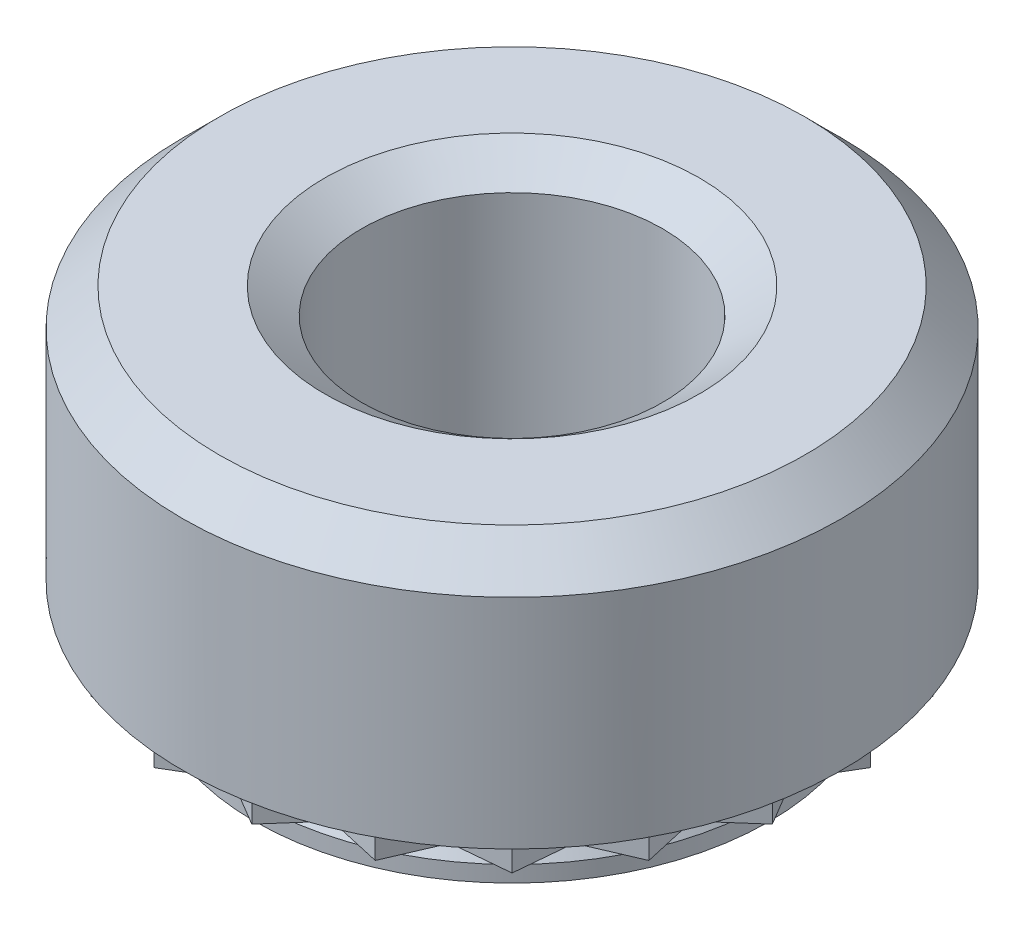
ISO-10303-21;
HEADER;
FILE_DESCRIPTION(('STEP AP214'),'2;1');
FILE_NAME('part.step','',(''),(''),'','','');
FILE_SCHEMA(('AUTOMOTIVE_DESIGN { 1 0 10303 214 1 1 1 1 }'));
ENDSEC;
DATA;
#1=APPLICATION_CONTEXT('core data for automotive mechanical design processes');
#2=APPLICATION_PROTOCOL_DEFINITION('international standard','automotive_design',2000,#1);
#3=PRODUCT_CONTEXT('',#1,'mechanical');
#4=PRODUCT('Part','Part','',(#3));
#5=PRODUCT_RELATED_PRODUCT_CATEGORY('part','',(#4));
#6=PRODUCT_DEFINITION_FORMATION('','',#4);
#7=PRODUCT_DEFINITION_CONTEXT('part definition',#1,'design');
#8=PRODUCT_DEFINITION('design','',#6,#7);
#9=PRODUCT_DEFINITION_SHAPE('','',#8);
#10=(LENGTH_UNIT() NAMED_UNIT(*) SI_UNIT(.MILLI.,.METRE.));
#11=(NAMED_UNIT(*) PLANE_ANGLE_UNIT() SI_UNIT($,.RADIAN.));
#12=(NAMED_UNIT(*) SI_UNIT($,.STERADIAN.) SOLID_ANGLE_UNIT());
#13=UNCERTAINTY_MEASURE_WITH_UNIT(LENGTH_MEASURE(1.E-05),#10,'distance_accuracy_value','');
#14=(GEOMETRIC_REPRESENTATION_CONTEXT(3) GLOBAL_UNCERTAINTY_ASSIGNED_CONTEXT((#13)) GLOBAL_UNIT_ASSIGNED_CONTEXT((#10,
#11,#12)) REPRESENTATION_CONTEXT('',''));
#15=CARTESIAN_POINT('',(0.,0.,0.));
#16=DIRECTION('',(0.,0.,1.));
#17=DIRECTION('',(1.,0.,0.));
#18=AXIS2_PLACEMENT_3D('',#15,#16,#17);
#19=CARTESIAN_POINT('',(4.0393425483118,0.,0.));
#20=DIRECTION('',(0.,-1.,0.));
#21=DIRECTION('',(0.,0.,-1.));
#22=AXIS2_PLACEMENT_3D('',#19,#20,#21);
#23=PLANE('',#22);
#24=CARTESIAN_POINT('',(0.,0.,0.));
#25=DIRECTION('',(0.,-1.,0.));
#26=DIRECTION('',(0.,0.,-1.));
#27=AXIS2_PLACEMENT_3D('',#24,#25,#26);
#28=CIRCLE('',#27,5.588);
#29=CARTESIAN_POINT('',(0.,0.,-5.588));
#30=VERTEX_POINT('',#29);
#31=EDGE_CURVE('E177',#30,#30,#28,.T.);
#32=ORIENTED_EDGE('',*,*,#31,.T.);
#33=EDGE_LOOP('',(#32));
#34=FACE_BOUND('',#33,.T.);
#35=DIRECTION('',(-0.859689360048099,0.,-0.510817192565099));
#36=VECTOR('',#35,1.);
#37=CARTESIAN_POINT('',(0.830448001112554,0.,5.24324232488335));
#38=LINE('',#37,#36);
#39=CARTESIAN_POINT('',(0.830448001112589,0.,5.24324232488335));
#40=VERTEX_POINT('',#39);
#41=CARTESIAN_POINT('',(0.,0.,4.7498));
#42=VERTEX_POINT('',#41);
#43=EDGE_CURVE('E69',#40,#42,#38,.T.);
#44=ORIENTED_EDGE('',*,*,#43,.F.);
#45=DIRECTION('',(-0.659761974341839,0.,0.75147464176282));
#46=VECTOR('',#45,1.);
#47=CARTESIAN_POINT('',(1.46776891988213,0.,4.51732824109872));
#48=LINE('',#47,#46);
#49=CARTESIAN_POINT('',(1.46776891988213,0.,4.51732824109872));
#50=VERTEX_POINT('',#49);
#51=EDGE_CURVE('E610',#50,#40,#48,.T.);
#52=ORIENTED_EDGE('',*,*,#51,.F.);
#53=DIRECTION('',(-0.975464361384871,0.,-0.220157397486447));
#54=VECTOR('',#53,1.);
#55=CARTESIAN_POINT('',(2.41005396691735,0.,4.72999723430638));
#56=LINE('',#55,#54);
#57=CARTESIAN_POINT('',(2.41005396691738,0.,4.72999723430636));
#58=VERTEX_POINT('',#57);
#59=EDGE_CURVE('E612',#58,#50,#56,.T.);
#60=ORIENTED_EDGE('',*,*,#59,.F.);
#61=DIRECTION('',(-0.395252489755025,0.,0.918572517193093));
#62=VECTOR('',#61,1.);
#63=CARTESIAN_POINT('',(2.79186239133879,0.,3.84266891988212));
#64=LINE('',#63,#62);
#65=CARTESIAN_POINT('',(2.79186239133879,0.,3.84266891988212));
#66=VERTEX_POINT('',#65);
#67=EDGE_CURVE('E637',#66,#58,#64,.T.);
#68=ORIENTED_EDGE('',*,*,#67,.F.);
#69=DIRECTION('',(-0.995754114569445,0.,0.092052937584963));
#70=VECTOR('',#69,1.);
#71=CARTESIAN_POINT('',(3.7537470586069,0.,3.75374705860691));
#72=LINE('',#71,#70);
#73=CARTESIAN_POINT('',(3.75374705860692,0.,3.75374705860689));
#74=VERTEX_POINT('',#73);
#75=EDGE_CURVE('E640',#74,#66,#72,.T.);
#76=ORIENTED_EDGE('',*,*,#75,.F.);
#77=DIRECTION('',(-0.0920529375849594,0.,0.995754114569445));
#78=VECTOR('',#77,1.);
#79=CARTESIAN_POINT('',(3.84266891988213,0.,2.79186239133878));
#80=LINE('',#79,#78);
#81=CARTESIAN_POINT('',(3.84266891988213,0.,2.79186239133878));
#82=VERTEX_POINT('',#81);
#83=EDGE_CURVE('E671',#82,#74,#80,.T.);
#84=ORIENTED_EDGE('',*,*,#83,.F.);
#85=DIRECTION('',(-0.918572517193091,0.,0.395252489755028));
#86=VECTOR('',#85,1.);
#87=CARTESIAN_POINT('',(4.72999723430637,0.,2.41005396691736));
#88=LINE('',#87,#86);
#89=CARTESIAN_POINT('',(4.72999723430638,0.,2.41005396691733));
#90=VERTEX_POINT('',#89);
#91=EDGE_CURVE('E674',#90,#82,#88,.T.);
#92=ORIENTED_EDGE('',*,*,#91,.F.);
#93=DIRECTION('',(0.220157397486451,0.,0.97546436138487));
#94=VECTOR('',#93,1.);
#95=CARTESIAN_POINT('',(4.51732824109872,0.,1.46776891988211));
#96=LINE('',#95,#94);
#97=CARTESIAN_POINT('',(4.51732824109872,0.,1.46776891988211));
#98=VERTEX_POINT('',#97);
#99=EDGE_CURVE('E707',#98,#90,#96,.T.);
#100=ORIENTED_EDGE('',*,*,#99,.F.);
#101=DIRECTION('',(-0.751474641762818,0.,0.659761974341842));
#102=VECTOR('',#101,1.);
#103=CARTESIAN_POINT('',(5.24324232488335,0.,0.83044800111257));
#104=LINE('',#103,#102);
#105=CARTESIAN_POINT('',(5.24324232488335,0.,0.830448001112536));
#106=VERTEX_POINT('',#105);
#107=EDGE_CURVE('E710',#106,#98,#104,.T.);
#108=ORIENTED_EDGE('',*,*,#107,.F.);
#109=DIRECTION('',(0.510817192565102,0.,0.859689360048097));
#110=VECTOR('',#109,1.);
#111=CARTESIAN_POINT('',(4.7498,0.,0.));
#112=LINE('',#111,#110);
#113=CARTESIAN_POINT('',(4.7498,0.,0.));
#114=VERTEX_POINT('',#113);
#115=EDGE_CURVE('E743',#114,#106,#112,.T.);
#116=ORIENTED_EDGE('',*,*,#115,.F.);
#117=DIRECTION('',(-0.510817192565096,0.,0.859689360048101));
#118=VECTOR('',#117,1.);
#119=CARTESIAN_POINT('',(5.24324232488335,0.,-0.830448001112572));
#120=LINE('',#119,#118);
#121=CARTESIAN_POINT('',(5.24324232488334,0.,-0.830448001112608));
#122=VERTEX_POINT('',#121);
#123=EDGE_CURVE('E746',#122,#114,#120,.T.);
#124=ORIENTED_EDGE('',*,*,#123,.F.);
#125=DIRECTION('',(0.751474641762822,0.,0.659761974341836));
#126=VECTOR('',#125,1.);
#127=CARTESIAN_POINT('',(4.51732824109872,0.,-1.46776891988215));
#128=LINE('',#127,#126);
#129=CARTESIAN_POINT('',(4.51732824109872,0.,-1.46776891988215));
#130=VERTEX_POINT('',#129);
#131=EDGE_CURVE('E779',#130,#122,#128,.T.);
#132=ORIENTED_EDGE('',*,*,#131,.F.);
#133=DIRECTION('',(-0.220157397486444,0.,0.975464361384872));
#134=VECTOR('',#133,1.);
#135=CARTESIAN_POINT('',(4.72999723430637,0.,-2.41005396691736));
#136=LINE('',#135,#134);
#137=CARTESIAN_POINT('',(4.72999723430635,0.,-2.41005396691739));
#138=VERTEX_POINT('',#137);
#139=EDGE_CURVE('E782',#138,#130,#136,.T.);
#140=ORIENTED_EDGE('',*,*,#139,.F.);
#141=DIRECTION('',(0.918572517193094,0.,0.395252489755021));
#142=VECTOR('',#141,1.);
#143=CARTESIAN_POINT('',(3.84266891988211,0.,-2.79186239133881));
#144=LINE('',#143,#142);
#145=CARTESIAN_POINT('',(3.84266891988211,0.,-2.79186239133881));
#146=VERTEX_POINT('',#145);
#147=EDGE_CURVE('E815',#146,#138,#144,.T.);
#148=ORIENTED_EDGE('',*,*,#147,.F.);
#149=DIRECTION('',(0.0920529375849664,0.,0.995754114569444));
#150=VECTOR('',#149,1.);
#151=CARTESIAN_POINT('',(3.7537470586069,0.,-3.75374705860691));
#152=LINE('',#151,#150);
#153=CARTESIAN_POINT('',(3.75374705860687,0.,-3.75374705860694));
#154=VERTEX_POINT('',#153);
#155=EDGE_CURVE('E818',#154,#146,#152,.T.);
#156=ORIENTED_EDGE('',*,*,#155,.F.);
#157=DIRECTION('',(0.995754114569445,0.,0.092052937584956));
#158=VECTOR('',#157,1.);
#159=CARTESIAN_POINT('',(2.79186239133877,0.,-3.84266891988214));
#160=LINE('',#159,#158);
#161=CARTESIAN_POINT('',(2.79186239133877,0.,-3.84266891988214));
#162=VERTEX_POINT('',#161);
#163=EDGE_CURVE('E851',#162,#154,#160,.T.);
#164=ORIENTED_EDGE('',*,*,#163,.F.);
#165=DIRECTION('',(0.395252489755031,0.,0.91857251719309));
#166=VECTOR('',#165,1.);
#167=CARTESIAN_POINT('',(2.41005396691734,0.,-4.72999723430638));
#168=LINE('',#167,#166);
#169=CARTESIAN_POINT('',(2.41005396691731,0.,-4.72999723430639));
#170=VERTEX_POINT('',#169);
#171=EDGE_CURVE('E854',#170,#162,#168,.T.);
#172=ORIENTED_EDGE('',*,*,#171,.F.);
#173=DIRECTION('',(0.975464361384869,0.,-0.220157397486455));
#174=VECTOR('',#173,1.);
#175=CARTESIAN_POINT('',(1.4677689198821,0.,-4.51732824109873));
#176=LINE('',#175,#174);
#177=CARTESIAN_POINT('',(1.4677689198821,0.,-4.51732824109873));
#178=VERTEX_POINT('',#177);
#179=EDGE_CURVE('E887',#178,#170,#176,.T.);
#180=ORIENTED_EDGE('',*,*,#179,.F.);
#181=DIRECTION('',(0.659761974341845,0.,0.751474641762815));
#182=VECTOR('',#181,1.);
#183=CARTESIAN_POINT('',(0.83044800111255,0.,-5.24324232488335));
#184=LINE('',#183,#182);
#185=CARTESIAN_POINT('',(0.830448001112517,0.,-5.24324232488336));
#186=VERTEX_POINT('',#185);
#187=EDGE_CURVE('E890',#186,#178,#184,.T.);
#188=ORIENTED_EDGE('',*,*,#187,.F.);
#189=DIRECTION('',(0.859689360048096,0.,-0.510817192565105));
#190=VECTOR('',#189,1.);
#191=CARTESIAN_POINT('',(0.,0.,-4.7498));
#192=LINE('',#191,#190);
#193=CARTESIAN_POINT('',(0.,0.,-4.7498));
#194=VERTEX_POINT('',#193);
#195=EDGE_CURVE('E923',#194,#186,#192,.T.);
#196=ORIENTED_EDGE('',*,*,#195,.F.);
#197=DIRECTION('',(0.859689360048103,0.,0.510817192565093));
#198=VECTOR('',#197,1.);
#199=CARTESIAN_POINT('',(-0.830448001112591,0.,-5.24324232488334));
#200=LINE('',#199,#198);
#201=CARTESIAN_POINT('',(-0.830448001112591,0.,-5.24324232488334));
#202=VERTEX_POINT('',#201);
#203=EDGE_CURVE('E926',#202,#194,#200,.T.);
#204=ORIENTED_EDGE('',*,*,#203,.F.);
#205=DIRECTION('',(0.659761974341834,0.,-0.751474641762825));
#206=VECTOR('',#205,1.);
#207=CARTESIAN_POINT('',(-1.46776891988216,0.,-4.51732824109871));
#208=LINE('',#207,#206);
#209=CARTESIAN_POINT('',(-1.46776891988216,0.,-4.51732824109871));
#210=VERTEX_POINT('',#209);
#211=EDGE_CURVE('E959',#210,#202,#208,.T.);
#212=ORIENTED_EDGE('',*,*,#211,.F.);
#213=DIRECTION('',(0.975464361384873,0.,0.22015739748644));
#214=VECTOR('',#213,1.);
#215=CARTESIAN_POINT('',(-2.41005396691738,0.,-4.72999723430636));
#216=LINE('',#215,#214);
#217=CARTESIAN_POINT('',(-2.41005396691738,0.,-4.72999723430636));
#218=VERTEX_POINT('',#217);
#219=EDGE_CURVE('E962',#218,#210,#216,.T.);
#220=ORIENTED_EDGE('',*,*,#219,.F.);
#221=DIRECTION('',(0.395252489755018,0.,-0.918572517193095));
#222=VECTOR('',#221,1.);
#223=CARTESIAN_POINT('',(-2.79186239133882,0.,-3.8426689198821));
#224=LINE('',#223,#222);
#225=CARTESIAN_POINT('',(-2.79186239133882,0.,-3.8426689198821));
#226=VERTEX_POINT('',#225);
#227=EDGE_CURVE('E995',#226,#218,#224,.T.);
#228=ORIENTED_EDGE('',*,*,#227,.F.);
#229=DIRECTION('',(0.995754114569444,0.,-0.0920529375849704));
#230=VECTOR('',#229,1.);
#231=CARTESIAN_POINT('',(-3.75374705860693,0.,-3.75374705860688));
#232=LINE('',#231,#230);
#233=CARTESIAN_POINT('',(-3.75374705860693,0.,-3.75374705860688));
#234=VERTEX_POINT('',#233);
#235=EDGE_CURVE('E998',#234,#226,#232,.T.);
#236=ORIENTED_EDGE('',*,*,#235,.F.);
#237=DIRECTION('',(0.092052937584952,0.,-0.995754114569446));
#238=VECTOR('',#237,1.);
#239=CARTESIAN_POINT('',(-3.84266891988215,0.,-2.79186239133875));
#240=LINE('',#239,#238);
#241=CARTESIAN_POINT('',(-3.84266891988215,0.,-2.79186239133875));
#242=VERTEX_POINT('',#241);
#243=EDGE_CURVE('E1031',#242,#234,#240,.T.);
#244=ORIENTED_EDGE('',*,*,#243,.F.);
#245=DIRECTION('',(0.918572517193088,0.,-0.395252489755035));
#246=VECTOR('',#245,1.);
#247=CARTESIAN_POINT('',(-4.72999723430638,0.,-2.41005396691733));
#248=LINE('',#247,#246);
#249=CARTESIAN_POINT('',(-4.72999723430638,0.,-2.41005396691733));
#250=VERTEX_POINT('',#249);
#251=EDGE_CURVE('E1034',#250,#242,#248,.T.);
#252=ORIENTED_EDGE('',*,*,#251,.F.);
#253=DIRECTION('',(-0.220157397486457,0.,-0.975464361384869));
#254=VECTOR('',#253,1.);
#255=CARTESIAN_POINT('',(-4.51732824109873,0.,-1.46776891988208));
#256=LINE('',#255,#254);
#257=CARTESIAN_POINT('',(-4.51732824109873,0.,-1.46776891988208));
#258=VERTEX_POINT('',#257);
#259=EDGE_CURVE('E1067',#258,#250,#256,.T.);
#260=ORIENTED_EDGE('',*,*,#259,.F.);
#261=DIRECTION('',(0.751474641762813,0.,-0.659761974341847));
#262=VECTOR('',#261,1.);
#263=CARTESIAN_POINT('',(-5.24324232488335,0.,-0.830448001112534));
#264=LINE('',#263,#262);
#265=CARTESIAN_POINT('',(-5.24324232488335,0.,-0.830448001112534));
#266=VERTEX_POINT('',#265);
#267=EDGE_CURVE('E1070',#266,#258,#264,.T.);
#268=ORIENTED_EDGE('',*,*,#267,.F.);
#269=DIRECTION('',(-0.510817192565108,0.,-0.859689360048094));
#270=VECTOR('',#269,1.);
#271=CARTESIAN_POINT('',(-4.7498,0.,0.));
#272=LINE('',#271,#270);
#273=CARTESIAN_POINT('',(-4.7498,0.,0.));
#274=VERTEX_POINT('',#273);
#275=EDGE_CURVE('E1103',#274,#266,#272,.T.);
#276=ORIENTED_EDGE('',*,*,#275,.F.);
#277=DIRECTION('',(0.51081719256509,0.,-0.859689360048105));
#278=VECTOR('',#277,1.);
#279=CARTESIAN_POINT('',(-5.24324232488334,0.,0.830448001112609));
#280=LINE('',#279,#278);
#281=CARTESIAN_POINT('',(-5.24324232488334,0.,0.830448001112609));
#282=VERTEX_POINT('',#281);
#283=EDGE_CURVE('E1106',#282,#274,#280,.T.);
#284=ORIENTED_EDGE('',*,*,#283,.F.);
#285=DIRECTION('',(-0.751474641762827,0.,-0.659761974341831));
#286=VECTOR('',#285,1.);
#287=CARTESIAN_POINT('',(-4.5173282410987,0.,1.46776891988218));
#288=LINE('',#287,#286);
#289=CARTESIAN_POINT('',(-4.5173282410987,0.,1.46776891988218));
#290=VERTEX_POINT('',#289);
#291=EDGE_CURVE('E1139',#290,#282,#288,.T.);
#292=ORIENTED_EDGE('',*,*,#291,.F.);
#293=DIRECTION('',(0.220157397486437,0.,-0.975464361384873));
#294=VECTOR('',#293,1.);
#295=CARTESIAN_POINT('',(-4.72999723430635,0.,2.4100539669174));
#296=LINE('',#295,#294);
#297=CARTESIAN_POINT('',(-4.72999723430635,0.,2.4100539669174));
#298=VERTEX_POINT('',#297);
#299=EDGE_CURVE('E1142',#298,#290,#296,.T.);
#300=ORIENTED_EDGE('',*,*,#299,.F.);
#301=DIRECTION('',(-0.918572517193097,0.,-0.395252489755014));
#302=VECTOR('',#301,1.);
#303=CARTESIAN_POINT('',(-3.84266891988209,0.,2.79186239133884));
#304=LINE('',#303,#302);
#305=CARTESIAN_POINT('',(-3.84266891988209,0.,2.79186239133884));
#306=VERTEX_POINT('',#305);
#307=EDGE_CURVE('E1175',#306,#298,#304,.T.);
#308=ORIENTED_EDGE('',*,*,#307,.F.);
#309=DIRECTION('',(-0.0920529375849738,0.,-0.995754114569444));
#310=VECTOR('',#309,1.);
#311=CARTESIAN_POINT('',(-3.75374705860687,0.,3.75374705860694));
#312=LINE('',#311,#310);
#313=CARTESIAN_POINT('',(-3.75374705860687,0.,3.75374705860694));
#314=VERTEX_POINT('',#313);
#315=EDGE_CURVE('E1178',#314,#306,#312,.T.);
#316=ORIENTED_EDGE('',*,*,#315,.F.);
#317=DIRECTION('',(-0.995754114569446,0.,-0.0920529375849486));
#318=VECTOR('',#317,1.);
#319=CARTESIAN_POINT('',(-2.79186239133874,0.,3.84266891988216));
#320=LINE('',#319,#318);
#321=CARTESIAN_POINT('',(-2.79186239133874,0.,3.84266891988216));
#322=VERTEX_POINT('',#321);
#323=EDGE_CURVE('E1211',#322,#314,#320,.T.);
#324=ORIENTED_EDGE('',*,*,#323,.F.);
#325=DIRECTION('',(-0.395252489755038,0.,-0.918572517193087));
#326=VECTOR('',#325,1.);
#327=CARTESIAN_POINT('',(-2.41005396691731,0.,4.72999723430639));
#328=LINE('',#327,#326);
#329=CARTESIAN_POINT('',(-2.41005396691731,0.,4.72999723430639));
#330=VERTEX_POINT('',#329);
#331=EDGE_CURVE('E1214',#330,#322,#328,.T.);
#332=ORIENTED_EDGE('',*,*,#331,.F.);
#333=DIRECTION('',(-0.975464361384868,0.,0.220157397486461));
#334=VECTOR('',#333,1.);
#335=CARTESIAN_POINT('',(-1.46776891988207,0.,4.51732824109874));
#336=LINE('',#335,#334);
#337=CARTESIAN_POINT('',(-1.46776891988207,0.,4.51732824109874));
#338=VERTEX_POINT('',#337);
#339=EDGE_CURVE('E1234',#338,#330,#336,.T.);
#340=ORIENTED_EDGE('',*,*,#339,.F.);
#341=DIRECTION('',(-0.659761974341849,0.,-0.751474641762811));
#342=VECTOR('',#341,1.);
#343=CARTESIAN_POINT('',(-0.830448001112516,0.,5.24324232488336));
#344=LINE('',#343,#342);
#345=CARTESIAN_POINT('',(-0.830448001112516,0.,5.24324232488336));
#346=VERTEX_POINT('',#345);
#347=EDGE_CURVE('E1237',#346,#338,#344,.T.);
#348=ORIENTED_EDGE('',*,*,#347,.F.);
#349=DIRECTION('',(-0.859689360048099,0.,0.510817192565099));
#350=VECTOR('',#349,1.);
#351=CARTESIAN_POINT('',(0.,0.,4.7498));
#352=LINE('',#351,#350);
#353=EDGE_CURVE('E588',#42,#346,#352,.T.);
#354=ORIENTED_EDGE('',*,*,#353,.F.);
#355=EDGE_LOOP('',(#44,#52,#60,#68,#76,#84,#92,#100,#108,#116,#124,#132,#140,#148,#156,#164,
#172,#180,#188,#196,#204,#212,#220,#228,#236,#244,#252,#260,#268,#276,#284,#292,#300,#308,#316,
#324,#332,#340,#348,#354));
#356=FACE_BOUND('',#355,.T.);
#357=ADVANCED_FACE('F32',(#34,#356),#23,.T.);
#358=CARTESIAN_POINT('',(0.,0.,0.));
#359=DIRECTION('',(0.,-1.,0.));
#360=DIRECTION('',(0.,0.,-1.));
#361=AXIS2_PLACEMENT_3D('',#358,#359,#360);
#362=CIRCLE('',#361,4.0393425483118);
#363=CARTESIAN_POINT('',(0.,0.,-4.0393425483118));
#364=VERTEX_POINT('',#363);
#365=EDGE_CURVE('E174',#364,#364,#362,.T.);
#366=ORIENTED_EDGE('',*,*,#365,.F.);
#367=EDGE_LOOP('',(#366));
#368=FACE_BOUND('',#367,.T.);
#369=DIRECTION('',(0.975464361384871,0.,0.220157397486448));
#370=VECTOR('',#369,1.);
#371=CARTESIAN_POINT('',(1.40905816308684,0.,4.33663511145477));
#372=LINE('',#371,#370);
#373=CARTESIAN_POINT('',(1.40905816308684,0.,4.33663511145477));
#374=VERTEX_POINT('',#373);
#375=CARTESIAN_POINT('',(2.31365180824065,0.,4.54079734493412));
#376=VERTEX_POINT('',#375);
#377=EDGE_CURVE('E103',#374,#376,#372,.T.);
#378=ORIENTED_EDGE('',*,*,#377,.F.);
#379=DIRECTION('',(0.659761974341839,0.,-0.75147464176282));
#380=VECTOR('',#379,1.);
#381=CARTESIAN_POINT('',(0.797230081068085,0.,5.03351263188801));
#382=LINE('',#381,#380);
#383=CARTESIAN_POINT('',(0.797230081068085,0.,5.03351263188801));
#384=VERTEX_POINT('',#383);
#385=EDGE_CURVE('E608',#384,#374,#382,.T.);
#386=ORIENTED_EDGE('',*,*,#385,.F.);
#387=DIRECTION('',(0.859689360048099,0.,0.510817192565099));
#388=VECTOR('',#387,1.);
#389=CARTESIAN_POINT('',(0.,0.,4.559808));
#390=LINE('',#389,#388);
#391=CARTESIAN_POINT('',(0.,0.,4.559808));
#392=VERTEX_POINT('',#391);
#393=EDGE_CURVE('E137',#392,#384,#390,.T.);
#394=ORIENTED_EDGE('',*,*,#393,.F.);
#395=DIRECTION('',(0.859689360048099,0.,-0.510817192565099));
#396=VECTOR('',#395,1.);
#397=CARTESIAN_POINT('',(-0.797230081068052,0.,5.03351263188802));
#398=LINE('',#397,#396);
#399=CARTESIAN_POINT('',(-0.797230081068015,0.,5.03351263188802));
#400=VERTEX_POINT('',#399);
#401=EDGE_CURVE('E587',#400,#392,#398,.T.);
#402=ORIENTED_EDGE('',*,*,#401,.F.);
#403=DIRECTION('',(0.659761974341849,0.,0.751474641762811));
#404=VECTOR('',#403,1.);
#405=CARTESIAN_POINT('',(-1.40905816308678,0.,4.33663511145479));
#406=LINE('',#405,#404);
#407=CARTESIAN_POINT('',(-1.40905816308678,0.,4.33663511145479));
#408=VERTEX_POINT('',#407);
#409=EDGE_CURVE('E574',#408,#400,#406,.T.);
#410=ORIENTED_EDGE('',*,*,#409,.F.);
#411=DIRECTION('',(0.975464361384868,0.,-0.220157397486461));
#412=VECTOR('',#411,1.);
#413=CARTESIAN_POINT('',(-2.31365180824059,0.,4.54079734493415));
#414=LINE('',#413,#412);
#415=CARTESIAN_POINT('',(-2.31365180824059,0.,4.54079734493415));
#416=VERTEX_POINT('',#415);
#417=EDGE_CURVE('E585',#416,#408,#414,.T.);
#418=ORIENTED_EDGE('',*,*,#417,.F.);
#419=DIRECTION('',(0.395252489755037,0.,0.918572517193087));
#420=VECTOR('',#419,1.);
#421=CARTESIAN_POINT('',(-2.68018789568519,0.,3.68896216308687));
#422=LINE('',#421,#420);
#423=CARTESIAN_POINT('',(-2.68018789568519,0.,3.68896216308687));
#424=VERTEX_POINT('',#423);
#425=EDGE_CURVE('E1204',#424,#416,#422,.T.);
#426=ORIENTED_EDGE('',*,*,#425,.F.);
#427=DIRECTION('',(0.995754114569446,0.,0.0920529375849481));
#428=VECTOR('',#427,1.);
#429=CARTESIAN_POINT('',(-3.60359717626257,0.,3.60359717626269));
#430=LINE('',#429,#428);
#431=CARTESIAN_POINT('',(-3.60359717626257,0.,3.60359717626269));
#432=VERTEX_POINT('',#431);
#433=EDGE_CURVE('E1208',#432,#424,#430,.T.);
#434=ORIENTED_EDGE('',*,*,#433,.F.);
#435=DIRECTION('',(0.0920529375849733,0.,0.995754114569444));
#436=VECTOR('',#435,1.);
#437=CARTESIAN_POINT('',(-3.68896216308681,0.,2.68018789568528));
#438=LINE('',#437,#436);
#439=CARTESIAN_POINT('',(-3.68896216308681,0.,2.68018789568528));
#440=VERTEX_POINT('',#439);
#441=EDGE_CURVE('E1168',#440,#432,#438,.T.);
#442=ORIENTED_EDGE('',*,*,#441,.F.);
#443=DIRECTION('',(0.918572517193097,0.,0.395252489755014));
#444=VECTOR('',#443,1.);
#445=CARTESIAN_POINT('',(-4.54079734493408,0.,2.31365180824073));
#446=LINE('',#445,#444);
#447=CARTESIAN_POINT('',(-4.54079734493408,0.,2.31365180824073));
#448=VERTEX_POINT('',#447);
#449=EDGE_CURVE('E1172',#448,#440,#446,.T.);
#450=ORIENTED_EDGE('',*,*,#449,.F.);
#451=DIRECTION('',(-0.220157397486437,0.,0.975464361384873));
#452=VECTOR('',#451,1.);
#453=CARTESIAN_POINT('',(-4.33663511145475,0.,1.40905816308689));
#454=LINE('',#453,#452);
#455=CARTESIAN_POINT('',(-4.33663511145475,0.,1.40905816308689));
#456=VERTEX_POINT('',#455);
#457=EDGE_CURVE('E1132',#456,#448,#454,.T.);
#458=ORIENTED_EDGE('',*,*,#457,.F.);
#459=DIRECTION('',(0.751474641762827,0.,0.659761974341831));
#460=VECTOR('',#459,1.);
#461=CARTESIAN_POINT('',(-5.033512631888,0.,0.797230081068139));
#462=LINE('',#461,#460);
#463=CARTESIAN_POINT('',(-5.033512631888,0.,0.797230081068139));
#464=VERTEX_POINT('',#463);
#465=EDGE_CURVE('E1136',#464,#456,#462,.T.);
#466=ORIENTED_EDGE('',*,*,#465,.F.);
#467=DIRECTION('',(-0.510817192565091,0.,0.859689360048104));
#468=VECTOR('',#467,1.);
#469=CARTESIAN_POINT('',(-4.559808,0.,0.));
#470=LINE('',#469,#468);
#471=CARTESIAN_POINT('',(-4.559808,0.,0.));
#472=VERTEX_POINT('',#471);
#473=EDGE_CURVE('E1096',#472,#464,#470,.T.);
#474=ORIENTED_EDGE('',*,*,#473,.F.);
#475=DIRECTION('',(0.510817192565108,0.,0.859689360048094));
#476=VECTOR('',#475,1.);
#477=CARTESIAN_POINT('',(-5.03351263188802,0.,-0.797230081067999));
#478=LINE('',#477,#476);
#479=CARTESIAN_POINT('',(-5.03351263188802,0.,-0.797230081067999));
#480=VERTEX_POINT('',#479);
#481=EDGE_CURVE('E1100',#480,#472,#478,.T.);
#482=ORIENTED_EDGE('',*,*,#481,.F.);
#483=DIRECTION('',(-0.751474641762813,0.,0.659761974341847));
#484=VECTOR('',#483,1.);
#485=CARTESIAN_POINT('',(-4.33663511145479,0.,-1.4090581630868));
#486=LINE('',#485,#484);
#487=CARTESIAN_POINT('',(-4.33663511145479,0.,-1.4090581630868));
#488=VERTEX_POINT('',#487);
#489=EDGE_CURVE('E1060',#488,#480,#486,.T.);
#490=ORIENTED_EDGE('',*,*,#489,.F.);
#491=DIRECTION('',(0.220157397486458,0.,0.975464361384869));
#492=VECTOR('',#491,1.);
#493=CARTESIAN_POINT('',(-4.54079734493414,0.,-2.31365180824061));
#494=LINE('',#493,#492);
#495=CARTESIAN_POINT('',(-4.54079734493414,0.,-2.31365180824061));
#496=VERTEX_POINT('',#495);
#497=EDGE_CURVE('E1064',#496,#488,#494,.T.);
#498=ORIENTED_EDGE('',*,*,#497,.F.);
#499=DIRECTION('',(-0.918572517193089,0.,0.395252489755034));
#500=VECTOR('',#499,1.);
#501=CARTESIAN_POINT('',(-3.68896216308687,0.,-2.6801878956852));
#502=LINE('',#501,#500);
#503=CARTESIAN_POINT('',(-3.68896216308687,0.,-2.6801878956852));
#504=VERTEX_POINT('',#503);
#505=EDGE_CURVE('E1024',#504,#496,#502,.T.);
#506=ORIENTED_EDGE('',*,*,#505,.F.);
#507=DIRECTION('',(-0.0920529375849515,0.,0.995754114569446));
#508=VECTOR('',#507,1.);
#509=CARTESIAN_POINT('',(-3.60359717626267,0.,-3.60359717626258));
#510=LINE('',#509,#508);
#511=CARTESIAN_POINT('',(-3.60359717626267,0.,-3.60359717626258));
#512=VERTEX_POINT('',#511);
#513=EDGE_CURVE('E1028',#512,#504,#510,.T.);
#514=ORIENTED_EDGE('',*,*,#513,.F.);
#515=DIRECTION('',(-0.995754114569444,0.,0.09205293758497));
#516=VECTOR('',#515,1.);
#517=CARTESIAN_POINT('',(-2.68018789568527,0.,-3.68896216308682));
#518=LINE('',#517,#516);
#519=CARTESIAN_POINT('',(-2.68018789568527,0.,-3.68896216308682));
#520=VERTEX_POINT('',#519);
#521=EDGE_CURVE('E988',#520,#512,#518,.T.);
#522=ORIENTED_EDGE('',*,*,#521,.F.);
#523=DIRECTION('',(-0.395252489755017,0.,0.918572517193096));
#524=VECTOR('',#523,1.);
#525=CARTESIAN_POINT('',(-2.31365180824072,0.,-4.54079734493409));
#526=LINE('',#525,#524);
#527=CARTESIAN_POINT('',(-2.31365180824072,0.,-4.54079734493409));
#528=VERTEX_POINT('',#527);
#529=EDGE_CURVE('E992',#528,#520,#526,.T.);
#530=ORIENTED_EDGE('',*,*,#529,.F.);
#531=DIRECTION('',(-0.975464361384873,0.,-0.220157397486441));
#532=VECTOR('',#531,1.);
#533=CARTESIAN_POINT('',(-1.40905816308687,0.,-4.33663511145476));
#534=LINE('',#533,#532);
#535=CARTESIAN_POINT('',(-1.40905816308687,0.,-4.33663511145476));
#536=VERTEX_POINT('',#535);
#537=EDGE_CURVE('E952',#536,#528,#534,.T.);
#538=ORIENTED_EDGE('',*,*,#537,.F.);
#539=DIRECTION('',(-0.659761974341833,0.,0.751474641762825));
#540=VECTOR('',#539,1.);
#541=CARTESIAN_POINT('',(-0.797230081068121,0.,-5.033512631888));
#542=LINE('',#541,#540);
#543=CARTESIAN_POINT('',(-0.797230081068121,0.,-5.033512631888));
#544=VERTEX_POINT('',#543);
#545=EDGE_CURVE('E956',#544,#536,#542,.T.);
#546=ORIENTED_EDGE('',*,*,#545,.F.);
#547=DIRECTION('',(-0.859689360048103,0.,-0.510817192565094));
#548=VECTOR('',#547,1.);
#549=CARTESIAN_POINT('',(0.,0.,-4.559808));
#550=LINE('',#549,#548);
#551=CARTESIAN_POINT('',(0.,0.,-4.559808));
#552=VERTEX_POINT('',#551);
#553=EDGE_CURVE('E916',#552,#544,#550,.T.);
#554=ORIENTED_EDGE('',*,*,#553,.F.);
#555=DIRECTION('',(-0.859689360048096,0.,0.510817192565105));
#556=VECTOR('',#555,1.);
#557=CARTESIAN_POINT('',(0.797230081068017,0.,-5.03351263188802));
#558=LINE('',#557,#556);
#559=CARTESIAN_POINT('',(0.797230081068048,0.,-5.03351263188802));
#560=VERTEX_POINT('',#559);
#561=EDGE_CURVE('E920',#560,#552,#558,.T.);
#562=ORIENTED_EDGE('',*,*,#561,.F.);
#563=DIRECTION('',(-0.659761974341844,0.,-0.751474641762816));
#564=VECTOR('',#563,1.);
#565=CARTESIAN_POINT('',(1.40905816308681,0.,-4.33663511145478));
#566=LINE('',#565,#564);
#567=CARTESIAN_POINT('',(1.40905816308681,0.,-4.33663511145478));
#568=VERTEX_POINT('',#567);
#569=EDGE_CURVE('E880',#568,#560,#566,.T.);
#570=ORIENTED_EDGE('',*,*,#569,.F.);
#571=DIRECTION('',(-0.975464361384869,0.,0.220157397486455));
#572=VECTOR('',#571,1.);
#573=CARTESIAN_POINT('',(2.31365180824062,0.,-4.54079734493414));
#574=LINE('',#573,#572);
#575=CARTESIAN_POINT('',(2.31365180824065,0.,-4.54079734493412));
#576=VERTEX_POINT('',#575);
#577=EDGE_CURVE('E884',#576,#568,#574,.T.);
#578=ORIENTED_EDGE('',*,*,#577,.F.);
#579=DIRECTION('',(-0.395252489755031,0.,-0.91857251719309));
#580=VECTOR('',#579,1.);
#581=CARTESIAN_POINT('',(2.68018789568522,0.,-3.68896216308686));
#582=LINE('',#581,#580);
#583=CARTESIAN_POINT('',(2.68018789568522,0.,-3.68896216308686));
#584=VERTEX_POINT('',#583);
#585=EDGE_CURVE('E844',#584,#576,#582,.T.);
#586=ORIENTED_EDGE('',*,*,#585,.F.);
#587=DIRECTION('',(-0.995754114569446,0.,-0.0920529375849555));
#588=VECTOR('',#587,1.);
#589=CARTESIAN_POINT('',(3.6035971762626,0.,-3.60359717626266));
#590=LINE('',#589,#588);
#591=CARTESIAN_POINT('',(3.60359717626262,0.,-3.60359717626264));
#592=VERTEX_POINT('',#591);
#593=EDGE_CURVE('E848',#592,#584,#590,.T.);
#594=ORIENTED_EDGE('',*,*,#593,.F.);
#595=DIRECTION('',(-0.092052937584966,0.,-0.995754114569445));
#596=VECTOR('',#595,1.);
#597=CARTESIAN_POINT('',(3.68896216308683,0.,-2.68018789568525));
#598=LINE('',#597,#596);
#599=CARTESIAN_POINT('',(3.68896216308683,0.,-2.68018789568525));
#600=VERTEX_POINT('',#599);
#601=EDGE_CURVE('E808',#600,#592,#598,.T.);
#602=ORIENTED_EDGE('',*,*,#601,.F.);
#603=DIRECTION('',(-0.918572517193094,0.,-0.395252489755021));
#604=VECTOR('',#603,1.);
#605=CARTESIAN_POINT('',(4.5407973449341,0.,-2.3136518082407));
#606=LINE('',#605,#604);
#607=CARTESIAN_POINT('',(4.54079734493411,0.,-2.31365180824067));
#608=VERTEX_POINT('',#607);
#609=EDGE_CURVE('E812',#608,#600,#606,.T.);
#610=ORIENTED_EDGE('',*,*,#609,.F.);
#611=DIRECTION('',(0.220157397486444,0.,-0.975464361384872));
#612=VECTOR('',#611,1.);
#613=CARTESIAN_POINT('',(4.33663511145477,0.,-1.40905816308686));
#614=LINE('',#613,#612);
#615=CARTESIAN_POINT('',(4.33663511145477,0.,-1.40905816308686));
#616=VERTEX_POINT('',#615);
#617=EDGE_CURVE('E772',#616,#608,#614,.T.);
#618=ORIENTED_EDGE('',*,*,#617,.F.);
#619=DIRECTION('',(-0.751474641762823,0.,-0.659761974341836));
#620=VECTOR('',#619,1.);
#621=CARTESIAN_POINT('',(5.03351263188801,0.,-0.797230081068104));
#622=LINE('',#621,#620);
#623=CARTESIAN_POINT('',(5.03351263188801,0.,-0.797230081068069));
#624=VERTEX_POINT('',#623);
#625=EDGE_CURVE('E776',#624,#616,#622,.T.);
#626=ORIENTED_EDGE('',*,*,#625,.F.);
#627=DIRECTION('',(0.510817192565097,0.,-0.859689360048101));
#628=VECTOR('',#627,1.);
#629=CARTESIAN_POINT('',(4.559808,0.,0.));
#630=LINE('',#629,#628);
#631=CARTESIAN_POINT('',(4.559808,0.,0.));
#632=VERTEX_POINT('',#631);
#633=EDGE_CURVE('E736',#632,#624,#630,.T.);
#634=ORIENTED_EDGE('',*,*,#633,.F.);
#635=DIRECTION('',(-0.510817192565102,0.,-0.859689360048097));
#636=VECTOR('',#635,1.);
#637=CARTESIAN_POINT('',(5.03351263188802,0.,0.797230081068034));
#638=LINE('',#637,#636);
#639=CARTESIAN_POINT('',(5.03351263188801,0.,0.797230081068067));
#640=VERTEX_POINT('',#639);
#641=EDGE_CURVE('E740',#640,#632,#638,.T.);
#642=ORIENTED_EDGE('',*,*,#641,.F.);
#643=DIRECTION('',(0.751474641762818,0.,-0.659761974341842));
#644=VECTOR('',#643,1.);
#645=CARTESIAN_POINT('',(4.33663511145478,0.,1.40905816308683));
#646=LINE('',#645,#644);
#647=CARTESIAN_POINT('',(4.33663511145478,0.,1.40905816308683));
#648=VERTEX_POINT('',#647);
#649=EDGE_CURVE('E700',#648,#640,#646,.T.);
#650=ORIENTED_EDGE('',*,*,#649,.F.);
#651=DIRECTION('',(-0.220157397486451,0.,-0.97546436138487));
#652=VECTOR('',#651,1.);
#653=CARTESIAN_POINT('',(4.54079734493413,0.,2.31365180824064));
#654=LINE('',#653,#652);
#655=CARTESIAN_POINT('',(4.54079734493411,0.,2.31365180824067));
#656=VERTEX_POINT('',#655);
#657=EDGE_CURVE('E704',#656,#648,#654,.T.);
#658=ORIENTED_EDGE('',*,*,#657,.F.);
#659=DIRECTION('',(0.918572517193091,0.,-0.395252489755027));
#660=VECTOR('',#659,1.);
#661=CARTESIAN_POINT('',(3.68896216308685,0.,2.68018789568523));
#662=LINE('',#661,#660);
#663=CARTESIAN_POINT('',(3.68896216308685,0.,2.68018789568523));
#664=VERTEX_POINT('',#663);
#665=EDGE_CURVE('E664',#664,#656,#662,.T.);
#666=ORIENTED_EDGE('',*,*,#665,.F.);
#667=DIRECTION('',(0.092052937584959,0.,-0.995754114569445));
#668=VECTOR('',#667,1.);
#669=CARTESIAN_POINT('',(3.60359717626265,0.,3.60359717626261));
#670=LINE('',#669,#668);
#671=CARTESIAN_POINT('',(3.60359717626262,0.,3.60359717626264));
#672=VERTEX_POINT('',#671);
#673=EDGE_CURVE('E668',#672,#664,#670,.T.);
#674=ORIENTED_EDGE('',*,*,#673,.F.);
#675=DIRECTION('',(0.995754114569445,0.,-0.0920529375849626));
#676=VECTOR('',#675,1.);
#677=CARTESIAN_POINT('',(2.68018789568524,0.,3.68896216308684));
#678=LINE('',#677,#676);
#679=CARTESIAN_POINT('',(2.68018789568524,0.,3.68896216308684));
#680=VERTEX_POINT('',#679);
#681=EDGE_CURVE('E630',#680,#672,#678,.T.);
#682=ORIENTED_EDGE('',*,*,#681,.F.);
#683=DIRECTION('',(0.395252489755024,0.,-0.918572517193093));
#684=VECTOR('',#683,1.);
#685=CARTESIAN_POINT('',(2.31365180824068,0.,4.5407973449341));
#686=LINE('',#685,#684);
#687=EDGE_CURVE('E634',#376,#680,#686,.T.);
#688=ORIENTED_EDGE('',*,*,#687,.F.);
#689=EDGE_LOOP('',(#378,#386,#394,#402,#410,#418,#426,#434,#442,#450,#458,#466,#474,#482,#490,
#498,#506,#514,#522,#530,#538,#546,#554,#562,#570,#578,#586,#594,#602,#610,#618,#626,#634,#642,
#650,#658,#666,#674,#682,#688));
#690=FACE_BOUND('',#689,.T.);
#691=ADVANCED_FACE('F202',(#368,#690),#23,.T.);
#692=CARTESIAN_POINT('',(0.,0.,0.));
#693=DIRECTION('',(0.,-1.,0.));
#694=DIRECTION('',(0.,0.,-1.));
#695=AXIS2_PLACEMENT_3D('',#692,#693,#694);
#696=CYLINDRICAL_SURFACE('',#695,5.588);
#697=CARTESIAN_POINT('',(0.,3.6957,0.));
#698=DIRECTION('',(0.,1.,0.));
#699=DIRECTION('',(0.,0.,1.));
#700=AXIS2_PLACEMENT_3D('',#697,#698,#699);
#701=CIRCLE('',#700,5.588);
#702=CARTESIAN_POINT('',(0.,3.6957,5.588));
#703=VERTEX_POINT('',#702);
#704=EDGE_CURVE('E41',#703,#703,#701,.F.);
#705=ORIENTED_EDGE('',*,*,#704,.T.);
#706=EDGE_LOOP('',(#705));
#707=FACE_BOUND('',#706,.T.);
#708=ORIENTED_EDGE('',*,*,#31,.F.);
#709=EDGE_LOOP('',(#708));
#710=FACE_BOUND('',#709,.T.);
#711=ADVANCED_FACE('F183',(#707,#710),#696,.T.);
#712=CARTESIAN_POINT('',(0.,0.,0.));
#713=DIRECTION('',(0.,-1.,0.));
#714=DIRECTION('',(0.,0.,-1.));
#715=AXIS2_PLACEMENT_3D('',#712,#713,#714);
#716=CYLINDRICAL_SURFACE('',#715,4.0393425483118);
#717=ORIENTED_EDGE('',*,*,#365,.T.);
#718=EDGE_LOOP('',(#717));
#719=FACE_BOUND('',#718,.T.);
#720=CARTESIAN_POINT('',(0.,-0.54864,0.));
#721=DIRECTION('',(0.,-1.,0.));
#722=DIRECTION('',(0.,0.,-1.));
#723=AXIS2_PLACEMENT_3D('',#720,#721,#722);
#724=CIRCLE('',#723,4.0393425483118);
#725=CARTESIAN_POINT('',(0.,-0.54864,-4.0393425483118));
#726=VERTEX_POINT('',#725);
#727=EDGE_CURVE('E171',#726,#726,#724,.T.);
#728=ORIENTED_EDGE('',*,*,#727,.F.);
#729=EDGE_LOOP('',(#728));
#730=FACE_BOUND('',#729,.T.);
#731=ADVANCED_FACE('F211',(#719,#730),#716,.T.);
#732=CARTESIAN_POINT('',(0.,-1.09728,0.));
#733=DIRECTION('',(0.,-1.,0.));
#734=DIRECTION('',(0.,0.,-1.));
#735=AXIS2_PLACEMENT_3D('',#732,#733,#734);
#736=CONICAL_SURFACE('',#735,4.3561,0.523598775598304);
#737=ORIENTED_EDGE('',*,*,#727,.T.);
#738=EDGE_LOOP('',(#737));
#739=FACE_BOUND('',#738,.T.);
#740=CARTESIAN_POINT('',(0.,-1.09728,0.));
#741=DIRECTION('',(0.,-1.,0.));
#742=DIRECTION('',(0.,0.,-1.));
#743=AXIS2_PLACEMENT_3D('',#740,#741,#742);
#744=CIRCLE('',#743,4.3561);
#745=CARTESIAN_POINT('',(0.,-1.09728,-4.3561));
#746=VERTEX_POINT('',#745);
#747=EDGE_CURVE('E168',#746,#746,#744,.T.);
#748=ORIENTED_EDGE('',*,*,#747,.F.);
#749=EDGE_LOOP('',(#748));
#750=FACE_BOUND('',#749,.T.);
#751=ADVANCED_FACE('F217',(#739,#750),#736,.T.);
#752=CARTESIAN_POINT('',(0.,0.,0.));
#753=DIRECTION('',(0.,-1.,0.));
#754=DIRECTION('',(0.,0.,-1.));
#755=AXIS2_PLACEMENT_3D('',#752,#753,#754);
#756=CYLINDRICAL_SURFACE('',#755,4.3561);
#757=ORIENTED_EDGE('',*,*,#747,.T.);
#758=EDGE_LOOP('',(#757));
#759=FACE_BOUND('',#758,.T.);
#760=CARTESIAN_POINT('',(0.,-1.3716,0.));
#761=DIRECTION('',(0.,-1.,0.));
#762=DIRECTION('',(0.,0.,-1.));
#763=AXIS2_PLACEMENT_3D('',#760,#761,#762);
#764=CIRCLE('',#763,4.3561);
#765=CARTESIAN_POINT('',(0.,-1.3716,-4.3561));
#766=VERTEX_POINT('',#765);
#767=EDGE_CURVE('E165',#766,#766,#764,.T.);
#768=ORIENTED_EDGE('',*,*,#767,.F.);
#769=EDGE_LOOP('',(#768));
#770=FACE_BOUND('',#769,.T.);
#771=ADVANCED_FACE('F222',(#759,#770),#756,.T.);
#772=CARTESIAN_POINT('',(2.5527,-1.3716,0.));
#773=DIRECTION('',(0.,-1.,0.));
#774=DIRECTION('',(0.,0.,-1.));
#775=AXIS2_PLACEMENT_3D('',#772,#773,#774);
#776=PLANE('',#775);
#777=CARTESIAN_POINT('',(0.,-1.3716,0.));
#778=DIRECTION('',(0.,-1.,0.));
#779=DIRECTION('',(0.,0.,-1.));
#780=AXIS2_PLACEMENT_3D('',#777,#778,#779);
#781=CIRCLE('',#780,3.175);
#782=CARTESIAN_POINT('',(0.,-1.3716,-3.175));
#783=VERTEX_POINT('',#782);
#784=EDGE_CURVE('E36',#783,#783,#781,.T.);
#785=ORIENTED_EDGE('',*,*,#784,.F.);
#786=EDGE_LOOP('',(#785));
#787=FACE_BOUND('',#786,.T.);
#788=ORIENTED_EDGE('',*,*,#767,.T.);
#789=EDGE_LOOP('',(#788));
#790=FACE_BOUND('',#789,.T.);
#791=ADVANCED_FACE('F232',(#787,#790),#776,.T.);
#792=CARTESIAN_POINT('',(0.,0.,0.));
#793=DIRECTION('',(0.,-1.,0.));
#794=DIRECTION('',(0.,0.,-1.));
#795=AXIS2_PLACEMENT_3D('',#792,#793,#794);
#796=CYLINDRICAL_SURFACE('',#795,2.5527);
#797=CARTESIAN_POINT('',(0.,3.88242269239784,0.));
#798=DIRECTION('',(0.,-1.,0.));
#799=DIRECTION('',(0.,0.,-1.));
#800=AXIS2_PLACEMENT_3D('',#797,#798,#799);
#801=CIRCLE('',#800,2.5527);
#802=CARTESIAN_POINT('',(0.,3.88242269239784,-2.5527));
#803=VERTEX_POINT('',#802);
#804=EDGE_CURVE('E153',#803,#803,#801,.T.);
#805=ORIENTED_EDGE('',*,*,#804,.F.);
#806=EDGE_LOOP('',(#805));
#807=FACE_BOUND('',#806,.T.);
#808=CARTESIAN_POINT('',(0.,-0.933482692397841,0.));
#809=DIRECTION('',(0.,-1.,0.));
#810=DIRECTION('',(0.,0.,-1.));
#811=AXIS2_PLACEMENT_3D('',#808,#809,#810);
#812=CIRCLE('',#811,2.5527);
#813=CARTESIAN_POINT('',(0.,-0.933482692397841,-2.5527));
#814=VERTEX_POINT('',#813);
#815=EDGE_CURVE('E159',#814,#814,#812,.T.);
#816=ORIENTED_EDGE('',*,*,#815,.T.);
#817=EDGE_LOOP('',(#816));
#818=FACE_BOUND('',#817,.T.);
#819=ADVANCED_FACE('F197',(#807,#818),#796,.F.);
#820=CARTESIAN_POINT('',(5.588,4.318,0.));
#821=DIRECTION('',(0.,1.,0.));
#822=DIRECTION('',(0.,0.,1.));
#823=AXIS2_PLACEMENT_3D('',#820,#821,#822);
#824=PLANE('',#823);
#825=CARTESIAN_POINT('',(0.,4.318,0.));
#826=DIRECTION('',(0.,-1.,0.));
#827=DIRECTION('',(0.,0.,-1.));
#828=AXIS2_PLACEMENT_3D('',#825,#826,#827);
#829=CIRCLE('',#828,3.175);
#830=CARTESIAN_POINT('',(0.,4.318,-3.175));
#831=VERTEX_POINT('',#830);
#832=EDGE_CURVE('E156',#831,#831,#829,.T.);
#833=ORIENTED_EDGE('',*,*,#832,.T.);
#834=EDGE_LOOP('',(#833));
#835=FACE_BOUND('',#834,.T.);
#836=CARTESIAN_POINT('',(0.,4.318,0.));
#837=DIRECTION('',(0.,1.,0.));
#838=DIRECTION('',(0.,0.,1.));
#839=AXIS2_PLACEMENT_3D('',#836,#837,#838);
#840=CIRCLE('',#839,4.9657);
#841=CARTESIAN_POINT('',(0.,4.318,4.9657));
#842=VERTEX_POINT('',#841);
#843=EDGE_CURVE('E11',#842,#842,#840,.T.);
#844=ORIENTED_EDGE('',*,*,#843,.T.);
#845=EDGE_LOOP('',(#844));
#846=FACE_BOUND('',#845,.T.);
#847=ADVANCED_FACE('F188',(#835,#846),#824,.T.);
#848=CARTESIAN_POINT('',(0.,3.6957,0.));
#849=DIRECTION('',(0.,-1.,0.));
#850=DIRECTION('',(0.,0.,-1.));
#851=AXIS2_PLACEMENT_3D('',#848,#849,#850);
#852=CONICAL_SURFACE('',#851,5.588,0.78539816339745);
#853=ORIENTED_EDGE('',*,*,#843,.F.);
#854=EDGE_LOOP('',(#853));
#855=FACE_BOUND('',#854,.T.);
#856=ORIENTED_EDGE('',*,*,#704,.F.);
#857=EDGE_LOOP('',(#856));
#858=FACE_BOUND('',#857,.T.);
#859=ADVANCED_FACE('F34',(#855,#858),#852,.T.);
#860=CARTESIAN_POINT('',(0.,-2.54,0.));
#861=DIRECTION('',(0.,-1.,0.));
#862=DIRECTION('',(0.,0.,-1.));
#863=AXIS2_PLACEMENT_3D('',#860,#861,#862);
#864=CYLINDRICAL_SURFACE('',#863,3.175);
#865=ORIENTED_EDGE('',*,*,#784,.T.);
#866=EDGE_LOOP('',(#865));
#867=FACE_BOUND('',#866,.T.);
#868=CARTESIAN_POINT('',(0.,-1.36906,0.));
#869=DIRECTION('',(0.,-1.,0.));
#870=DIRECTION('',(0.,0.,-1.));
#871=AXIS2_PLACEMENT_3D('',#868,#869,#870);
#872=CIRCLE('',#871,3.175);
#873=CARTESIAN_POINT('',(0.,-1.36906,-3.175));
#874=VERTEX_POINT('',#873);
#875=EDGE_CURVE('E162',#874,#874,#872,.T.);
#876=ORIENTED_EDGE('',*,*,#875,.F.);
#877=EDGE_LOOP('',(#876));
#878=FACE_BOUND('',#877,.T.);
#879=ADVANCED_FACE('F187',(#867,#878),#864,.F.);
#880=CARTESIAN_POINT('',(0.,-1.36906,0.));
#881=DIRECTION('',(0.,-1.,0.));
#882=DIRECTION('',(0.,0.,-1.));
#883=AXIS2_PLACEMENT_3D('',#880,#881,#882);
#884=CONICAL_SURFACE('',#883,3.175,0.960105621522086);
#885=ORIENTED_EDGE('',*,*,#815,.F.);
#886=EDGE_LOOP('',(#885));
#887=FACE_BOUND('',#886,.T.);
#888=ORIENTED_EDGE('',*,*,#875,.T.);
#889=EDGE_LOOP('',(#888));
#890=FACE_BOUND('',#889,.T.);
#891=ADVANCED_FACE('F194',(#887,#890),#884,.F.);
#892=CARTESIAN_POINT('',(0.,3.88242269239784,0.));
#893=DIRECTION('',(0.,1.,0.));
#894=DIRECTION('',(0.,0.,1.));
#895=AXIS2_PLACEMENT_3D('',#892,#893,#894);
#896=CONICAL_SURFACE('',#895,2.5527,0.960105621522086);
#897=ORIENTED_EDGE('',*,*,#832,.F.);
#898=EDGE_LOOP('',(#897));
#899=FACE_BOUND('',#898,.T.);
#900=ORIENTED_EDGE('',*,*,#804,.T.);
#901=EDGE_LOOP('',(#900));
#902=FACE_BOUND('',#901,.T.);
#903=ADVANCED_FACE('F248',(#899,#902),#896,.F.);
#904=CARTESIAN_POINT('',(0.830448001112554,-0.54864,5.24324232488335));
#905=DIRECTION('',(0.510817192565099,0.,-0.859689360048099));
#906=DIRECTION('',(-0.859689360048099,0.,-0.510817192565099));
#907=AXIS2_PLACEMENT_3D('',#904,#905,#906);
#908=PLANE('',#907);
#909=ORIENTED_EDGE('',*,*,#43,.T.);
#910=DIRECTION('',(0.,1.,0.));
#911=VECTOR('',#910,1.);
#912=CARTESIAN_POINT('',(0.,-0.54864,4.7498));
#913=LINE('',#912,#911);
#914=CARTESIAN_POINT('',(0.,-0.54864,4.7498));
#915=VERTEX_POINT('',#914);
#916=EDGE_CURVE('E149',#915,#42,#913,.T.);
#917=ORIENTED_EDGE('',*,*,#916,.F.);
#918=DIRECTION('',(-0.859689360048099,0.,-0.510817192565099));
#919=VECTOR('',#918,1.);
#920=CARTESIAN_POINT('',(0.830448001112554,-0.54864,5.24324232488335));
#921=LINE('',#920,#919);
#922=CARTESIAN_POINT('',(0.830448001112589,-0.54864,5.24324232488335));
#923=VERTEX_POINT('',#922);
#924=EDGE_CURVE('E589',#923,#915,#921,.T.);
#925=ORIENTED_EDGE('',*,*,#924,.F.);
#926=DIRECTION('',(0.,1.,0.));
#927=VECTOR('',#926,1.);
#928=CARTESIAN_POINT('',(0.830448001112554,-0.54864,5.24324232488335));
#929=LINE('',#928,#927);
#930=EDGE_CURVE('E151',#923,#40,#929,.T.);
#931=ORIENTED_EDGE('',*,*,#930,.T.);
#932=EDGE_LOOP('',(#909,#917,#925,#931));
#933=FACE_BOUND('',#932,.T.);
#934=ADVANCED_FACE('F252',(#933),#908,.F.);
#935=CARTESIAN_POINT('',(0.,-0.54864,4.7498));
#936=DIRECTION('',(-0.510817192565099,0.,-0.859689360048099));
#937=DIRECTION('',(-0.859689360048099,0.,0.510817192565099));
#938=AXIS2_PLACEMENT_3D('',#935,#936,#937);
#939=PLANE('',#938);
#940=ORIENTED_EDGE('',*,*,#353,.T.);
#941=DIRECTION('',(0.,1.,0.));
#942=VECTOR('',#941,1.);
#943=CARTESIAN_POINT('',(-0.830448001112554,-0.54864,5.24324232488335));
#944=LINE('',#943,#942);
#945=CARTESIAN_POINT('',(-0.830448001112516,-0.54864,5.24324232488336));
#946=VERTEX_POINT('',#945);
#947=EDGE_CURVE('E146',#946,#346,#944,.T.);
#948=ORIENTED_EDGE('',*,*,#947,.F.);
#949=DIRECTION('',(-0.859689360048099,0.,0.510817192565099));
#950=VECTOR('',#949,1.);
#951=CARTESIAN_POINT('',(0.,-0.54864,4.7498));
#952=LINE('',#951,#950);
#953=EDGE_CURVE('E596',#915,#946,#952,.T.);
#954=ORIENTED_EDGE('',*,*,#953,.F.);
#955=ORIENTED_EDGE('',*,*,#916,.T.);
#956=EDGE_LOOP('',(#940,#948,#954,#955));
#957=FACE_BOUND('',#956,.T.);
#958=ADVANCED_FACE('F256',(#957),#939,.F.);
#959=CARTESIAN_POINT('',(-0.797230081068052,-0.54864,5.03351263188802));
#960=DIRECTION('',(0.510817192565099,0.,0.859689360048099));
#961=DIRECTION('',(0.859689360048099,0.,-0.510817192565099));
#962=AXIS2_PLACEMENT_3D('',#959,#960,#961);
#963=PLANE('',#962);
#964=ORIENTED_EDGE('',*,*,#401,.T.);
#965=DIRECTION('',(0.,1.,0.));
#966=VECTOR('',#965,1.);
#967=CARTESIAN_POINT('',(0.,-0.54864,4.559808));
#968=LINE('',#967,#966);
#969=CARTESIAN_POINT('',(0.,-0.54864,4.559808));
#970=VERTEX_POINT('',#969);
#971=EDGE_CURVE('E48',#970,#392,#968,.T.);
#972=ORIENTED_EDGE('',*,*,#971,.F.);
#973=DIRECTION('',(0.859689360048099,0.,-0.510817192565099));
#974=VECTOR('',#973,1.);
#975=CARTESIAN_POINT('',(-0.797230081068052,-0.54864,5.03351263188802));
#976=LINE('',#975,#974);
#977=CARTESIAN_POINT('',(-0.797230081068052,-0.54864,5.03351263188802));
#978=VERTEX_POINT('',#977);
#979=EDGE_CURVE('E57',#978,#970,#976,.T.);
#980=ORIENTED_EDGE('',*,*,#979,.F.);
#981=DIRECTION('',(0.,1.,0.));
#982=VECTOR('',#981,1.);
#983=CARTESIAN_POINT('',(-0.797230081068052,-0.54864,5.03351263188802));
#984=LINE('',#983,#982);
#985=EDGE_CURVE('E139',#978,#400,#984,.T.);
#986=ORIENTED_EDGE('',*,*,#985,.T.);
#987=EDGE_LOOP('',(#964,#972,#980,#986));
#988=FACE_BOUND('',#987,.T.);
#989=ADVANCED_FACE('F259',(#988),#963,.F.);
#990=CARTESIAN_POINT('',(0.,-0.54864,4.559808));
#991=DIRECTION('',(-0.510817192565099,0.,0.859689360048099));
#992=DIRECTION('',(0.859689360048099,0.,0.510817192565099));
#993=AXIS2_PLACEMENT_3D('',#990,#991,#992);
#994=PLANE('',#993);
#995=ORIENTED_EDGE('',*,*,#393,.T.);
#996=DIRECTION('',(0.,1.,0.));
#997=VECTOR('',#996,1.);
#998=CARTESIAN_POINT('',(0.797230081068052,-0.54864,5.03351263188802));
#999=LINE('',#998,#997);
#1000=CARTESIAN_POINT('',(0.797230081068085,-0.54864,5.03351263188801));
#1001=VERTEX_POINT('',#1000);
#1002=EDGE_CURVE('E127',#1001,#384,#999,.T.);
#1003=ORIENTED_EDGE('',*,*,#1002,.F.);
#1004=DIRECTION('',(0.859689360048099,0.,0.510817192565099));
#1005=VECTOR('',#1004,1.);
#1006=CARTESIAN_POINT('',(0.,-0.54864,4.559808));
#1007=LINE('',#1006,#1005);
#1008=EDGE_CURVE('E132',#970,#1001,#1007,.T.);
#1009=ORIENTED_EDGE('',*,*,#1008,.F.);
#1010=ORIENTED_EDGE('',*,*,#971,.T.);
#1011=EDGE_LOOP('',(#995,#1003,#1009,#1010));
#1012=FACE_BOUND('',#1011,.T.);
#1013=ADVANCED_FACE('F135',(#1012),#994,.F.);
#1014=CARTESIAN_POINT('',(0.68758562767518,-0.54864,4.34124479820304));
#1015=DIRECTION('',(0.,-1.,0.));
#1016=DIRECTION('',(0.,0.,-1.));
#1017=AXIS2_PLACEMENT_3D('',#1014,#1015,#1016);
#1018=PLANE('',#1017);
#1019=DIRECTION('',(-0.659761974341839,0.,0.75147464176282));
#1020=VECTOR('',#1019,1.);
#1021=CARTESIAN_POINT('',(1.46776891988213,-0.54864,4.51732824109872));
#1022=LINE('',#1021,#1020);
#1023=CARTESIAN_POINT('',(1.46776891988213,-0.54864,4.51732824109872));
#1024=VERTEX_POINT('',#1023);
#1025=EDGE_CURVE('E130',#1024,#923,#1022,.T.);
#1026=ORIENTED_EDGE('',*,*,#1025,.T.);
#1027=ORIENTED_EDGE('',*,*,#924,.T.);
#1028=ORIENTED_EDGE('',*,*,#953,.T.);
#1029=DIRECTION('',(-0.659761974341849,0.,-0.751474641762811));
#1030=VECTOR('',#1029,1.);
#1031=CARTESIAN_POINT('',(-0.830448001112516,-0.54864,5.24324232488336));
#1032=LINE('',#1031,#1030);
#1033=CARTESIAN_POINT('',(-1.46776891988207,-0.54864,4.51732824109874));
#1034=VERTEX_POINT('',#1033);
#1035=EDGE_CURVE('E584',#946,#1034,#1032,.T.);
#1036=ORIENTED_EDGE('',*,*,#1035,.T.);
#1037=DIRECTION('',(-0.975464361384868,0.,0.220157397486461));
#1038=VECTOR('',#1037,1.);
#1039=CARTESIAN_POINT('',(-1.46776891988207,-0.54864,4.51732824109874));
#1040=LINE('',#1039,#1038);
#1041=CARTESIAN_POINT('',(-2.41005396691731,-0.54864,4.72999723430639));
#1042=VERTEX_POINT('',#1041);
#1043=EDGE_CURVE('E1244',#1034,#1042,#1040,.T.);
#1044=ORIENTED_EDGE('',*,*,#1043,.T.);
#1045=DIRECTION('',(-0.395252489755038,0.,-0.918572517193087));
#1046=VECTOR('',#1045,1.);
#1047=CARTESIAN_POINT('',(-2.41005396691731,-0.54864,4.72999723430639));
#1048=LINE('',#1047,#1046);
#1049=CARTESIAN_POINT('',(-2.79186239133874,-0.54864,3.84266891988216));
#1050=VERTEX_POINT('',#1049);
#1051=EDGE_CURVE('E1207',#1042,#1050,#1048,.T.);
#1052=ORIENTED_EDGE('',*,*,#1051,.T.);
#1053=DIRECTION('',(-0.995754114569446,0.,-0.0920529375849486));
#1054=VECTOR('',#1053,1.);
#1055=CARTESIAN_POINT('',(-2.79186239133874,-0.54864,3.84266891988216));
#1056=LINE('',#1055,#1054);
#1057=CARTESIAN_POINT('',(-3.75374705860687,-0.54864,3.75374705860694));
#1058=VERTEX_POINT('',#1057);
#1059=EDGE_CURVE('E1223',#1050,#1058,#1056,.T.);
#1060=ORIENTED_EDGE('',*,*,#1059,.T.);
#1061=DIRECTION('',(-0.0920529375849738,0.,-0.995754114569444));
#1062=VECTOR('',#1061,1.);
#1063=CARTESIAN_POINT('',(-3.75374705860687,-0.54864,3.75374705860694));
#1064=LINE('',#1063,#1062);
#1065=CARTESIAN_POINT('',(-3.84266891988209,-0.54864,2.79186239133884));
#1066=VERTEX_POINT('',#1065);
#1067=EDGE_CURVE('E1171',#1058,#1066,#1064,.T.);
#1068=ORIENTED_EDGE('',*,*,#1067,.T.);
#1069=DIRECTION('',(-0.918572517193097,0.,-0.395252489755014));
#1070=VECTOR('',#1069,1.);
#1071=CARTESIAN_POINT('',(-3.84266891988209,-0.54864,2.79186239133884));
#1072=LINE('',#1071,#1070);
#1073=CARTESIAN_POINT('',(-4.72999723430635,-0.54864,2.4100539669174));
#1074=VERTEX_POINT('',#1073);
#1075=EDGE_CURVE('E1187',#1066,#1074,#1072,.T.);
#1076=ORIENTED_EDGE('',*,*,#1075,.T.);
#1077=DIRECTION('',(0.220157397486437,0.,-0.975464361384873));
#1078=VECTOR('',#1077,1.);
#1079=CARTESIAN_POINT('',(-4.72999723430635,-0.54864,2.4100539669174));
#1080=LINE('',#1079,#1078);
#1081=CARTESIAN_POINT('',(-4.5173282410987,-0.54864,1.46776891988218));
#1082=VERTEX_POINT('',#1081);
#1083=EDGE_CURVE('E1135',#1074,#1082,#1080,.T.);
#1084=ORIENTED_EDGE('',*,*,#1083,.T.);
#1085=DIRECTION('',(-0.751474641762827,0.,-0.659761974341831));
#1086=VECTOR('',#1085,1.);
#1087=CARTESIAN_POINT('',(-4.5173282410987,-0.54864,1.46776891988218));
#1088=LINE('',#1087,#1086);
#1089=CARTESIAN_POINT('',(-5.24324232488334,-0.54864,0.830448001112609));
#1090=VERTEX_POINT('',#1089);
#1091=EDGE_CURVE('E1151',#1082,#1090,#1088,.T.);
#1092=ORIENTED_EDGE('',*,*,#1091,.T.);
#1093=DIRECTION('',(0.51081719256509,0.,-0.859689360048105));
#1094=VECTOR('',#1093,1.);
#1095=CARTESIAN_POINT('',(-5.24324232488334,-0.54864,0.830448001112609));
#1096=LINE('',#1095,#1094);
#1097=CARTESIAN_POINT('',(-4.7498,-0.54864,0.));
#1098=VERTEX_POINT('',#1097);
#1099=EDGE_CURVE('E1099',#1090,#1098,#1096,.T.);
#1100=ORIENTED_EDGE('',*,*,#1099,.T.);
#1101=DIRECTION('',(-0.510817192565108,0.,-0.859689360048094));
#1102=VECTOR('',#1101,1.);
#1103=CARTESIAN_POINT('',(-4.7498,-0.54864,0.));
#1104=LINE('',#1103,#1102);
#1105=CARTESIAN_POINT('',(-5.24324232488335,-0.54864,-0.830448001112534));
#1106=VERTEX_POINT('',#1105);
#1107=EDGE_CURVE('E1115',#1098,#1106,#1104,.T.);
#1108=ORIENTED_EDGE('',*,*,#1107,.T.);
#1109=DIRECTION('',(0.751474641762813,0.,-0.659761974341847));
#1110=VECTOR('',#1109,1.);
#1111=CARTESIAN_POINT('',(-5.24324232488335,-0.54864,-0.830448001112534));
#1112=LINE('',#1111,#1110);
#1113=CARTESIAN_POINT('',(-4.51732824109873,-0.54864,-1.46776891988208));
#1114=VERTEX_POINT('',#1113);
#1115=EDGE_CURVE('E1063',#1106,#1114,#1112,.T.);
#1116=ORIENTED_EDGE('',*,*,#1115,.T.);
#1117=DIRECTION('',(-0.220157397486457,0.,-0.975464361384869));
#1118=VECTOR('',#1117,1.);
#1119=CARTESIAN_POINT('',(-4.51732824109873,-0.54864,-1.46776891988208));
#1120=LINE('',#1119,#1118);
#1121=CARTESIAN_POINT('',(-4.72999723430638,-0.54864,-2.41005396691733));
#1122=VERTEX_POINT('',#1121);
#1123=EDGE_CURVE('E1079',#1114,#1122,#1120,.T.);
#1124=ORIENTED_EDGE('',*,*,#1123,.T.);
#1125=DIRECTION('',(0.918572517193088,0.,-0.395252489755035));
#1126=VECTOR('',#1125,1.);
#1127=CARTESIAN_POINT('',(-4.72999723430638,-0.54864,-2.41005396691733));
#1128=LINE('',#1127,#1126);
#1129=CARTESIAN_POINT('',(-3.84266891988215,-0.54864,-2.79186239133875));
#1130=VERTEX_POINT('',#1129);
#1131=EDGE_CURVE('E1027',#1122,#1130,#1128,.T.);
#1132=ORIENTED_EDGE('',*,*,#1131,.T.);
#1133=DIRECTION('',(0.092052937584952,0.,-0.995754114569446));
#1134=VECTOR('',#1133,1.);
#1135=CARTESIAN_POINT('',(-3.84266891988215,-0.54864,-2.79186239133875));
#1136=LINE('',#1135,#1134);
#1137=CARTESIAN_POINT('',(-3.75374705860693,-0.54864,-3.75374705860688));
#1138=VERTEX_POINT('',#1137);
#1139=EDGE_CURVE('E1043',#1130,#1138,#1136,.T.);
#1140=ORIENTED_EDGE('',*,*,#1139,.T.);
#1141=DIRECTION('',(0.995754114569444,0.,-0.0920529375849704));
#1142=VECTOR('',#1141,1.);
#1143=CARTESIAN_POINT('',(-3.75374705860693,-0.54864,-3.75374705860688));
#1144=LINE('',#1143,#1142);
#1145=CARTESIAN_POINT('',(-2.79186239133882,-0.54864,-3.8426689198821));
#1146=VERTEX_POINT('',#1145);
#1147=EDGE_CURVE('E991',#1138,#1146,#1144,.T.);
#1148=ORIENTED_EDGE('',*,*,#1147,.T.);
#1149=DIRECTION('',(0.395252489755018,0.,-0.918572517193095));
#1150=VECTOR('',#1149,1.);
#1151=CARTESIAN_POINT('',(-2.79186239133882,-0.54864,-3.8426689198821));
#1152=LINE('',#1151,#1150);
#1153=CARTESIAN_POINT('',(-2.41005396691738,-0.54864,-4.72999723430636));
#1154=VERTEX_POINT('',#1153);
#1155=EDGE_CURVE('E1007',#1146,#1154,#1152,.T.);
#1156=ORIENTED_EDGE('',*,*,#1155,.T.);
#1157=DIRECTION('',(0.975464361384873,0.,0.22015739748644));
#1158=VECTOR('',#1157,1.);
#1159=CARTESIAN_POINT('',(-2.41005396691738,-0.54864,-4.72999723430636));
#1160=LINE('',#1159,#1158);
#1161=CARTESIAN_POINT('',(-1.46776891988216,-0.54864,-4.51732824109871));
#1162=VERTEX_POINT('',#1161);
#1163=EDGE_CURVE('E955',#1154,#1162,#1160,.T.);
#1164=ORIENTED_EDGE('',*,*,#1163,.T.);
#1165=DIRECTION('',(0.659761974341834,0.,-0.751474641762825));
#1166=VECTOR('',#1165,1.);
#1167=CARTESIAN_POINT('',(-1.46776891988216,-0.54864,-4.51732824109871));
#1168=LINE('',#1167,#1166);
#1169=CARTESIAN_POINT('',(-0.830448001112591,-0.54864,-5.24324232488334));
#1170=VERTEX_POINT('',#1169);
#1171=EDGE_CURVE('E971',#1162,#1170,#1168,.T.);
#1172=ORIENTED_EDGE('',*,*,#1171,.T.);
#1173=DIRECTION('',(0.859689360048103,0.,0.510817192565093));
#1174=VECTOR('',#1173,1.);
#1175=CARTESIAN_POINT('',(-0.830448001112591,-0.54864,-5.24324232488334));
#1176=LINE('',#1175,#1174);
#1177=CARTESIAN_POINT('',(0.,-0.54864,-4.7498));
#1178=VERTEX_POINT('',#1177);
#1179=EDGE_CURVE('E919',#1170,#1178,#1176,.T.);
#1180=ORIENTED_EDGE('',*,*,#1179,.T.);
#1181=DIRECTION('',(0.859689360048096,0.,-0.510817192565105));
#1182=VECTOR('',#1181,1.);
#1183=CARTESIAN_POINT('',(0.,-0.54864,-4.7498));
#1184=LINE('',#1183,#1182);
#1185=CARTESIAN_POINT('',(0.83044800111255,-0.54864,-5.24324232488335));
#1186=VERTEX_POINT('',#1185);
#1187=EDGE_CURVE('E935',#1178,#1186,#1184,.T.);
#1188=ORIENTED_EDGE('',*,*,#1187,.T.);
#1189=DIRECTION('',(0.659761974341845,0.,0.751474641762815));
#1190=VECTOR('',#1189,1.);
#1191=CARTESIAN_POINT('',(0.83044800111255,-0.54864,-5.24324232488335));
#1192=LINE('',#1191,#1190);
#1193=CARTESIAN_POINT('',(1.4677689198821,-0.54864,-4.51732824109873));
#1194=VERTEX_POINT('',#1193);
#1195=EDGE_CURVE('E883',#1186,#1194,#1192,.T.);
#1196=ORIENTED_EDGE('',*,*,#1195,.T.);
#1197=DIRECTION('',(0.975464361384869,0.,-0.220157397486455));
#1198=VECTOR('',#1197,1.);
#1199=CARTESIAN_POINT('',(1.4677689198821,-0.54864,-4.51732824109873));
#1200=LINE('',#1199,#1198);
#1201=CARTESIAN_POINT('',(2.41005396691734,-0.54864,-4.72999723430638));
#1202=VERTEX_POINT('',#1201);
#1203=EDGE_CURVE('E899',#1194,#1202,#1200,.T.);
#1204=ORIENTED_EDGE('',*,*,#1203,.T.);
#1205=DIRECTION('',(0.395252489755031,0.,0.91857251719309));
#1206=VECTOR('',#1205,1.);
#1207=CARTESIAN_POINT('',(2.41005396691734,-0.54864,-4.72999723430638));
#1208=LINE('',#1207,#1206);
#1209=CARTESIAN_POINT('',(2.79186239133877,-0.54864,-3.84266891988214));
#1210=VERTEX_POINT('',#1209);
#1211=EDGE_CURVE('E847',#1202,#1210,#1208,.T.);
#1212=ORIENTED_EDGE('',*,*,#1211,.T.);
#1213=DIRECTION('',(0.995754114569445,0.,0.092052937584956));
#1214=VECTOR('',#1213,1.);
#1215=CARTESIAN_POINT('',(2.79186239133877,-0.54864,-3.84266891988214));
#1216=LINE('',#1215,#1214);
#1217=CARTESIAN_POINT('',(3.7537470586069,-0.54864,-3.75374705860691));
#1218=VERTEX_POINT('',#1217);
#1219=EDGE_CURVE('E863',#1210,#1218,#1216,.T.);
#1220=ORIENTED_EDGE('',*,*,#1219,.T.);
#1221=DIRECTION('',(0.0920529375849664,0.,0.995754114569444));
#1222=VECTOR('',#1221,1.);
#1223=CARTESIAN_POINT('',(3.7537470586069,-0.54864,-3.75374705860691));
#1224=LINE('',#1223,#1222);
#1225=CARTESIAN_POINT('',(3.84266891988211,-0.54864,-2.79186239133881));
#1226=VERTEX_POINT('',#1225);
#1227=EDGE_CURVE('E811',#1218,#1226,#1224,.T.);
#1228=ORIENTED_EDGE('',*,*,#1227,.T.);
#1229=DIRECTION('',(0.918572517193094,0.,0.395252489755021));
#1230=VECTOR('',#1229,1.);
#1231=CARTESIAN_POINT('',(3.84266891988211,-0.54864,-2.79186239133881));
#1232=LINE('',#1231,#1230);
#1233=CARTESIAN_POINT('',(4.72999723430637,-0.54864,-2.41005396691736));
#1234=VERTEX_POINT('',#1233);
#1235=EDGE_CURVE('E827',#1226,#1234,#1232,.T.);
#1236=ORIENTED_EDGE('',*,*,#1235,.T.);
#1237=DIRECTION('',(-0.220157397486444,0.,0.975464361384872));
#1238=VECTOR('',#1237,1.);
#1239=CARTESIAN_POINT('',(4.72999723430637,-0.54864,-2.41005396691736));
#1240=LINE('',#1239,#1238);
#1241=CARTESIAN_POINT('',(4.51732824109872,-0.54864,-1.46776891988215));
#1242=VERTEX_POINT('',#1241);
#1243=EDGE_CURVE('E775',#1234,#1242,#1240,.T.);
#1244=ORIENTED_EDGE('',*,*,#1243,.T.);
#1245=DIRECTION('',(0.751474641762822,0.,0.659761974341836));
#1246=VECTOR('',#1245,1.);
#1247=CARTESIAN_POINT('',(4.51732824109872,-0.54864,-1.46776891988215));
#1248=LINE('',#1247,#1246);
#1249=CARTESIAN_POINT('',(5.24324232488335,-0.54864,-0.830448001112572));
#1250=VERTEX_POINT('',#1249);
#1251=EDGE_CURVE('E791',#1242,#1250,#1248,.T.);
#1252=ORIENTED_EDGE('',*,*,#1251,.T.);
#1253=DIRECTION('',(-0.510817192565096,0.,0.859689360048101));
#1254=VECTOR('',#1253,1.);
#1255=CARTESIAN_POINT('',(5.24324232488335,-0.54864,-0.830448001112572));
#1256=LINE('',#1255,#1254);
#1257=CARTESIAN_POINT('',(4.7498,-0.54864,0.));
#1258=VERTEX_POINT('',#1257);
#1259=EDGE_CURVE('E739',#1250,#1258,#1256,.T.);
#1260=ORIENTED_EDGE('',*,*,#1259,.T.);
#1261=DIRECTION('',(0.510817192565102,0.,0.859689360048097));
#1262=VECTOR('',#1261,1.);
#1263=CARTESIAN_POINT('',(4.7498,-0.54864,0.));
#1264=LINE('',#1263,#1262);
#1265=CARTESIAN_POINT('',(5.24324232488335,-0.54864,0.83044800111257));
#1266=VERTEX_POINT('',#1265);
#1267=EDGE_CURVE('E755',#1258,#1266,#1264,.T.);
#1268=ORIENTED_EDGE('',*,*,#1267,.T.);
#1269=DIRECTION('',(-0.751474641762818,0.,0.659761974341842));
#1270=VECTOR('',#1269,1.);
#1271=CARTESIAN_POINT('',(5.24324232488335,-0.54864,0.83044800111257));
#1272=LINE('',#1271,#1270);
#1273=CARTESIAN_POINT('',(4.51732824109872,-0.54864,1.46776891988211));
#1274=VERTEX_POINT('',#1273);
#1275=EDGE_CURVE('E703',#1266,#1274,#1272,.T.);
#1276=ORIENTED_EDGE('',*,*,#1275,.T.);
#1277=DIRECTION('',(0.220157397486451,0.,0.97546436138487));
#1278=VECTOR('',#1277,1.);
#1279=CARTESIAN_POINT('',(4.51732824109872,-0.54864,1.46776891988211));
#1280=LINE('',#1279,#1278);
#1281=CARTESIAN_POINT('',(4.72999723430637,-0.54864,2.41005396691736));
#1282=VERTEX_POINT('',#1281);
#1283=EDGE_CURVE('E719',#1274,#1282,#1280,.T.);
#1284=ORIENTED_EDGE('',*,*,#1283,.T.);
#1285=DIRECTION('',(-0.918572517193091,0.,0.395252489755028));
#1286=VECTOR('',#1285,1.);
#1287=CARTESIAN_POINT('',(4.72999723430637,-0.54864,2.41005396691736));
#1288=LINE('',#1287,#1286);
#1289=CARTESIAN_POINT('',(3.84266891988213,-0.54864,2.79186239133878));
#1290=VERTEX_POINT('',#1289);
#1291=EDGE_CURVE('E667',#1282,#1290,#1288,.T.);
#1292=ORIENTED_EDGE('',*,*,#1291,.T.);
#1293=DIRECTION('',(-0.0920529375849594,0.,0.995754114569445));
#1294=VECTOR('',#1293,1.);
#1295=CARTESIAN_POINT('',(3.84266891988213,-0.54864,2.79186239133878));
#1296=LINE('',#1295,#1294);
#1297=CARTESIAN_POINT('',(3.7537470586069,-0.54864,3.75374705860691));
#1298=VERTEX_POINT('',#1297);
#1299=EDGE_CURVE('E683',#1290,#1298,#1296,.T.);
#1300=ORIENTED_EDGE('',*,*,#1299,.T.);
#1301=DIRECTION('',(-0.995754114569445,0.,0.092052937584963));
#1302=VECTOR('',#1301,1.);
#1303=CARTESIAN_POINT('',(3.7537470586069,-0.54864,3.75374705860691));
#1304=LINE('',#1303,#1302);
#1305=CARTESIAN_POINT('',(2.79186239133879,-0.54864,3.84266891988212));
#1306=VERTEX_POINT('',#1305);
#1307=EDGE_CURVE('E633',#1298,#1306,#1304,.T.);
#1308=ORIENTED_EDGE('',*,*,#1307,.T.);
#1309=DIRECTION('',(-0.395252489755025,0.,0.918572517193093));
#1310=VECTOR('',#1309,1.);
#1311=CARTESIAN_POINT('',(2.79186239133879,-0.54864,3.84266891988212));
#1312=LINE('',#1311,#1310);
#1313=CARTESIAN_POINT('',(2.41005396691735,-0.54864,4.72999723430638));
#1314=VERTEX_POINT('',#1313);
#1315=EDGE_CURVE('E648',#1306,#1314,#1312,.T.);
#1316=ORIENTED_EDGE('',*,*,#1315,.T.);
#1317=DIRECTION('',(-0.975464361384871,0.,-0.220157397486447));
#1318=VECTOR('',#1317,1.);
#1319=CARTESIAN_POINT('',(2.41005396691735,-0.54864,4.72999723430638));
#1320=LINE('',#1319,#1318);
#1321=EDGE_CURVE('E112',#1314,#1024,#1320,.T.);
#1322=ORIENTED_EDGE('',*,*,#1321,.T.);
#1323=EDGE_LOOP('',(#1026,#1027,#1028,#1036,#1044,#1052,#1060,#1068,#1076,#1084,#1092,#1100,
#1108,#1116,#1124,#1132,#1140,#1148,#1156,#1164,#1172,#1180,#1188,#1196,#1204,#1212,#1220,#1228,
#1236,#1244,#1252,#1260,#1268,#1276,#1284,#1292,#1300,#1308,#1316,#1322));
#1324=FACE_BOUND('',#1323,.T.);
#1325=ORIENTED_EDGE('',*,*,#1008,.T.);
#1326=DIRECTION('',(0.659761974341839,0.,-0.75147464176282));
#1327=VECTOR('',#1326,1.);
#1328=CARTESIAN_POINT('',(0.797230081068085,-0.54864,5.03351263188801));
#1329=LINE('',#1328,#1327);
#1330=CARTESIAN_POINT('',(1.40905816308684,-0.54864,4.33663511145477));
#1331=VERTEX_POINT('',#1330);
#1332=EDGE_CURVE('E124',#1001,#1331,#1329,.T.);
#1333=ORIENTED_EDGE('',*,*,#1332,.T.);
#1334=DIRECTION('',(0.975464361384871,0.,0.220157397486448));
#1335=VECTOR('',#1334,1.);
#1336=CARTESIAN_POINT('',(1.40905816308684,-0.54864,4.33663511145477));
#1337=LINE('',#1336,#1335);
#1338=CARTESIAN_POINT('',(2.31365180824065,-0.54864,4.54079734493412));
#1339=VERTEX_POINT('',#1338);
#1340=EDGE_CURVE('E78',#1331,#1339,#1337,.T.);
#1341=ORIENTED_EDGE('',*,*,#1340,.T.);
#1342=DIRECTION('',(0.395252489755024,0.,-0.918572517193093));
#1343=VECTOR('',#1342,1.);
#1344=CARTESIAN_POINT('',(2.31365180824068,-0.54864,4.5407973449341));
#1345=LINE('',#1344,#1343);
#1346=CARTESIAN_POINT('',(2.68018789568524,-0.54864,3.68896216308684));
#1347=VERTEX_POINT('',#1346);
#1348=EDGE_CURVE('E646',#1339,#1347,#1345,.T.);
#1349=ORIENTED_EDGE('',*,*,#1348,.T.);
#1350=DIRECTION('',(0.995754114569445,0.,-0.0920529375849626));
#1351=VECTOR('',#1350,1.);
#1352=CARTESIAN_POINT('',(2.68018789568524,-0.54864,3.68896216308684));
#1353=LINE('',#1352,#1351);
#1354=CARTESIAN_POINT('',(3.60359717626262,-0.54864,3.60359717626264));
#1355=VERTEX_POINT('',#1354);
#1356=EDGE_CURVE('E629',#1347,#1355,#1353,.T.);
#1357=ORIENTED_EDGE('',*,*,#1356,.T.);
#1358=DIRECTION('',(0.092052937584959,0.,-0.995754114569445));
#1359=VECTOR('',#1358,1.);
#1360=CARTESIAN_POINT('',(3.60359717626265,-0.54864,3.60359717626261));
#1361=LINE('',#1360,#1359);
#1362=CARTESIAN_POINT('',(3.68896216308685,-0.54864,2.68018789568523));
#1363=VERTEX_POINT('',#1362);
#1364=EDGE_CURVE('E680',#1355,#1363,#1361,.T.);
#1365=ORIENTED_EDGE('',*,*,#1364,.T.);
#1366=DIRECTION('',(0.918572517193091,0.,-0.395252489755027));
#1367=VECTOR('',#1366,1.);
#1368=CARTESIAN_POINT('',(3.68896216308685,-0.54864,2.68018789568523));
#1369=LINE('',#1368,#1367);
#1370=CARTESIAN_POINT('',(4.54079734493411,-0.54864,2.31365180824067));
#1371=VERTEX_POINT('',#1370);
#1372=EDGE_CURVE('E663',#1363,#1371,#1369,.T.);
#1373=ORIENTED_EDGE('',*,*,#1372,.T.);
#1374=DIRECTION('',(-0.220157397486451,0.,-0.97546436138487));
#1375=VECTOR('',#1374,1.);
#1376=CARTESIAN_POINT('',(4.54079734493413,-0.54864,2.31365180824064));
#1377=LINE('',#1376,#1375);
#1378=CARTESIAN_POINT('',(4.33663511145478,-0.54864,1.40905816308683));
#1379=VERTEX_POINT('',#1378);
#1380=EDGE_CURVE('E716',#1371,#1379,#1377,.T.);
#1381=ORIENTED_EDGE('',*,*,#1380,.T.);
#1382=DIRECTION('',(0.751474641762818,0.,-0.659761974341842));
#1383=VECTOR('',#1382,1.);
#1384=CARTESIAN_POINT('',(4.33663511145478,-0.54864,1.40905816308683));
#1385=LINE('',#1384,#1383);
#1386=CARTESIAN_POINT('',(5.03351263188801,-0.54864,0.797230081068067));
#1387=VERTEX_POINT('',#1386);
#1388=EDGE_CURVE('E699',#1379,#1387,#1385,.T.);
#1389=ORIENTED_EDGE('',*,*,#1388,.T.);
#1390=DIRECTION('',(-0.510817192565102,0.,-0.859689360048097));
#1391=VECTOR('',#1390,1.);
#1392=CARTESIAN_POINT('',(5.03351263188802,-0.54864,0.797230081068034));
#1393=LINE('',#1392,#1391);
#1394=CARTESIAN_POINT('',(4.559808,-0.54864,0.));
#1395=VERTEX_POINT('',#1394);
#1396=EDGE_CURVE('E752',#1387,#1395,#1393,.T.);
#1397=ORIENTED_EDGE('',*,*,#1396,.T.);
#1398=DIRECTION('',(0.510817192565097,0.,-0.859689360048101));
#1399=VECTOR('',#1398,1.);
#1400=CARTESIAN_POINT('',(4.559808,-0.54864,0.));
#1401=LINE('',#1400,#1399);
#1402=CARTESIAN_POINT('',(5.03351263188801,-0.54864,-0.797230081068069));
#1403=VERTEX_POINT('',#1402);
#1404=EDGE_CURVE('E735',#1395,#1403,#1401,.T.);
#1405=ORIENTED_EDGE('',*,*,#1404,.T.);
#1406=DIRECTION('',(-0.751474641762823,0.,-0.659761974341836));
#1407=VECTOR('',#1406,1.);
#1408=CARTESIAN_POINT('',(5.03351263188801,-0.54864,-0.797230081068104));
#1409=LINE('',#1408,#1407);
#1410=CARTESIAN_POINT('',(4.33663511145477,-0.54864,-1.40905816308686));
#1411=VERTEX_POINT('',#1410);
#1412=EDGE_CURVE('E788',#1403,#1411,#1409,.T.);
#1413=ORIENTED_EDGE('',*,*,#1412,.T.);
#1414=DIRECTION('',(0.220157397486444,0.,-0.975464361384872));
#1415=VECTOR('',#1414,1.);
#1416=CARTESIAN_POINT('',(4.33663511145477,-0.54864,-1.40905816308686));
#1417=LINE('',#1416,#1415);
#1418=CARTESIAN_POINT('',(4.54079734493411,-0.54864,-2.31365180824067));
#1419=VERTEX_POINT('',#1418);
#1420=EDGE_CURVE('E771',#1411,#1419,#1417,.T.);
#1421=ORIENTED_EDGE('',*,*,#1420,.T.);
#1422=DIRECTION('',(-0.918572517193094,0.,-0.395252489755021));
#1423=VECTOR('',#1422,1.);
#1424=CARTESIAN_POINT('',(4.5407973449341,-0.54864,-2.3136518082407));
#1425=LINE('',#1424,#1423);
#1426=CARTESIAN_POINT('',(3.68896216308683,-0.54864,-2.68018789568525));
#1427=VERTEX_POINT('',#1426);
#1428=EDGE_CURVE('E824',#1419,#1427,#1425,.T.);
#1429=ORIENTED_EDGE('',*,*,#1428,.T.);
#1430=DIRECTION('',(-0.092052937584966,0.,-0.995754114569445));
#1431=VECTOR('',#1430,1.);
#1432=CARTESIAN_POINT('',(3.68896216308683,-0.54864,-2.68018789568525));
#1433=LINE('',#1432,#1431);
#1434=CARTESIAN_POINT('',(3.60359717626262,-0.54864,-3.60359717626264));
#1435=VERTEX_POINT('',#1434);
#1436=EDGE_CURVE('E807',#1427,#1435,#1433,.T.);
#1437=ORIENTED_EDGE('',*,*,#1436,.T.);
#1438=DIRECTION('',(-0.995754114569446,0.,-0.0920529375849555));
#1439=VECTOR('',#1438,1.);
#1440=CARTESIAN_POINT('',(3.6035971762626,-0.54864,-3.60359717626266));
#1441=LINE('',#1440,#1439);
#1442=CARTESIAN_POINT('',(2.68018789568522,-0.54864,-3.68896216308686));
#1443=VERTEX_POINT('',#1442);
#1444=EDGE_CURVE('E860',#1435,#1443,#1441,.T.);
#1445=ORIENTED_EDGE('',*,*,#1444,.T.);
#1446=DIRECTION('',(-0.395252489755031,0.,-0.91857251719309));
#1447=VECTOR('',#1446,1.);
#1448=CARTESIAN_POINT('',(2.68018789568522,-0.54864,-3.68896216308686));
#1449=LINE('',#1448,#1447);
#1450=CARTESIAN_POINT('',(2.31365180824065,-0.54864,-4.54079734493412));
#1451=VERTEX_POINT('',#1450);
#1452=EDGE_CURVE('E843',#1443,#1451,#1449,.T.);
#1453=ORIENTED_EDGE('',*,*,#1452,.T.);
#1454=DIRECTION('',(-0.975464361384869,0.,0.220157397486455));
#1455=VECTOR('',#1454,1.);
#1456=CARTESIAN_POINT('',(2.31365180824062,-0.54864,-4.54079734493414));
#1457=LINE('',#1456,#1455);
#1458=CARTESIAN_POINT('',(1.40905816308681,-0.54864,-4.33663511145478));
#1459=VERTEX_POINT('',#1458);
#1460=EDGE_CURVE('E896',#1451,#1459,#1457,.T.);
#1461=ORIENTED_EDGE('',*,*,#1460,.T.);
#1462=DIRECTION('',(-0.659761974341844,0.,-0.751474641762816));
#1463=VECTOR('',#1462,1.);
#1464=CARTESIAN_POINT('',(1.40905816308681,-0.54864,-4.33663511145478));
#1465=LINE('',#1464,#1463);
#1466=CARTESIAN_POINT('',(0.797230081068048,-0.54864,-5.03351263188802));
#1467=VERTEX_POINT('',#1466);
#1468=EDGE_CURVE('E879',#1459,#1467,#1465,.T.);
#1469=ORIENTED_EDGE('',*,*,#1468,.T.);
#1470=DIRECTION('',(-0.859689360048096,0.,0.510817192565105));
#1471=VECTOR('',#1470,1.);
#1472=CARTESIAN_POINT('',(0.797230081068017,-0.54864,-5.03351263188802));
#1473=LINE('',#1472,#1471);
#1474=CARTESIAN_POINT('',(0.,-0.54864,-4.559808));
#1475=VERTEX_POINT('',#1474);
#1476=EDGE_CURVE('E932',#1467,#1475,#1473,.T.);
#1477=ORIENTED_EDGE('',*,*,#1476,.T.);
#1478=DIRECTION('',(-0.859689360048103,0.,-0.510817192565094));
#1479=VECTOR('',#1478,1.);
#1480=CARTESIAN_POINT('',(0.,-0.54864,-4.559808));
#1481=LINE('',#1480,#1479);
#1482=CARTESIAN_POINT('',(-0.797230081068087,-0.54864,-5.03351263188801));
#1483=VERTEX_POINT('',#1482);
#1484=EDGE_CURVE('E915',#1475,#1483,#1481,.T.);
#1485=ORIENTED_EDGE('',*,*,#1484,.T.);
#1486=DIRECTION('',(-0.659761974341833,0.,0.751474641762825));
#1487=VECTOR('',#1486,1.);
#1488=CARTESIAN_POINT('',(-0.797230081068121,-0.54864,-5.033512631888));
#1489=LINE('',#1488,#1487);
#1490=CARTESIAN_POINT('',(-1.40905816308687,-0.54864,-4.33663511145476));
#1491=VERTEX_POINT('',#1490);
#1492=EDGE_CURVE('E968',#1483,#1491,#1489,.T.);
#1493=ORIENTED_EDGE('',*,*,#1492,.T.);
#1494=DIRECTION('',(-0.975464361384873,0.,-0.220157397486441));
#1495=VECTOR('',#1494,1.);
#1496=CARTESIAN_POINT('',(-1.40905816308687,-0.54864,-4.33663511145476));
#1497=LINE('',#1496,#1495);
#1498=CARTESIAN_POINT('',(-2.31365180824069,-0.54864,-4.5407973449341));
#1499=VERTEX_POINT('',#1498);
#1500=EDGE_CURVE('E951',#1491,#1499,#1497,.T.);
#1501=ORIENTED_EDGE('',*,*,#1500,.T.);
#1502=DIRECTION('',(-0.395252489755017,0.,0.918572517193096));
#1503=VECTOR('',#1502,1.);
#1504=CARTESIAN_POINT('',(-2.31365180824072,-0.54864,-4.54079734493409));
#1505=LINE('',#1504,#1503);
#1506=CARTESIAN_POINT('',(-2.68018789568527,-0.54864,-3.68896216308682));
#1507=VERTEX_POINT('',#1506);
#1508=EDGE_CURVE('E1004',#1499,#1507,#1505,.T.);
#1509=ORIENTED_EDGE('',*,*,#1508,.T.);
#1510=DIRECTION('',(-0.995754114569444,0.,0.09205293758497));
#1511=VECTOR('',#1510,1.);
#1512=CARTESIAN_POINT('',(-2.68018789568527,-0.54864,-3.68896216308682));
#1513=LINE('',#1512,#1511);
#1514=CARTESIAN_POINT('',(-3.60359717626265,-0.54864,-3.60359717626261));
#1515=VERTEX_POINT('',#1514);
#1516=EDGE_CURVE('E987',#1507,#1515,#1513,.T.);
#1517=ORIENTED_EDGE('',*,*,#1516,.T.);
#1518=DIRECTION('',(-0.0920529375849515,0.,0.995754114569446));
#1519=VECTOR('',#1518,1.);
#1520=CARTESIAN_POINT('',(-3.60359717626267,-0.54864,-3.60359717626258));
#1521=LINE('',#1520,#1519);
#1522=CARTESIAN_POINT('',(-3.68896216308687,-0.54864,-2.6801878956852));
#1523=VERTEX_POINT('',#1522);
#1524=EDGE_CURVE('E1040',#1515,#1523,#1521,.T.);
#1525=ORIENTED_EDGE('',*,*,#1524,.T.);
#1526=DIRECTION('',(-0.918572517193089,0.,0.395252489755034));
#1527=VECTOR('',#1526,1.);
#1528=CARTESIAN_POINT('',(-3.68896216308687,-0.54864,-2.6801878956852));
#1529=LINE('',#1528,#1527);
#1530=CARTESIAN_POINT('',(-4.54079734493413,-0.54864,-2.31365180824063));
#1531=VERTEX_POINT('',#1530);
#1532=EDGE_CURVE('E1023',#1523,#1531,#1529,.T.);
#1533=ORIENTED_EDGE('',*,*,#1532,.T.);
#1534=DIRECTION('',(0.220157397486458,0.,0.975464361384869));
#1535=VECTOR('',#1534,1.);
#1536=CARTESIAN_POINT('',(-4.54079734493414,-0.54864,-2.31365180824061));
#1537=LINE('',#1536,#1535);
#1538=CARTESIAN_POINT('',(-4.33663511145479,-0.54864,-1.4090581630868));
#1539=VERTEX_POINT('',#1538);
#1540=EDGE_CURVE('E1076',#1531,#1539,#1537,.T.);
#1541=ORIENTED_EDGE('',*,*,#1540,.T.);
#1542=DIRECTION('',(-0.751474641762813,0.,0.659761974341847));
#1543=VECTOR('',#1542,1.);
#1544=CARTESIAN_POINT('',(-4.33663511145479,-0.54864,-1.4090581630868));
#1545=LINE('',#1544,#1543);
#1546=CARTESIAN_POINT('',(-5.03351263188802,-0.54864,-0.797230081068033));
#1547=VERTEX_POINT('',#1546);
#1548=EDGE_CURVE('E1059',#1539,#1547,#1545,.T.);
#1549=ORIENTED_EDGE('',*,*,#1548,.T.);
#1550=DIRECTION('',(0.510817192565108,0.,0.859689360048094));
#1551=VECTOR('',#1550,1.);
#1552=CARTESIAN_POINT('',(-5.03351263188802,-0.54864,-0.797230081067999));
#1553=LINE('',#1552,#1551);
#1554=CARTESIAN_POINT('',(-4.559808,-0.54864,0.));
#1555=VERTEX_POINT('',#1554);
#1556=EDGE_CURVE('E1112',#1547,#1555,#1553,.T.);
#1557=ORIENTED_EDGE('',*,*,#1556,.T.);
#1558=DIRECTION('',(-0.510817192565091,0.,0.859689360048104));
#1559=VECTOR('',#1558,1.);
#1560=CARTESIAN_POINT('',(-4.559808,-0.54864,0.));
#1561=LINE('',#1560,#1559);
#1562=CARTESIAN_POINT('',(-5.03351263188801,-0.54864,0.797230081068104));
#1563=VERTEX_POINT('',#1562);
#1564=EDGE_CURVE('E1095',#1555,#1563,#1561,.T.);
#1565=ORIENTED_EDGE('',*,*,#1564,.T.);
#1566=DIRECTION('',(0.751474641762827,0.,0.659761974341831));
#1567=VECTOR('',#1566,1.);
#1568=CARTESIAN_POINT('',(-5.033512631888,-0.54864,0.797230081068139));
#1569=LINE('',#1568,#1567);
#1570=CARTESIAN_POINT('',(-4.33663511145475,-0.54864,1.40905816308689));
#1571=VERTEX_POINT('',#1570);
#1572=EDGE_CURVE('E1148',#1563,#1571,#1569,.T.);
#1573=ORIENTED_EDGE('',*,*,#1572,.T.);
#1574=DIRECTION('',(-0.220157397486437,0.,0.975464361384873));
#1575=VECTOR('',#1574,1.);
#1576=CARTESIAN_POINT('',(-4.33663511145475,-0.54864,1.40905816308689));
#1577=LINE('',#1576,#1575);
#1578=CARTESIAN_POINT('',(-4.54079734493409,-0.54864,2.3136518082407));
#1579=VERTEX_POINT('',#1578);
#1580=EDGE_CURVE('E1131',#1571,#1579,#1577,.T.);
#1581=ORIENTED_EDGE('',*,*,#1580,.T.);
#1582=DIRECTION('',(0.918572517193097,0.,0.395252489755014));
#1583=VECTOR('',#1582,1.);
#1584=CARTESIAN_POINT('',(-4.54079734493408,-0.54864,2.31365180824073));
#1585=LINE('',#1584,#1583);
#1586=CARTESIAN_POINT('',(-3.68896216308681,-0.54864,2.68018789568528));
#1587=VERTEX_POINT('',#1586);
#1588=EDGE_CURVE('E1184',#1579,#1587,#1585,.T.);
#1589=ORIENTED_EDGE('',*,*,#1588,.T.);
#1590=DIRECTION('',(0.0920529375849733,0.,0.995754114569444));
#1591=VECTOR('',#1590,1.);
#1592=CARTESIAN_POINT('',(-3.68896216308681,-0.54864,2.68018789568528));
#1593=LINE('',#1592,#1591);
#1594=CARTESIAN_POINT('',(-3.6035971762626,-0.54864,3.60359717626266));
#1595=VERTEX_POINT('',#1594);
#1596=EDGE_CURVE('E1167',#1587,#1595,#1593,.T.);
#1597=ORIENTED_EDGE('',*,*,#1596,.T.);
#1598=DIRECTION('',(0.995754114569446,0.,0.0920529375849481));
#1599=VECTOR('',#1598,1.);
#1600=CARTESIAN_POINT('',(-3.60359717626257,-0.54864,3.60359717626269));
#1601=LINE('',#1600,#1599);
#1602=CARTESIAN_POINT('',(-2.68018789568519,-0.54864,3.68896216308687));
#1603=VERTEX_POINT('',#1602);
#1604=EDGE_CURVE('E1220',#1595,#1603,#1601,.T.);
#1605=ORIENTED_EDGE('',*,*,#1604,.T.);
#1606=DIRECTION('',(0.395252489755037,0.,0.918572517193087));
#1607=VECTOR('',#1606,1.);
#1608=CARTESIAN_POINT('',(-2.68018789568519,-0.54864,3.68896216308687));
#1609=LINE('',#1608,#1607);
#1610=CARTESIAN_POINT('',(-2.31365180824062,-0.54864,4.54079734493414));
#1611=VERTEX_POINT('',#1610);
#1612=EDGE_CURVE('E1203',#1603,#1611,#1609,.T.);
#1613=ORIENTED_EDGE('',*,*,#1612,.T.);
#1614=DIRECTION('',(0.975464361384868,0.,-0.220157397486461));
#1615=VECTOR('',#1614,1.);
#1616=CARTESIAN_POINT('',(-2.31365180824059,-0.54864,4.54079734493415));
#1617=LINE('',#1616,#1615);
#1618=CARTESIAN_POINT('',(-1.40905816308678,-0.54864,4.33663511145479));
#1619=VERTEX_POINT('',#1618);
#1620=EDGE_CURVE('E1241',#1611,#1619,#1617,.T.);
#1621=ORIENTED_EDGE('',*,*,#1620,.T.);
#1622=DIRECTION('',(0.659761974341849,0.,0.751474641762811));
#1623=VECTOR('',#1622,1.);
#1624=CARTESIAN_POINT('',(-1.40905816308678,-0.54864,4.33663511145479));
#1625=LINE('',#1624,#1623);
#1626=EDGE_CURVE('E1230',#1619,#978,#1625,.T.);
#1627=ORIENTED_EDGE('',*,*,#1626,.T.);
#1628=ORIENTED_EDGE('',*,*,#979,.T.);
#1629=EDGE_LOOP('',(#1325,#1333,#1341,#1349,#1357,#1365,#1373,#1381,#1389,#1397,#1405,#1413,
#1421,#1429,#1437,#1445,#1453,#1461,#1469,#1477,#1485,#1493,#1501,#1509,#1517,#1525,#1533,#1541,
#1549,#1557,#1565,#1573,#1581,#1589,#1597,#1605,#1613,#1621,#1627,#1628));
#1630=FACE_BOUND('',#1629,.T.);
#1631=ADVANCED_FACE('F133',(#1324,#1630),#1018,.T.);
#1632=CARTESIAN_POINT('',(2.41005396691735,-0.54864,4.72999723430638));
#1633=DIRECTION('',(0.220157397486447,0.,-0.975464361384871));
#1634=DIRECTION('',(-0.975464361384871,0.,-0.220157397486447));
#1635=AXIS2_PLACEMENT_3D('',#1632,#1633,#1634);
#1636=PLANE('',#1635);
#1637=ORIENTED_EDGE('',*,*,#59,.T.);
#1638=DIRECTION('',(0.,1.,0.));
#1639=VECTOR('',#1638,1.);
#1640=CARTESIAN_POINT('',(1.46776891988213,-0.54864,4.51732824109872));
#1641=LINE('',#1640,#1639);
#1642=EDGE_CURVE('E601',#1024,#50,#1641,.T.);
#1643=ORIENTED_EDGE('',*,*,#1642,.F.);
#1644=ORIENTED_EDGE('',*,*,#1321,.F.);
#1645=DIRECTION('',(0.,1.,0.));
#1646=VECTOR('',#1645,1.);
#1647=CARTESIAN_POINT('',(2.41005396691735,-0.54864,4.72999723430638));
#1648=LINE('',#1647,#1646);
#1649=EDGE_CURVE('E593',#1314,#58,#1648,.T.);
#1650=ORIENTED_EDGE('',*,*,#1649,.T.);
#1651=EDGE_LOOP('',(#1637,#1643,#1644,#1650));
#1652=FACE_BOUND('',#1651,.T.);
#1653=ADVANCED_FACE('F268',(#1652),#1636,.F.);
#1654=CARTESIAN_POINT('',(1.46776891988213,-0.54864,4.51732824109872));
#1655=DIRECTION('',(-0.75147464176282,0.,-0.659761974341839));
#1656=DIRECTION('',(-0.659761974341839,0.,0.75147464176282));
#1657=AXIS2_PLACEMENT_3D('',#1654,#1655,#1656);
#1658=PLANE('',#1657);
#1659=ORIENTED_EDGE('',*,*,#51,.T.);
#1660=ORIENTED_EDGE('',*,*,#930,.F.);
#1661=ORIENTED_EDGE('',*,*,#1025,.F.);
#1662=ORIENTED_EDGE('',*,*,#1642,.T.);
#1663=EDGE_LOOP('',(#1659,#1660,#1661,#1662));
#1664=FACE_BOUND('',#1663,.T.);
#1665=ADVANCED_FACE('F272',(#1664),#1658,.F.);
#1666=CARTESIAN_POINT('',(0.797230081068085,-0.54864,5.03351263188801));
#1667=DIRECTION('',(0.75147464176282,0.,0.659761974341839));
#1668=DIRECTION('',(0.659761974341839,0.,-0.75147464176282));
#1669=AXIS2_PLACEMENT_3D('',#1666,#1667,#1668);
#1670=PLANE('',#1669);
#1671=ORIENTED_EDGE('',*,*,#385,.T.);
#1672=DIRECTION('',(0.,1.,0.));
#1673=VECTOR('',#1672,1.);
#1674=CARTESIAN_POINT('',(1.40905816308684,-0.54864,4.33663511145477));
#1675=LINE('',#1674,#1673);
#1676=EDGE_CURVE('E129',#1331,#374,#1675,.T.);
#1677=ORIENTED_EDGE('',*,*,#1676,.F.);
#1678=ORIENTED_EDGE('',*,*,#1332,.F.);
#1679=ORIENTED_EDGE('',*,*,#1002,.T.);
#1680=EDGE_LOOP('',(#1671,#1677,#1678,#1679));
#1681=FACE_BOUND('',#1680,.T.);
#1682=ADVANCED_FACE('F125',(#1681),#1670,.F.);
#1683=CARTESIAN_POINT('',(1.40905816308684,-0.54864,4.33663511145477));
#1684=DIRECTION('',(-0.220157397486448,0.,0.975464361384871));
#1685=DIRECTION('',(0.975464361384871,0.,0.220157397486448));
#1686=AXIS2_PLACEMENT_3D('',#1683,#1684,#1685);
#1687=PLANE('',#1686);
#1688=ORIENTED_EDGE('',*,*,#377,.T.);
#1689=DIRECTION('',(0.,1.,0.));
#1690=VECTOR('',#1689,1.);
#1691=CARTESIAN_POINT('',(2.31365180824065,-0.54864,4.54079734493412));
#1692=LINE('',#1691,#1690);
#1693=EDGE_CURVE('E605',#1339,#376,#1692,.T.);
#1694=ORIENTED_EDGE('',*,*,#1693,.F.);
#1695=ORIENTED_EDGE('',*,*,#1340,.F.);
#1696=ORIENTED_EDGE('',*,*,#1676,.T.);
#1697=EDGE_LOOP('',(#1688,#1694,#1695,#1696));
#1698=FACE_BOUND('',#1697,.T.);
#1699=ADVANCED_FACE('F278',(#1698),#1687,.F.);
#1700=CARTESIAN_POINT('',(3.7537470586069,-0.54864,3.75374705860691));
#1701=DIRECTION('',(-0.092052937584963,0.,-0.995754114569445));
#1702=DIRECTION('',(-0.995754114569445,0.,0.092052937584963));
#1703=AXIS2_PLACEMENT_3D('',#1700,#1701,#1702);
#1704=PLANE('',#1703);
#1705=ORIENTED_EDGE('',*,*,#75,.T.);
#1706=DIRECTION('',(0.,1.,0.));
#1707=VECTOR('',#1706,1.);
#1708=CARTESIAN_POINT('',(2.79186239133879,-0.54864,3.84266891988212));
#1709=LINE('',#1708,#1707);
#1710=EDGE_CURVE('E620',#1306,#66,#1709,.T.);
#1711=ORIENTED_EDGE('',*,*,#1710,.F.);
#1712=ORIENTED_EDGE('',*,*,#1307,.F.);
#1713=DIRECTION('',(0.,1.,0.));
#1714=VECTOR('',#1713,1.);
#1715=CARTESIAN_POINT('',(3.7537470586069,-0.54864,3.75374705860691));
#1716=LINE('',#1715,#1714);
#1717=EDGE_CURVE('E614',#1298,#74,#1716,.T.);
#1718=ORIENTED_EDGE('',*,*,#1717,.T.);
#1719=EDGE_LOOP('',(#1705,#1711,#1712,#1718));
#1720=FACE_BOUND('',#1719,.T.);
#1721=ADVANCED_FACE('F281',(#1720),#1704,.F.);
#1722=CARTESIAN_POINT('',(2.79186239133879,-0.54864,3.84266891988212));
#1723=DIRECTION('',(-0.918572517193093,0.,-0.395252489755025));
#1724=DIRECTION('',(-0.395252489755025,0.,0.918572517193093));
#1725=AXIS2_PLACEMENT_3D('',#1722,#1723,#1724);
#1726=PLANE('',#1725);
#1727=ORIENTED_EDGE('',*,*,#67,.T.);
#1728=ORIENTED_EDGE('',*,*,#1649,.F.);
#1729=ORIENTED_EDGE('',*,*,#1315,.F.);
#1730=ORIENTED_EDGE('',*,*,#1710,.T.);
#1731=EDGE_LOOP('',(#1727,#1728,#1729,#1730));
#1732=FACE_BOUND('',#1731,.T.);
#1733=ADVANCED_FACE('F284',(#1732),#1726,.F.);
#1734=CARTESIAN_POINT('',(2.31365180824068,-0.54864,4.5407973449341));
#1735=DIRECTION('',(0.918572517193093,0.,0.395252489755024));
#1736=DIRECTION('',(0.395252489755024,0.,-0.918572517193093));
#1737=AXIS2_PLACEMENT_3D('',#1734,#1735,#1736);
#1738=PLANE('',#1737);
#1739=ORIENTED_EDGE('',*,*,#687,.T.);
#1740=DIRECTION('',(0.,1.,0.));
#1741=VECTOR('',#1740,1.);
#1742=CARTESIAN_POINT('',(2.68018789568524,-0.54864,3.68896216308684));
#1743=LINE('',#1742,#1741);
#1744=EDGE_CURVE('E623',#1347,#680,#1743,.T.);
#1745=ORIENTED_EDGE('',*,*,#1744,.F.);
#1746=ORIENTED_EDGE('',*,*,#1348,.F.);
#1747=ORIENTED_EDGE('',*,*,#1693,.T.);
#1748=EDGE_LOOP('',(#1739,#1745,#1746,#1747));
#1749=FACE_BOUND('',#1748,.T.);
#1750=ADVANCED_FACE('F288',(#1749),#1738,.F.);
#1751=CARTESIAN_POINT('',(2.68018789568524,-0.54864,3.68896216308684));
#1752=DIRECTION('',(0.0920529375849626,0.,0.995754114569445));
#1753=DIRECTION('',(0.995754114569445,0.,-0.0920529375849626));
#1754=AXIS2_PLACEMENT_3D('',#1751,#1752,#1753);
#1755=PLANE('',#1754);
#1756=ORIENTED_EDGE('',*,*,#681,.T.);
#1757=DIRECTION('',(0.,1.,0.));
#1758=VECTOR('',#1757,1.);
#1759=CARTESIAN_POINT('',(3.60359717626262,-0.54864,3.60359717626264));
#1760=LINE('',#1759,#1758);
#1761=EDGE_CURVE('E626',#1355,#672,#1760,.T.);
#1762=ORIENTED_EDGE('',*,*,#1761,.F.);
#1763=ORIENTED_EDGE('',*,*,#1356,.F.);
#1764=ORIENTED_EDGE('',*,*,#1744,.T.);
#1765=EDGE_LOOP('',(#1756,#1762,#1763,#1764));
#1766=FACE_BOUND('',#1765,.T.);
#1767=ADVANCED_FACE('F292',(#1766),#1755,.F.);
#1768=CARTESIAN_POINT('',(4.72999723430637,-0.54864,2.41005396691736));
#1769=DIRECTION('',(-0.395252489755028,0.,-0.918572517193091));
#1770=DIRECTION('',(-0.918572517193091,0.,0.395252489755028));
#1771=AXIS2_PLACEMENT_3D('',#1768,#1769,#1770);
#1772=PLANE('',#1771);
#1773=ORIENTED_EDGE('',*,*,#91,.T.);
#1774=DIRECTION('',(0.,1.,0.));
#1775=VECTOR('',#1774,1.);
#1776=CARTESIAN_POINT('',(3.84266891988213,-0.54864,2.79186239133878));
#1777=LINE('',#1776,#1775);
#1778=EDGE_CURVE('E654',#1290,#82,#1777,.T.);
#1779=ORIENTED_EDGE('',*,*,#1778,.F.);
#1780=ORIENTED_EDGE('',*,*,#1291,.F.);
#1781=DIRECTION('',(0.,1.,0.));
#1782=VECTOR('',#1781,1.);
#1783=CARTESIAN_POINT('',(4.72999723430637,-0.54864,2.41005396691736));
#1784=LINE('',#1783,#1782);
#1785=EDGE_CURVE('E643',#1282,#90,#1784,.T.);
#1786=ORIENTED_EDGE('',*,*,#1785,.T.);
#1787=EDGE_LOOP('',(#1773,#1779,#1780,#1786));
#1788=FACE_BOUND('',#1787,.T.);
#1789=ADVANCED_FACE('F296',(#1788),#1772,.F.);
#1790=CARTESIAN_POINT('',(3.84266891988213,-0.54864,2.79186239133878));
#1791=DIRECTION('',(-0.995754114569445,0.,-0.0920529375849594));
#1792=DIRECTION('',(-0.0920529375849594,0.,0.995754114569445));
#1793=AXIS2_PLACEMENT_3D('',#1790,#1791,#1792);
#1794=PLANE('',#1793);
#1795=ORIENTED_EDGE('',*,*,#83,.T.);
#1796=ORIENTED_EDGE('',*,*,#1717,.F.);
#1797=ORIENTED_EDGE('',*,*,#1299,.F.);
#1798=ORIENTED_EDGE('',*,*,#1778,.T.);
#1799=EDGE_LOOP('',(#1795,#1796,#1797,#1798));
#1800=FACE_BOUND('',#1799,.T.);
#1801=ADVANCED_FACE('F300',(#1800),#1794,.F.);
#1802=CARTESIAN_POINT('',(3.60359717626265,-0.54864,3.60359717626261));
#1803=DIRECTION('',(0.995754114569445,0.,0.092052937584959));
#1804=DIRECTION('',(0.092052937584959,0.,-0.995754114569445));
#1805=AXIS2_PLACEMENT_3D('',#1802,#1803,#1804);
#1806=PLANE('',#1805);
#1807=ORIENTED_EDGE('',*,*,#673,.T.);
#1808=DIRECTION('',(0.,1.,0.));
#1809=VECTOR('',#1808,1.);
#1810=CARTESIAN_POINT('',(3.68896216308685,-0.54864,2.68018789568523));
#1811=LINE('',#1810,#1809);
#1812=EDGE_CURVE('E657',#1363,#664,#1811,.T.);
#1813=ORIENTED_EDGE('',*,*,#1812,.F.);
#1814=ORIENTED_EDGE('',*,*,#1364,.F.);
#1815=ORIENTED_EDGE('',*,*,#1761,.T.);
#1816=EDGE_LOOP('',(#1807,#1813,#1814,#1815));
#1817=FACE_BOUND('',#1816,.T.);
#1818=ADVANCED_FACE('F304',(#1817),#1806,.F.);
#1819=CARTESIAN_POINT('',(3.68896216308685,-0.54864,2.68018789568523));
#1820=DIRECTION('',(0.395252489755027,0.,0.918572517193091));
#1821=DIRECTION('',(0.918572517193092,0.,-0.395252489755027));
#1822=AXIS2_PLACEMENT_3D('',#1819,#1820,#1821);
#1823=PLANE('',#1822);
#1824=ORIENTED_EDGE('',*,*,#665,.T.);
#1825=DIRECTION('',(0.,1.,0.));
#1826=VECTOR('',#1825,1.);
#1827=CARTESIAN_POINT('',(4.54079734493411,-0.54864,2.31365180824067));
#1828=LINE('',#1827,#1826);
#1829=EDGE_CURVE('E660',#1371,#656,#1828,.T.);
#1830=ORIENTED_EDGE('',*,*,#1829,.F.);
#1831=ORIENTED_EDGE('',*,*,#1372,.F.);
#1832=ORIENTED_EDGE('',*,*,#1812,.T.);
#1833=EDGE_LOOP('',(#1824,#1830,#1831,#1832));
#1834=FACE_BOUND('',#1833,.T.);
#1835=ADVANCED_FACE('F308',(#1834),#1823,.F.);
#1836=CARTESIAN_POINT('',(5.24324232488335,-0.54864,0.83044800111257));
#1837=DIRECTION('',(-0.659761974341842,0.,-0.751474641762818));
#1838=DIRECTION('',(-0.751474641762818,0.,0.659761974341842));
#1839=AXIS2_PLACEMENT_3D('',#1836,#1837,#1838);
#1840=PLANE('',#1839);
#1841=ORIENTED_EDGE('',*,*,#107,.T.);
#1842=DIRECTION('',(0.,1.,0.));
#1843=VECTOR('',#1842,1.);
#1844=CARTESIAN_POINT('',(4.51732824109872,-0.54864,1.46776891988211));
#1845=LINE('',#1844,#1843);
#1846=EDGE_CURVE('E690',#1274,#98,#1845,.T.);
#1847=ORIENTED_EDGE('',*,*,#1846,.F.);
#1848=ORIENTED_EDGE('',*,*,#1275,.F.);
#1849=DIRECTION('',(0.,1.,0.));
#1850=VECTOR('',#1849,1.);
#1851=CARTESIAN_POINT('',(5.24324232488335,-0.54864,0.83044800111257));
#1852=LINE('',#1851,#1850);
#1853=EDGE_CURVE('E677',#1266,#106,#1852,.T.);
#1854=ORIENTED_EDGE('',*,*,#1853,.T.);
#1855=EDGE_LOOP('',(#1841,#1847,#1848,#1854));
#1856=FACE_BOUND('',#1855,.T.);
#1857=ADVANCED_FACE('F312',(#1856),#1840,.F.);
#1858=CARTESIAN_POINT('',(4.51732824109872,-0.54864,1.46776891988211));
#1859=DIRECTION('',(-0.97546436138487,0.,0.220157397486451));
#1860=DIRECTION('',(0.220157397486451,0.,0.97546436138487));
#1861=AXIS2_PLACEMENT_3D('',#1858,#1859,#1860);
#1862=PLANE('',#1861);
#1863=ORIENTED_EDGE('',*,*,#99,.T.);
#1864=ORIENTED_EDGE('',*,*,#1785,.F.);
#1865=ORIENTED_EDGE('',*,*,#1283,.F.);
#1866=ORIENTED_EDGE('',*,*,#1846,.T.);
#1867=EDGE_LOOP('',(#1863,#1864,#1865,#1866));
#1868=FACE_BOUND('',#1867,.T.);
#1869=ADVANCED_FACE('F316',(#1868),#1862,.F.);
#1870=CARTESIAN_POINT('',(4.54079734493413,-0.54864,2.31365180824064));
#1871=DIRECTION('',(0.97546436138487,0.,-0.220157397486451));
#1872=DIRECTION('',(-0.220157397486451,0.,-0.97546436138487));
#1873=AXIS2_PLACEMENT_3D('',#1870,#1871,#1872);
#1874=PLANE('',#1873);
#1875=ORIENTED_EDGE('',*,*,#657,.T.);
#1876=DIRECTION('',(0.,1.,0.));
#1877=VECTOR('',#1876,1.);
#1878=CARTESIAN_POINT('',(4.33663511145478,-0.54864,1.40905816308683));
#1879=LINE('',#1878,#1877);
#1880=EDGE_CURVE('E693',#1379,#648,#1879,.T.);
#1881=ORIENTED_EDGE('',*,*,#1880,.F.);
#1882=ORIENTED_EDGE('',*,*,#1380,.F.);
#1883=ORIENTED_EDGE('',*,*,#1829,.T.);
#1884=EDGE_LOOP('',(#1875,#1881,#1882,#1883));
#1885=FACE_BOUND('',#1884,.T.);
#1886=ADVANCED_FACE('F320',(#1885),#1874,.F.);
#1887=CARTESIAN_POINT('',(4.33663511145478,-0.54864,1.40905816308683));
#1888=DIRECTION('',(0.659761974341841,0.,0.751474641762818));
#1889=DIRECTION('',(0.751474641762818,0.,-0.659761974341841));
#1890=AXIS2_PLACEMENT_3D('',#1887,#1888,#1889);
#1891=PLANE('',#1890);
#1892=ORIENTED_EDGE('',*,*,#649,.T.);
#1893=DIRECTION('',(0.,1.,0.));
#1894=VECTOR('',#1893,1.);
#1895=CARTESIAN_POINT('',(5.03351263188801,-0.54864,0.797230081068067));
#1896=LINE('',#1895,#1894);
#1897=EDGE_CURVE('E696',#1387,#640,#1896,.T.);
#1898=ORIENTED_EDGE('',*,*,#1897,.F.);
#1899=ORIENTED_EDGE('',*,*,#1388,.F.);
#1900=ORIENTED_EDGE('',*,*,#1880,.T.);
#1901=EDGE_LOOP('',(#1892,#1898,#1899,#1900));
#1902=FACE_BOUND('',#1901,.T.);
#1903=ADVANCED_FACE('F324',(#1902),#1891,.F.);
#1904=CARTESIAN_POINT('',(5.24324232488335,-0.54864,-0.830448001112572));
#1905=DIRECTION('',(-0.859689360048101,0.,-0.510817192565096));
#1906=DIRECTION('',(-0.510817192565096,0.,0.859689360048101));
#1907=AXIS2_PLACEMENT_3D('',#1904,#1905,#1906);
#1908=PLANE('',#1907);
#1909=ORIENTED_EDGE('',*,*,#123,.T.);
#1910=DIRECTION('',(0.,1.,0.));
#1911=VECTOR('',#1910,1.);
#1912=CARTESIAN_POINT('',(4.7498,-0.54864,0.));
#1913=LINE('',#1912,#1911);
#1914=EDGE_CURVE('E726',#1258,#114,#1913,.T.);
#1915=ORIENTED_EDGE('',*,*,#1914,.F.);
#1916=ORIENTED_EDGE('',*,*,#1259,.F.);
#1917=DIRECTION('',(0.,1.,0.));
#1918=VECTOR('',#1917,1.);
#1919=CARTESIAN_POINT('',(5.24324232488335,-0.54864,-0.830448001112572));
#1920=LINE('',#1919,#1918);
#1921=EDGE_CURVE('E713',#1250,#122,#1920,.T.);
#1922=ORIENTED_EDGE('',*,*,#1921,.T.);
#1923=EDGE_LOOP('',(#1909,#1915,#1916,#1922));
#1924=FACE_BOUND('',#1923,.T.);
#1925=ADVANCED_FACE('F328',(#1924),#1908,.F.);
#1926=CARTESIAN_POINT('',(4.7498,-0.54864,0.));
#1927=DIRECTION('',(-0.859689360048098,0.,0.510817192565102));
#1928=DIRECTION('',(0.510817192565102,0.,0.859689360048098));
#1929=AXIS2_PLACEMENT_3D('',#1926,#1927,#1928);
#1930=PLANE('',#1929);
#1931=ORIENTED_EDGE('',*,*,#115,.T.);
#1932=ORIENTED_EDGE('',*,*,#1853,.F.);
#1933=ORIENTED_EDGE('',*,*,#1267,.F.);
#1934=ORIENTED_EDGE('',*,*,#1914,.T.);
#1935=EDGE_LOOP('',(#1931,#1932,#1933,#1934));
#1936=FACE_BOUND('',#1935,.T.);
#1937=ADVANCED_FACE('F332',(#1936),#1930,.F.);
#1938=CARTESIAN_POINT('',(5.03351263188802,-0.54864,0.797230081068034));
#1939=DIRECTION('',(0.859689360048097,0.,-0.510817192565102));
#1940=DIRECTION('',(-0.510817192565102,0.,-0.859689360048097));
#1941=AXIS2_PLACEMENT_3D('',#1938,#1939,#1940);
#1942=PLANE('',#1941);
#1943=ORIENTED_EDGE('',*,*,#641,.T.);
#1944=DIRECTION('',(0.,1.,0.));
#1945=VECTOR('',#1944,1.);
#1946=CARTESIAN_POINT('',(4.559808,-0.54864,0.));
#1947=LINE('',#1946,#1945);
#1948=EDGE_CURVE('E729',#1395,#632,#1947,.T.);
#1949=ORIENTED_EDGE('',*,*,#1948,.F.);
#1950=ORIENTED_EDGE('',*,*,#1396,.F.);
#1951=ORIENTED_EDGE('',*,*,#1897,.T.);
#1952=EDGE_LOOP('',(#1943,#1949,#1950,#1951));
#1953=FACE_BOUND('',#1952,.T.);
#1954=ADVANCED_FACE('F336',(#1953),#1942,.F.);
#1955=CARTESIAN_POINT('',(4.559808,-0.54864,0.));
#1956=DIRECTION('',(0.859689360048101,0.,0.510817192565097));
#1957=DIRECTION('',(0.510817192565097,0.,-0.859689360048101));
#1958=AXIS2_PLACEMENT_3D('',#1955,#1956,#1957);
#1959=PLANE('',#1958);
#1960=ORIENTED_EDGE('',*,*,#633,.T.);
#1961=DIRECTION('',(0.,1.,0.));
#1962=VECTOR('',#1961,1.);
#1963=CARTESIAN_POINT('',(5.03351263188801,-0.54864,-0.797230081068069));
#1964=LINE('',#1963,#1962);
#1965=EDGE_CURVE('E732',#1403,#624,#1964,.T.);
#1966=ORIENTED_EDGE('',*,*,#1965,.F.);
#1967=ORIENTED_EDGE('',*,*,#1404,.F.);
#1968=ORIENTED_EDGE('',*,*,#1948,.T.);
#1969=EDGE_LOOP('',(#1960,#1966,#1967,#1968));
#1970=FACE_BOUND('',#1969,.T.);
#1971=ADVANCED_FACE('F340',(#1970),#1959,.F.);
#1972=CARTESIAN_POINT('',(4.72999723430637,-0.54864,-2.41005396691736));
#1973=DIRECTION('',(-0.975464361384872,0.,-0.220157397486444));
#1974=DIRECTION('',(-0.220157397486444,0.,0.975464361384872));
#1975=AXIS2_PLACEMENT_3D('',#1972,#1973,#1974);
#1976=PLANE('',#1975);
#1977=ORIENTED_EDGE('',*,*,#139,.T.);
#1978=DIRECTION('',(0.,1.,0.));
#1979=VECTOR('',#1978,1.);
#1980=CARTESIAN_POINT('',(4.51732824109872,-0.54864,-1.46776891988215));
#1981=LINE('',#1980,#1979);
#1982=EDGE_CURVE('E762',#1242,#130,#1981,.T.);
#1983=ORIENTED_EDGE('',*,*,#1982,.F.);
#1984=ORIENTED_EDGE('',*,*,#1243,.F.);
#1985=DIRECTION('',(0.,1.,0.));
#1986=VECTOR('',#1985,1.);
#1987=CARTESIAN_POINT('',(4.72999723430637,-0.54864,-2.41005396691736));
#1988=LINE('',#1987,#1986);
#1989=EDGE_CURVE('E749',#1234,#138,#1988,.T.);
#1990=ORIENTED_EDGE('',*,*,#1989,.T.);
#1991=EDGE_LOOP('',(#1977,#1983,#1984,#1990));
#1992=FACE_BOUND('',#1991,.T.);
#1993=ADVANCED_FACE('F344',(#1992),#1976,.F.);
#1994=CARTESIAN_POINT('',(4.51732824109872,-0.54864,-1.46776891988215));
#1995=DIRECTION('',(-0.659761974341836,0.,0.751474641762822));
#1996=DIRECTION('',(0.751474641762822,0.,0.659761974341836));
#1997=AXIS2_PLACEMENT_3D('',#1994,#1995,#1996);
#1998=PLANE('',#1997);
#1999=ORIENTED_EDGE('',*,*,#131,.T.);
#2000=ORIENTED_EDGE('',*,*,#1921,.F.);
#2001=ORIENTED_EDGE('',*,*,#1251,.F.);
#2002=ORIENTED_EDGE('',*,*,#1982,.T.);
#2003=EDGE_LOOP('',(#1999,#2000,#2001,#2002));
#2004=FACE_BOUND('',#2003,.T.);
#2005=ADVANCED_FACE('F348',(#2004),#1998,.F.);
#2006=CARTESIAN_POINT('',(5.03351263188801,-0.54864,-0.797230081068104));
#2007=DIRECTION('',(0.659761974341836,0.,-0.751474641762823));
#2008=DIRECTION('',(-0.751474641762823,0.,-0.659761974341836));
#2009=AXIS2_PLACEMENT_3D('',#2006,#2007,#2008);
#2010=PLANE('',#2009);
#2011=ORIENTED_EDGE('',*,*,#625,.T.);
#2012=DIRECTION('',(0.,1.,0.));
#2013=VECTOR('',#2012,1.);
#2014=CARTESIAN_POINT('',(4.33663511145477,-0.54864,-1.40905816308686));
#2015=LINE('',#2014,#2013);
#2016=EDGE_CURVE('E765',#1411,#616,#2015,.T.);
#2017=ORIENTED_EDGE('',*,*,#2016,.F.);
#2018=ORIENTED_EDGE('',*,*,#1412,.F.);
#2019=ORIENTED_EDGE('',*,*,#1965,.T.);
#2020=EDGE_LOOP('',(#2011,#2017,#2018,#2019));
#2021=FACE_BOUND('',#2020,.T.);
#2022=ADVANCED_FACE('F352',(#2021),#2010,.F.);
#2023=CARTESIAN_POINT('',(4.33663511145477,-0.54864,-1.40905816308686));
#2024=DIRECTION('',(0.975464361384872,0.,0.220157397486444));
#2025=DIRECTION('',(0.220157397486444,0.,-0.975464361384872));
#2026=AXIS2_PLACEMENT_3D('',#2023,#2024,#2025);
#2027=PLANE('',#2026);
#2028=ORIENTED_EDGE('',*,*,#617,.T.);
#2029=DIRECTION('',(0.,1.,0.));
#2030=VECTOR('',#2029,1.);
#2031=CARTESIAN_POINT('',(4.54079734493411,-0.54864,-2.31365180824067));
#2032=LINE('',#2031,#2030);
#2033=EDGE_CURVE('E768',#1419,#608,#2032,.T.);
#2034=ORIENTED_EDGE('',*,*,#2033,.F.);
#2035=ORIENTED_EDGE('',*,*,#1420,.F.);
#2036=ORIENTED_EDGE('',*,*,#2016,.T.);
#2037=EDGE_LOOP('',(#2028,#2034,#2035,#2036));
#2038=FACE_BOUND('',#2037,.T.);
#2039=ADVANCED_FACE('F356',(#2038),#2027,.F.);
#2040=CARTESIAN_POINT('',(3.7537470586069,-0.54864,-3.75374705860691));
#2041=DIRECTION('',(-0.995754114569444,0.,0.0920529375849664));
#2042=DIRECTION('',(0.0920529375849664,0.,0.995754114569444));
#2043=AXIS2_PLACEMENT_3D('',#2040,#2041,#2042);
#2044=PLANE('',#2043);
#2045=ORIENTED_EDGE('',*,*,#155,.T.);
#2046=DIRECTION('',(0.,1.,0.));
#2047=VECTOR('',#2046,1.);
#2048=CARTESIAN_POINT('',(3.84266891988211,-0.54864,-2.79186239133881));
#2049=LINE('',#2048,#2047);
#2050=EDGE_CURVE('E798',#1226,#146,#2049,.T.);
#2051=ORIENTED_EDGE('',*,*,#2050,.F.);
#2052=ORIENTED_EDGE('',*,*,#1227,.F.);
#2053=DIRECTION('',(0.,1.,0.));
#2054=VECTOR('',#2053,1.);
#2055=CARTESIAN_POINT('',(3.7537470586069,-0.54864,-3.75374705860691));
#2056=LINE('',#2055,#2054);
#2057=EDGE_CURVE('E785',#1218,#154,#2056,.T.);
#2058=ORIENTED_EDGE('',*,*,#2057,.T.);
#2059=EDGE_LOOP('',(#2045,#2051,#2052,#2058));
#2060=FACE_BOUND('',#2059,.T.);
#2061=ADVANCED_FACE('F360',(#2060),#2044,.F.);
#2062=CARTESIAN_POINT('',(3.84266891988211,-0.54864,-2.79186239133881));
#2063=DIRECTION('',(-0.395252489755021,0.,0.918572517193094));
#2064=DIRECTION('',(0.918572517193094,0.,0.395252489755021));
#2065=AXIS2_PLACEMENT_3D('',#2062,#2063,#2064);
#2066=PLANE('',#2065);
#2067=ORIENTED_EDGE('',*,*,#147,.T.);
#2068=ORIENTED_EDGE('',*,*,#1989,.F.);
#2069=ORIENTED_EDGE('',*,*,#1235,.F.);
#2070=ORIENTED_EDGE('',*,*,#2050,.T.);
#2071=EDGE_LOOP('',(#2067,#2068,#2069,#2070));
#2072=FACE_BOUND('',#2071,.T.);
#2073=ADVANCED_FACE('F364',(#2072),#2066,.F.);
#2074=CARTESIAN_POINT('',(4.5407973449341,-0.54864,-2.3136518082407));
#2075=DIRECTION('',(0.395252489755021,0.,-0.918572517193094));
#2076=DIRECTION('',(-0.918572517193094,0.,-0.395252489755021));
#2077=AXIS2_PLACEMENT_3D('',#2074,#2075,#2076);
#2078=PLANE('',#2077);
#2079=ORIENTED_EDGE('',*,*,#609,.T.);
#2080=DIRECTION('',(0.,1.,0.));
#2081=VECTOR('',#2080,1.);
#2082=CARTESIAN_POINT('',(3.68896216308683,-0.54864,-2.68018789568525));
#2083=LINE('',#2082,#2081);
#2084=EDGE_CURVE('E801',#1427,#600,#2083,.T.);
#2085=ORIENTED_EDGE('',*,*,#2084,.F.);
#2086=ORIENTED_EDGE('',*,*,#1428,.F.);
#2087=ORIENTED_EDGE('',*,*,#2033,.T.);
#2088=EDGE_LOOP('',(#2079,#2085,#2086,#2087));
#2089=FACE_BOUND('',#2088,.T.);
#2090=ADVANCED_FACE('F368',(#2089),#2078,.F.);
#2091=CARTESIAN_POINT('',(3.68896216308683,-0.54864,-2.68018789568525));
#2092=DIRECTION('',(0.995754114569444,0.,-0.092052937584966));
#2093=DIRECTION('',(-0.092052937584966,0.,-0.995754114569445));
#2094=AXIS2_PLACEMENT_3D('',#2091,#2092,#2093);
#2095=PLANE('',#2094);
#2096=ORIENTED_EDGE('',*,*,#601,.T.);
#2097=DIRECTION('',(0.,1.,0.));
#2098=VECTOR('',#2097,1.);
#2099=CARTESIAN_POINT('',(3.60359717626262,-0.54864,-3.60359717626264));
#2100=LINE('',#2099,#2098);
#2101=EDGE_CURVE('E804',#1435,#592,#2100,.T.);
#2102=ORIENTED_EDGE('',*,*,#2101,.F.);
#2103=ORIENTED_EDGE('',*,*,#1436,.F.);
#2104=ORIENTED_EDGE('',*,*,#2084,.T.);
#2105=EDGE_LOOP('',(#2096,#2102,#2103,#2104));
#2106=FACE_BOUND('',#2105,.T.);
#2107=ADVANCED_FACE('F372',(#2106),#2095,.F.);
#2108=CARTESIAN_POINT('',(2.41005396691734,-0.54864,-4.72999723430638));
#2109=DIRECTION('',(-0.91857251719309,0.,0.395252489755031));
#2110=DIRECTION('',(0.395252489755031,0.,0.91857251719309));
#2111=AXIS2_PLACEMENT_3D('',#2108,#2109,#2110);
#2112=PLANE('',#2111);
#2113=ORIENTED_EDGE('',*,*,#171,.T.);
#2114=DIRECTION('',(0.,1.,0.));
#2115=VECTOR('',#2114,1.);
#2116=CARTESIAN_POINT('',(2.79186239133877,-0.54864,-3.84266891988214));
#2117=LINE('',#2116,#2115);
#2118=EDGE_CURVE('E834',#1210,#162,#2117,.T.);
#2119=ORIENTED_EDGE('',*,*,#2118,.F.);
#2120=ORIENTED_EDGE('',*,*,#1211,.F.);
#2121=DIRECTION('',(0.,1.,0.));
#2122=VECTOR('',#2121,1.);
#2123=CARTESIAN_POINT('',(2.41005396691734,-0.54864,-4.72999723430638));
#2124=LINE('',#2123,#2122);
#2125=EDGE_CURVE('E821',#1202,#170,#2124,.T.);
#2126=ORIENTED_EDGE('',*,*,#2125,.T.);
#2127=EDGE_LOOP('',(#2113,#2119,#2120,#2126));
#2128=FACE_BOUND('',#2127,.T.);
#2129=ADVANCED_FACE('F376',(#2128),#2112,.F.);
#2130=CARTESIAN_POINT('',(2.79186239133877,-0.54864,-3.84266891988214));
#2131=DIRECTION('',(-0.092052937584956,0.,0.995754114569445));
#2132=DIRECTION('',(0.995754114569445,0.,0.092052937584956));
#2133=AXIS2_PLACEMENT_3D('',#2130,#2131,#2132);
#2134=PLANE('',#2133);
#2135=ORIENTED_EDGE('',*,*,#163,.T.);
#2136=ORIENTED_EDGE('',*,*,#2057,.F.);
#2137=ORIENTED_EDGE('',*,*,#1219,.F.);
#2138=ORIENTED_EDGE('',*,*,#2118,.T.);
#2139=EDGE_LOOP('',(#2135,#2136,#2137,#2138));
#2140=FACE_BOUND('',#2139,.T.);
#2141=ADVANCED_FACE('F380',(#2140),#2134,.F.);
#2142=CARTESIAN_POINT('',(3.6035971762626,-0.54864,-3.60359717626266));
#2143=DIRECTION('',(0.0920529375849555,0.,-0.995754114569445));
#2144=DIRECTION('',(-0.995754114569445,0.,-0.0920529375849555));
#2145=AXIS2_PLACEMENT_3D('',#2142,#2143,#2144);
#2146=PLANE('',#2145);
#2147=ORIENTED_EDGE('',*,*,#593,.T.);
#2148=DIRECTION('',(0.,1.,0.));
#2149=VECTOR('',#2148,1.);
#2150=CARTESIAN_POINT('',(2.68018789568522,-0.54864,-3.68896216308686));
#2151=LINE('',#2150,#2149);
#2152=EDGE_CURVE('E837',#1443,#584,#2151,.T.);
#2153=ORIENTED_EDGE('',*,*,#2152,.F.);
#2154=ORIENTED_EDGE('',*,*,#1444,.F.);
#2155=ORIENTED_EDGE('',*,*,#2101,.T.);
#2156=EDGE_LOOP('',(#2147,#2153,#2154,#2155));
#2157=FACE_BOUND('',#2156,.T.);
#2158=ADVANCED_FACE('F384',(#2157),#2146,.F.);
#2159=CARTESIAN_POINT('',(2.68018789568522,-0.54864,-3.68896216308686));
#2160=DIRECTION('',(0.91857251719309,0.,-0.395252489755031));
#2161=DIRECTION('',(-0.395252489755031,0.,-0.91857251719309));
#2162=AXIS2_PLACEMENT_3D('',#2159,#2160,#2161);
#2163=PLANE('',#2162);
#2164=ORIENTED_EDGE('',*,*,#585,.T.);
#2165=DIRECTION('',(0.,1.,0.));
#2166=VECTOR('',#2165,1.);
#2167=CARTESIAN_POINT('',(2.31365180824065,-0.54864,-4.54079734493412));
#2168=LINE('',#2167,#2166);
#2169=EDGE_CURVE('E840',#1451,#576,#2168,.T.);
#2170=ORIENTED_EDGE('',*,*,#2169,.F.);
#2171=ORIENTED_EDGE('',*,*,#1452,.F.);
#2172=ORIENTED_EDGE('',*,*,#2152,.T.);
#2173=EDGE_LOOP('',(#2164,#2170,#2171,#2172));
#2174=FACE_BOUND('',#2173,.T.);
#2175=ADVANCED_FACE('F388',(#2174),#2163,.F.);
#2176=CARTESIAN_POINT('',(0.83044800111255,-0.54864,-5.24324232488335));
#2177=DIRECTION('',(-0.751474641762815,0.,0.659761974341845));
#2178=DIRECTION('',(0.659761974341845,0.,0.751474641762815));
#2179=AXIS2_PLACEMENT_3D('',#2176,#2177,#2178);
#2180=PLANE('',#2179);
#2181=ORIENTED_EDGE('',*,*,#187,.T.);
#2182=DIRECTION('',(0.,1.,0.));
#2183=VECTOR('',#2182,1.);
#2184=CARTESIAN_POINT('',(1.4677689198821,-0.54864,-4.51732824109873));
#2185=LINE('',#2184,#2183);
#2186=EDGE_CURVE('E870',#1194,#178,#2185,.T.);
#2187=ORIENTED_EDGE('',*,*,#2186,.F.);
#2188=ORIENTED_EDGE('',*,*,#1195,.F.);
#2189=DIRECTION('',(0.,1.,0.));
#2190=VECTOR('',#2189,1.);
#2191=CARTESIAN_POINT('',(0.83044800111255,-0.54864,-5.24324232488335));
#2192=LINE('',#2191,#2190);
#2193=EDGE_CURVE('E857',#1186,#186,#2192,.T.);
#2194=ORIENTED_EDGE('',*,*,#2193,.T.);
#2195=EDGE_LOOP('',(#2181,#2187,#2188,#2194));
#2196=FACE_BOUND('',#2195,.T.);
#2197=ADVANCED_FACE('F392',(#2196),#2180,.F.);
#2198=CARTESIAN_POINT('',(1.4677689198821,-0.54864,-4.51732824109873));
#2199=DIRECTION('',(0.220157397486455,0.,0.97546436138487));
#2200=DIRECTION('',(0.97546436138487,0.,-0.220157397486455));
#2201=AXIS2_PLACEMENT_3D('',#2198,#2199,#2200);
#2202=PLANE('',#2201);
#2203=ORIENTED_EDGE('',*,*,#179,.T.);
#2204=ORIENTED_EDGE('',*,*,#2125,.F.);
#2205=ORIENTED_EDGE('',*,*,#1203,.F.);
#2206=ORIENTED_EDGE('',*,*,#2186,.T.);
#2207=EDGE_LOOP('',(#2203,#2204,#2205,#2206));
#2208=FACE_BOUND('',#2207,.T.);
#2209=ADVANCED_FACE('F396',(#2208),#2202,.F.);
#2210=CARTESIAN_POINT('',(2.31365180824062,-0.54864,-4.54079734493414));
#2211=DIRECTION('',(-0.220157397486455,0.,-0.975464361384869));
#2212=DIRECTION('',(-0.975464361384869,0.,0.220157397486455));
#2213=AXIS2_PLACEMENT_3D('',#2210,#2211,#2212);
#2214=PLANE('',#2213);
#2215=ORIENTED_EDGE('',*,*,#577,.T.);
#2216=DIRECTION('',(0.,1.,0.));
#2217=VECTOR('',#2216,1.);
#2218=CARTESIAN_POINT('',(1.40905816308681,-0.54864,-4.33663511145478));
#2219=LINE('',#2218,#2217);
#2220=EDGE_CURVE('E873',#1459,#568,#2219,.T.);
#2221=ORIENTED_EDGE('',*,*,#2220,.F.);
#2222=ORIENTED_EDGE('',*,*,#1460,.F.);
#2223=ORIENTED_EDGE('',*,*,#2169,.T.);
#2224=EDGE_LOOP('',(#2215,#2221,#2222,#2223));
#2225=FACE_BOUND('',#2224,.T.);
#2226=ADVANCED_FACE('F400',(#2225),#2214,.F.);
#2227=CARTESIAN_POINT('',(1.40905816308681,-0.54864,-4.33663511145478));
#2228=DIRECTION('',(0.751474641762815,0.,-0.659761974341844));
#2229=DIRECTION('',(-0.659761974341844,0.,-0.751474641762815));
#2230=AXIS2_PLACEMENT_3D('',#2227,#2228,#2229);
#2231=PLANE('',#2230);
#2232=ORIENTED_EDGE('',*,*,#569,.T.);
#2233=DIRECTION('',(0.,1.,0.));
#2234=VECTOR('',#2233,1.);
#2235=CARTESIAN_POINT('',(0.797230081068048,-0.54864,-5.03351263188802));
#2236=LINE('',#2235,#2234);
#2237=EDGE_CURVE('E876',#1467,#560,#2236,.T.);
#2238=ORIENTED_EDGE('',*,*,#2237,.F.);
#2239=ORIENTED_EDGE('',*,*,#1468,.F.);
#2240=ORIENTED_EDGE('',*,*,#2220,.T.);
#2241=EDGE_LOOP('',(#2232,#2238,#2239,#2240));
#2242=FACE_BOUND('',#2241,.T.);
#2243=ADVANCED_FACE('F404',(#2242),#2231,.F.);
#2244=CARTESIAN_POINT('',(-0.830448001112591,-0.54864,-5.24324232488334));
#2245=DIRECTION('',(-0.510817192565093,0.,0.859689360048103));
#2246=DIRECTION('',(0.859689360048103,0.,0.510817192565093));
#2247=AXIS2_PLACEMENT_3D('',#2244,#2245,#2246);
#2248=PLANE('',#2247);
#2249=ORIENTED_EDGE('',*,*,#203,.T.);
#2250=DIRECTION('',(0.,1.,0.));
#2251=VECTOR('',#2250,1.);
#2252=CARTESIAN_POINT('',(0.,-0.54864,-4.7498));
#2253=LINE('',#2252,#2251);
#2254=EDGE_CURVE('E906',#1178,#194,#2253,.T.);
#2255=ORIENTED_EDGE('',*,*,#2254,.F.);
#2256=ORIENTED_EDGE('',*,*,#1179,.F.);
#2257=DIRECTION('',(0.,1.,0.));
#2258=VECTOR('',#2257,1.);
#2259=CARTESIAN_POINT('',(-0.830448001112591,-0.54864,-5.24324232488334));
#2260=LINE('',#2259,#2258);
#2261=EDGE_CURVE('E893',#1170,#202,#2260,.T.);
#2262=ORIENTED_EDGE('',*,*,#2261,.T.);
#2263=EDGE_LOOP('',(#2249,#2255,#2256,#2262));
#2264=FACE_BOUND('',#2263,.T.);
#2265=ADVANCED_FACE('F408',(#2264),#2248,.F.);
#2266=CARTESIAN_POINT('',(0.,-0.54864,-4.7498));
#2267=DIRECTION('',(0.510817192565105,0.,0.859689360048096));
#2268=DIRECTION('',(0.859689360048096,0.,-0.510817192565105));
#2269=AXIS2_PLACEMENT_3D('',#2266,#2267,#2268);
#2270=PLANE('',#2269);
#2271=ORIENTED_EDGE('',*,*,#195,.T.);
#2272=ORIENTED_EDGE('',*,*,#2193,.F.);
#2273=ORIENTED_EDGE('',*,*,#1187,.F.);
#2274=ORIENTED_EDGE('',*,*,#2254,.T.);
#2275=EDGE_LOOP('',(#2271,#2272,#2273,#2274));
#2276=FACE_BOUND('',#2275,.T.);
#2277=ADVANCED_FACE('F412',(#2276),#2270,.F.);
#2278=CARTESIAN_POINT('',(0.797230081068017,-0.54864,-5.03351263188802));
#2279=DIRECTION('',(-0.510817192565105,0.,-0.859689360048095));
#2280=DIRECTION('',(-0.859689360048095,0.,0.510817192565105));
#2281=AXIS2_PLACEMENT_3D('',#2278,#2279,#2280);
#2282=PLANE('',#2281);
#2283=ORIENTED_EDGE('',*,*,#561,.T.);
#2284=DIRECTION('',(0.,1.,0.));
#2285=VECTOR('',#2284,1.);
#2286=CARTESIAN_POINT('',(0.,-0.54864,-4.559808));
#2287=LINE('',#2286,#2285);
#2288=EDGE_CURVE('E909',#1475,#552,#2287,.T.);
#2289=ORIENTED_EDGE('',*,*,#2288,.F.);
#2290=ORIENTED_EDGE('',*,*,#1476,.F.);
#2291=ORIENTED_EDGE('',*,*,#2237,.T.);
#2292=EDGE_LOOP('',(#2283,#2289,#2290,#2291));
#2293=FACE_BOUND('',#2292,.T.);
#2294=ADVANCED_FACE('F416',(#2293),#2282,.F.);
#2295=CARTESIAN_POINT('',(0.,-0.54864,-4.559808));
#2296=DIRECTION('',(0.510817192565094,0.,-0.859689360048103));
#2297=DIRECTION('',(-0.859689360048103,0.,-0.510817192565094));
#2298=AXIS2_PLACEMENT_3D('',#2295,#2296,#2297);
#2299=PLANE('',#2298);
#2300=ORIENTED_EDGE('',*,*,#553,.T.);
#2301=DIRECTION('',(0.,1.,0.));
#2302=VECTOR('',#2301,1.);
#2303=CARTESIAN_POINT('',(-0.797230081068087,-0.54864,-5.03351263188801));
#2304=LINE('',#2303,#2302);
#2305=EDGE_CURVE('E912',#1483,#544,#2304,.T.);
#2306=ORIENTED_EDGE('',*,*,#2305,.F.);
#2307=ORIENTED_EDGE('',*,*,#1484,.F.);
#2308=ORIENTED_EDGE('',*,*,#2288,.T.);
#2309=EDGE_LOOP('',(#2300,#2306,#2307,#2308));
#2310=FACE_BOUND('',#2309,.T.);
#2311=ADVANCED_FACE('F420',(#2310),#2299,.F.);
#2312=CARTESIAN_POINT('',(-2.41005396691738,-0.54864,-4.72999723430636));
#2313=DIRECTION('',(-0.22015739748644,0.,0.975464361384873));
#2314=DIRECTION('',(0.975464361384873,0.,0.22015739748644));
#2315=AXIS2_PLACEMENT_3D('',#2312,#2313,#2314);
#2316=PLANE('',#2315);
#2317=ORIENTED_EDGE('',*,*,#219,.T.);
#2318=DIRECTION('',(0.,1.,0.));
#2319=VECTOR('',#2318,1.);
#2320=CARTESIAN_POINT('',(-1.46776891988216,-0.54864,-4.51732824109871));
#2321=LINE('',#2320,#2319);
#2322=EDGE_CURVE('E942',#1162,#210,#2321,.T.);
#2323=ORIENTED_EDGE('',*,*,#2322,.F.);
#2324=ORIENTED_EDGE('',*,*,#1163,.F.);
#2325=DIRECTION('',(0.,1.,0.));
#2326=VECTOR('',#2325,1.);
#2327=CARTESIAN_POINT('',(-2.41005396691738,-0.54864,-4.72999723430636));
#2328=LINE('',#2327,#2326);
#2329=EDGE_CURVE('E929',#1154,#218,#2328,.T.);
#2330=ORIENTED_EDGE('',*,*,#2329,.T.);
#2331=EDGE_LOOP('',(#2317,#2323,#2324,#2330));
#2332=FACE_BOUND('',#2331,.T.);
#2333=ADVANCED_FACE('F424',(#2332),#2316,.F.);
#2334=CARTESIAN_POINT('',(-1.46776891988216,-0.54864,-4.51732824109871));
#2335=DIRECTION('',(0.751474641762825,0.,0.659761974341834));
#2336=DIRECTION('',(0.659761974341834,0.,-0.751474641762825));
#2337=AXIS2_PLACEMENT_3D('',#2334,#2335,#2336);
#2338=PLANE('',#2337);
#2339=ORIENTED_EDGE('',*,*,#211,.T.);
#2340=ORIENTED_EDGE('',*,*,#2261,.F.);
#2341=ORIENTED_EDGE('',*,*,#1171,.F.);
#2342=ORIENTED_EDGE('',*,*,#2322,.T.);
#2343=EDGE_LOOP('',(#2339,#2340,#2341,#2342));
#2344=FACE_BOUND('',#2343,.T.);
#2345=ADVANCED_FACE('F428',(#2344),#2338,.F.);
#2346=CARTESIAN_POINT('',(-0.797230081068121,-0.54864,-5.033512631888));
#2347=DIRECTION('',(-0.751474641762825,0.,-0.659761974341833));
#2348=DIRECTION('',(-0.659761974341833,0.,0.751474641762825));
#2349=AXIS2_PLACEMENT_3D('',#2346,#2347,#2348);
#2350=PLANE('',#2349);
#2351=ORIENTED_EDGE('',*,*,#545,.T.);
#2352=DIRECTION('',(0.,1.,0.));
#2353=VECTOR('',#2352,1.);
#2354=CARTESIAN_POINT('',(-1.40905816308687,-0.54864,-4.33663511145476));
#2355=LINE('',#2354,#2353);
#2356=EDGE_CURVE('E945',#1491,#536,#2355,.T.);
#2357=ORIENTED_EDGE('',*,*,#2356,.F.);
#2358=ORIENTED_EDGE('',*,*,#1492,.F.);
#2359=ORIENTED_EDGE('',*,*,#2305,.T.);
#2360=EDGE_LOOP('',(#2351,#2357,#2358,#2359));
#2361=FACE_BOUND('',#2360,.T.);
#2362=ADVANCED_FACE('F432',(#2361),#2350,.F.);
#2363=CARTESIAN_POINT('',(-1.40905816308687,-0.54864,-4.33663511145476));
#2364=DIRECTION('',(0.220157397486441,0.,-0.975464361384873));
#2365=DIRECTION('',(-0.975464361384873,0.,-0.220157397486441));
#2366=AXIS2_PLACEMENT_3D('',#2363,#2364,#2365);
#2367=PLANE('',#2366);
#2368=ORIENTED_EDGE('',*,*,#537,.T.);
#2369=DIRECTION('',(0.,1.,0.));
#2370=VECTOR('',#2369,1.);
#2371=CARTESIAN_POINT('',(-2.31365180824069,-0.54864,-4.5407973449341));
#2372=LINE('',#2371,#2370);
#2373=EDGE_CURVE('E948',#1499,#528,#2372,.T.);
#2374=ORIENTED_EDGE('',*,*,#2373,.F.);
#2375=ORIENTED_EDGE('',*,*,#1500,.F.);
#2376=ORIENTED_EDGE('',*,*,#2356,.T.);
#2377=EDGE_LOOP('',(#2368,#2374,#2375,#2376));
#2378=FACE_BOUND('',#2377,.T.);
#2379=ADVANCED_FACE('F436',(#2378),#2367,.F.);
#2380=CARTESIAN_POINT('',(-3.75374705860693,-0.54864,-3.75374705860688));
#2381=DIRECTION('',(0.0920529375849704,0.,0.995754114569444));
#2382=DIRECTION('',(0.995754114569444,0.,-0.0920529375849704));
#2383=AXIS2_PLACEMENT_3D('',#2380,#2381,#2382);
#2384=PLANE('',#2383);
#2385=ORIENTED_EDGE('',*,*,#235,.T.);
#2386=DIRECTION('',(0.,1.,0.));
#2387=VECTOR('',#2386,1.);
#2388=CARTESIAN_POINT('',(-2.79186239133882,-0.54864,-3.8426689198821));
#2389=LINE('',#2388,#2387);
#2390=EDGE_CURVE('E978',#1146,#226,#2389,.T.);
#2391=ORIENTED_EDGE('',*,*,#2390,.F.);
#2392=ORIENTED_EDGE('',*,*,#1147,.F.);
#2393=DIRECTION('',(0.,1.,0.));
#2394=VECTOR('',#2393,1.);
#2395=CARTESIAN_POINT('',(-3.75374705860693,-0.54864,-3.75374705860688));
#2396=LINE('',#2395,#2394);
#2397=EDGE_CURVE('E965',#1138,#234,#2396,.T.);
#2398=ORIENTED_EDGE('',*,*,#2397,.T.);
#2399=EDGE_LOOP('',(#2385,#2391,#2392,#2398));
#2400=FACE_BOUND('',#2399,.T.);
#2401=ADVANCED_FACE('F440',(#2400),#2384,.F.);
#2402=CARTESIAN_POINT('',(-2.79186239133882,-0.54864,-3.8426689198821));
#2403=DIRECTION('',(0.918572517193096,0.,0.395252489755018));
#2404=DIRECTION('',(0.395252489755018,0.,-0.918572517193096));
#2405=AXIS2_PLACEMENT_3D('',#2402,#2403,#2404);
#2406=PLANE('',#2405);
#2407=ORIENTED_EDGE('',*,*,#227,.T.);
#2408=ORIENTED_EDGE('',*,*,#2329,.F.);
#2409=ORIENTED_EDGE('',*,*,#1155,.F.);
#2410=ORIENTED_EDGE('',*,*,#2390,.T.);
#2411=EDGE_LOOP('',(#2407,#2408,#2409,#2410));
#2412=FACE_BOUND('',#2411,.T.);
#2413=ADVANCED_FACE('F444',(#2412),#2406,.F.);
#2414=CARTESIAN_POINT('',(-2.31365180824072,-0.54864,-4.54079734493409));
#2415=DIRECTION('',(-0.918572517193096,0.,-0.395252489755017));
#2416=DIRECTION('',(-0.395252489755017,0.,0.918572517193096));
#2417=AXIS2_PLACEMENT_3D('',#2414,#2415,#2416);
#2418=PLANE('',#2417);
#2419=ORIENTED_EDGE('',*,*,#529,.T.);
#2420=DIRECTION('',(0.,1.,0.));
#2421=VECTOR('',#2420,1.);
#2422=CARTESIAN_POINT('',(-2.68018789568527,-0.54864,-3.68896216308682));
#2423=LINE('',#2422,#2421);
#2424=EDGE_CURVE('E981',#1507,#520,#2423,.T.);
#2425=ORIENTED_EDGE('',*,*,#2424,.F.);
#2426=ORIENTED_EDGE('',*,*,#1508,.F.);
#2427=ORIENTED_EDGE('',*,*,#2373,.T.);
#2428=EDGE_LOOP('',(#2419,#2425,#2426,#2427));
#2429=FACE_BOUND('',#2428,.T.);
#2430=ADVANCED_FACE('F448',(#2429),#2418,.F.);
#2431=CARTESIAN_POINT('',(-2.68018789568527,-0.54864,-3.68896216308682));
#2432=DIRECTION('',(-0.09205293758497,0.,-0.995754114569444));
#2433=DIRECTION('',(-0.995754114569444,0.,0.09205293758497));
#2434=AXIS2_PLACEMENT_3D('',#2431,#2432,#2433);
#2435=PLANE('',#2434);
#2436=ORIENTED_EDGE('',*,*,#521,.T.);
#2437=DIRECTION('',(0.,1.,0.));
#2438=VECTOR('',#2437,1.);
#2439=CARTESIAN_POINT('',(-3.60359717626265,-0.54864,-3.60359717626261));
#2440=LINE('',#2439,#2438);
#2441=EDGE_CURVE('E984',#1515,#512,#2440,.T.);
#2442=ORIENTED_EDGE('',*,*,#2441,.F.);
#2443=ORIENTED_EDGE('',*,*,#1516,.F.);
#2444=ORIENTED_EDGE('',*,*,#2424,.T.);
#2445=EDGE_LOOP('',(#2436,#2442,#2443,#2444));
#2446=FACE_BOUND('',#2445,.T.);
#2447=ADVANCED_FACE('F452',(#2446),#2435,.F.);
#2448=CARTESIAN_POINT('',(-4.72999723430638,-0.54864,-2.41005396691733));
#2449=DIRECTION('',(0.395252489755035,0.,0.918572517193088));
#2450=DIRECTION('',(0.918572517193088,0.,-0.395252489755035));
#2451=AXIS2_PLACEMENT_3D('',#2448,#2449,#2450);
#2452=PLANE('',#2451);
#2453=ORIENTED_EDGE('',*,*,#251,.T.);
#2454=DIRECTION('',(0.,1.,0.));
#2455=VECTOR('',#2454,1.);
#2456=CARTESIAN_POINT('',(-3.84266891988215,-0.54864,-2.79186239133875));
#2457=LINE('',#2456,#2455);
#2458=EDGE_CURVE('E1014',#1130,#242,#2457,.T.);
#2459=ORIENTED_EDGE('',*,*,#2458,.F.);
#2460=ORIENTED_EDGE('',*,*,#1131,.F.);
#2461=DIRECTION('',(0.,1.,0.));
#2462=VECTOR('',#2461,1.);
#2463=CARTESIAN_POINT('',(-4.72999723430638,-0.54864,-2.41005396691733));
#2464=LINE('',#2463,#2462);
#2465=EDGE_CURVE('E1001',#1122,#250,#2464,.T.);
#2466=ORIENTED_EDGE('',*,*,#2465,.T.);
#2467=EDGE_LOOP('',(#2453,#2459,#2460,#2466));
#2468=FACE_BOUND('',#2467,.T.);
#2469=ADVANCED_FACE('F456',(#2468),#2452,.F.);
#2470=CARTESIAN_POINT('',(-3.84266891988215,-0.54864,-2.79186239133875));
#2471=DIRECTION('',(0.995754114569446,0.,0.092052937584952));
#2472=DIRECTION('',(0.092052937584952,0.,-0.995754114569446));
#2473=AXIS2_PLACEMENT_3D('',#2470,#2471,#2472);
#2474=PLANE('',#2473);
#2475=ORIENTED_EDGE('',*,*,#243,.T.);
#2476=ORIENTED_EDGE('',*,*,#2397,.F.);
#2477=ORIENTED_EDGE('',*,*,#1139,.F.);
#2478=ORIENTED_EDGE('',*,*,#2458,.T.);
#2479=EDGE_LOOP('',(#2475,#2476,#2477,#2478));
#2480=FACE_BOUND('',#2479,.T.);
#2481=ADVANCED_FACE('F460',(#2480),#2474,.F.);
#2482=CARTESIAN_POINT('',(-3.60359717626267,-0.54864,-3.60359717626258));
#2483=DIRECTION('',(-0.995754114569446,0.,-0.0920529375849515));
#2484=DIRECTION('',(-0.0920529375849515,0.,0.995754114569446));
#2485=AXIS2_PLACEMENT_3D('',#2482,#2483,#2484);
#2486=PLANE('',#2485);
#2487=ORIENTED_EDGE('',*,*,#513,.T.);
#2488=DIRECTION('',(0.,1.,0.));
#2489=VECTOR('',#2488,1.);
#2490=CARTESIAN_POINT('',(-3.68896216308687,-0.54864,-2.6801878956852));
#2491=LINE('',#2490,#2489);
#2492=EDGE_CURVE('E1017',#1523,#504,#2491,.T.);
#2493=ORIENTED_EDGE('',*,*,#2492,.F.);
#2494=ORIENTED_EDGE('',*,*,#1524,.F.);
#2495=ORIENTED_EDGE('',*,*,#2441,.T.);
#2496=EDGE_LOOP('',(#2487,#2493,#2494,#2495));
#2497=FACE_BOUND('',#2496,.T.);
#2498=ADVANCED_FACE('F464',(#2497),#2486,.F.);
#2499=CARTESIAN_POINT('',(-3.68896216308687,-0.54864,-2.6801878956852));
#2500=DIRECTION('',(-0.395252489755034,0.,-0.918572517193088));
#2501=DIRECTION('',(-0.918572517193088,0.,0.395252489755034));
#2502=AXIS2_PLACEMENT_3D('',#2499,#2500,#2501);
#2503=PLANE('',#2502);
#2504=ORIENTED_EDGE('',*,*,#505,.T.);
#2505=DIRECTION('',(0.,1.,0.));
#2506=VECTOR('',#2505,1.);
#2507=CARTESIAN_POINT('',(-4.54079734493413,-0.54864,-2.31365180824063));
#2508=LINE('',#2507,#2506);
#2509=EDGE_CURVE('E1020',#1531,#496,#2508,.T.);
#2510=ORIENTED_EDGE('',*,*,#2509,.F.);
#2511=ORIENTED_EDGE('',*,*,#1532,.F.);
#2512=ORIENTED_EDGE('',*,*,#2492,.T.);
#2513=EDGE_LOOP('',(#2504,#2510,#2511,#2512));
#2514=FACE_BOUND('',#2513,.T.);
#2515=ADVANCED_FACE('F468',(#2514),#2503,.F.);
#2516=CARTESIAN_POINT('',(-5.24324232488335,-0.54864,-0.830448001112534));
#2517=DIRECTION('',(0.659761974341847,0.,0.751474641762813));
#2518=DIRECTION('',(0.751474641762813,0.,-0.659761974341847));
#2519=AXIS2_PLACEMENT_3D('',#2516,#2517,#2518);
#2520=PLANE('',#2519);
#2521=ORIENTED_EDGE('',*,*,#267,.T.);
#2522=DIRECTION('',(0.,1.,0.));
#2523=VECTOR('',#2522,1.);
#2524=CARTESIAN_POINT('',(-4.51732824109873,-0.54864,-1.46776891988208));
#2525=LINE('',#2524,#2523);
#2526=EDGE_CURVE('E1050',#1114,#258,#2525,.T.);
#2527=ORIENTED_EDGE('',*,*,#2526,.F.);
#2528=ORIENTED_EDGE('',*,*,#1115,.F.);
#2529=DIRECTION('',(0.,1.,0.));
#2530=VECTOR('',#2529,1.);
#2531=CARTESIAN_POINT('',(-5.24324232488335,-0.54864,-0.830448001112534));
#2532=LINE('',#2531,#2530);
#2533=EDGE_CURVE('E1037',#1106,#266,#2532,.T.);
#2534=ORIENTED_EDGE('',*,*,#2533,.T.);
#2535=EDGE_LOOP('',(#2521,#2527,#2528,#2534));
#2536=FACE_BOUND('',#2535,.T.);
#2537=ADVANCED_FACE('F472',(#2536),#2520,.F.);
#2538=CARTESIAN_POINT('',(-4.51732824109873,-0.54864,-1.46776891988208));
#2539=DIRECTION('',(0.975464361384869,0.,-0.220157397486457));
#2540=DIRECTION('',(-0.220157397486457,0.,-0.975464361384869));
#2541=AXIS2_PLACEMENT_3D('',#2538,#2539,#2540);
#2542=PLANE('',#2541);
#2543=ORIENTED_EDGE('',*,*,#259,.T.);
#2544=ORIENTED_EDGE('',*,*,#2465,.F.);
#2545=ORIENTED_EDGE('',*,*,#1123,.F.);
#2546=ORIENTED_EDGE('',*,*,#2526,.T.);
#2547=EDGE_LOOP('',(#2543,#2544,#2545,#2546));
#2548=FACE_BOUND('',#2547,.T.);
#2549=ADVANCED_FACE('F476',(#2548),#2542,.F.);
#2550=CARTESIAN_POINT('',(-4.54079734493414,-0.54864,-2.31365180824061));
#2551=DIRECTION('',(-0.975464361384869,0.,0.220157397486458));
#2552=DIRECTION('',(0.220157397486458,0.,0.975464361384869));
#2553=AXIS2_PLACEMENT_3D('',#2550,#2551,#2552);
#2554=PLANE('',#2553);
#2555=ORIENTED_EDGE('',*,*,#497,.T.);
#2556=DIRECTION('',(0.,1.,0.));
#2557=VECTOR('',#2556,1.);
#2558=CARTESIAN_POINT('',(-4.33663511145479,-0.54864,-1.4090581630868));
#2559=LINE('',#2558,#2557);
#2560=EDGE_CURVE('E1053',#1539,#488,#2559,.T.);
#2561=ORIENTED_EDGE('',*,*,#2560,.F.);
#2562=ORIENTED_EDGE('',*,*,#1540,.F.);
#2563=ORIENTED_EDGE('',*,*,#2509,.T.);
#2564=EDGE_LOOP('',(#2555,#2561,#2562,#2563));
#2565=FACE_BOUND('',#2564,.T.);
#2566=ADVANCED_FACE('F480',(#2565),#2554,.F.);
#2567=CARTESIAN_POINT('',(-4.33663511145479,-0.54864,-1.4090581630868));
#2568=DIRECTION('',(-0.659761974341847,0.,-0.751474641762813));
#2569=DIRECTION('',(-0.751474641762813,0.,0.659761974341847));
#2570=AXIS2_PLACEMENT_3D('',#2567,#2568,#2569);
#2571=PLANE('',#2570);
#2572=ORIENTED_EDGE('',*,*,#489,.T.);
#2573=DIRECTION('',(0.,1.,0.));
#2574=VECTOR('',#2573,1.);
#2575=CARTESIAN_POINT('',(-5.03351263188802,-0.54864,-0.797230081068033));
#2576=LINE('',#2575,#2574);
#2577=EDGE_CURVE('E1056',#1547,#480,#2576,.T.);
#2578=ORIENTED_EDGE('',*,*,#2577,.F.);
#2579=ORIENTED_EDGE('',*,*,#1548,.F.);
#2580=ORIENTED_EDGE('',*,*,#2560,.T.);
#2581=EDGE_LOOP('',(#2572,#2578,#2579,#2580));
#2582=FACE_BOUND('',#2581,.T.);
#2583=ADVANCED_FACE('F484',(#2582),#2571,.F.);
#2584=CARTESIAN_POINT('',(-5.24324232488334,-0.54864,0.830448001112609));
#2585=DIRECTION('',(0.859689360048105,0.,0.51081719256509));
#2586=DIRECTION('',(0.51081719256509,0.,-0.859689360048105));
#2587=AXIS2_PLACEMENT_3D('',#2584,#2585,#2586);
#2588=PLANE('',#2587);
#2589=ORIENTED_EDGE('',*,*,#283,.T.);
#2590=DIRECTION('',(0.,1.,0.));
#2591=VECTOR('',#2590,1.);
#2592=CARTESIAN_POINT('',(-4.7498,-0.54864,0.));
#2593=LINE('',#2592,#2591);
#2594=EDGE_CURVE('E1086',#1098,#274,#2593,.T.);
#2595=ORIENTED_EDGE('',*,*,#2594,.F.);
#2596=ORIENTED_EDGE('',*,*,#1099,.F.);
#2597=DIRECTION('',(0.,1.,0.));
#2598=VECTOR('',#2597,1.);
#2599=CARTESIAN_POINT('',(-5.24324232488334,-0.54864,0.830448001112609));
#2600=LINE('',#2599,#2598);
#2601=EDGE_CURVE('E1073',#1090,#282,#2600,.T.);
#2602=ORIENTED_EDGE('',*,*,#2601,.T.);
#2603=EDGE_LOOP('',(#2589,#2595,#2596,#2602));
#2604=FACE_BOUND('',#2603,.T.);
#2605=ADVANCED_FACE('F488',(#2604),#2588,.F.);
#2606=CARTESIAN_POINT('',(-4.7498,-0.54864,0.));
#2607=DIRECTION('',(0.859689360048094,0.,-0.510817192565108));
#2608=DIRECTION('',(-0.510817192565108,0.,-0.859689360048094));
#2609=AXIS2_PLACEMENT_3D('',#2606,#2607,#2608);
#2610=PLANE('',#2609);
#2611=ORIENTED_EDGE('',*,*,#275,.T.);
#2612=ORIENTED_EDGE('',*,*,#2533,.F.);
#2613=ORIENTED_EDGE('',*,*,#1107,.F.);
#2614=ORIENTED_EDGE('',*,*,#2594,.T.);
#2615=EDGE_LOOP('',(#2611,#2612,#2613,#2614));
#2616=FACE_BOUND('',#2615,.T.);
#2617=ADVANCED_FACE('F492',(#2616),#2610,.F.);
#2618=CARTESIAN_POINT('',(-5.03351263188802,-0.54864,-0.797230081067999));
#2619=DIRECTION('',(-0.859689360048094,0.,0.510817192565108));
#2620=DIRECTION('',(0.510817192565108,0.,0.859689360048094));
#2621=AXIS2_PLACEMENT_3D('',#2618,#2619,#2620);
#2622=PLANE('',#2621);
#2623=ORIENTED_EDGE('',*,*,#481,.T.);
#2624=DIRECTION('',(0.,1.,0.));
#2625=VECTOR('',#2624,1.);
#2626=CARTESIAN_POINT('',(-4.559808,-0.54864,0.));
#2627=LINE('',#2626,#2625);
#2628=EDGE_CURVE('E1089',#1555,#472,#2627,.T.);
#2629=ORIENTED_EDGE('',*,*,#2628,.F.);
#2630=ORIENTED_EDGE('',*,*,#1556,.F.);
#2631=ORIENTED_EDGE('',*,*,#2577,.T.);
#2632=EDGE_LOOP('',(#2623,#2629,#2630,#2631));
#2633=FACE_BOUND('',#2632,.T.);
#2634=ADVANCED_FACE('F496',(#2633),#2622,.F.);
#2635=CARTESIAN_POINT('',(-4.559808,-0.54864,0.));
#2636=DIRECTION('',(-0.859689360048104,0.,-0.510817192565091));
#2637=DIRECTION('',(-0.510817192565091,0.,0.859689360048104));
#2638=AXIS2_PLACEMENT_3D('',#2635,#2636,#2637);
#2639=PLANE('',#2638);
#2640=ORIENTED_EDGE('',*,*,#473,.T.);
#2641=DIRECTION('',(0.,1.,0.));
#2642=VECTOR('',#2641,1.);
#2643=CARTESIAN_POINT('',(-5.03351263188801,-0.54864,0.797230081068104));
#2644=LINE('',#2643,#2642);
#2645=EDGE_CURVE('E1092',#1563,#464,#2644,.T.);
#2646=ORIENTED_EDGE('',*,*,#2645,.F.);
#2647=ORIENTED_EDGE('',*,*,#1564,.F.);
#2648=ORIENTED_EDGE('',*,*,#2628,.T.);
#2649=EDGE_LOOP('',(#2640,#2646,#2647,#2648));
#2650=FACE_BOUND('',#2649,.T.);
#2651=ADVANCED_FACE('F500',(#2650),#2639,.F.);
#2652=CARTESIAN_POINT('',(-4.72999723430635,-0.54864,2.4100539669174));
#2653=DIRECTION('',(0.975464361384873,0.,0.220157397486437));
#2654=DIRECTION('',(0.220157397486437,0.,-0.975464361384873));
#2655=AXIS2_PLACEMENT_3D('',#2652,#2653,#2654);
#2656=PLANE('',#2655);
#2657=ORIENTED_EDGE('',*,*,#299,.T.);
#2658=DIRECTION('',(0.,1.,0.));
#2659=VECTOR('',#2658,1.);
#2660=CARTESIAN_POINT('',(-4.5173282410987,-0.54864,1.46776891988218));
#2661=LINE('',#2660,#2659);
#2662=EDGE_CURVE('E1122',#1082,#290,#2661,.T.);
#2663=ORIENTED_EDGE('',*,*,#2662,.F.);
#2664=ORIENTED_EDGE('',*,*,#1083,.F.);
#2665=DIRECTION('',(0.,1.,0.));
#2666=VECTOR('',#2665,1.);
#2667=CARTESIAN_POINT('',(-4.72999723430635,-0.54864,2.4100539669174));
#2668=LINE('',#2667,#2666);
#2669=EDGE_CURVE('E1109',#1074,#298,#2668,.T.);
#2670=ORIENTED_EDGE('',*,*,#2669,.T.);
#2671=EDGE_LOOP('',(#2657,#2663,#2664,#2670));
#2672=FACE_BOUND('',#2671,.T.);
#2673=ADVANCED_FACE('F504',(#2672),#2656,.F.);
#2674=CARTESIAN_POINT('',(-4.5173282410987,-0.54864,1.46776891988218));
#2675=DIRECTION('',(0.659761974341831,0.,-0.751474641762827));
#2676=DIRECTION('',(-0.751474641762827,0.,-0.659761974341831));
#2677=AXIS2_PLACEMENT_3D('',#2674,#2675,#2676);
#2678=PLANE('',#2677);
#2679=ORIENTED_EDGE('',*,*,#291,.T.);
#2680=ORIENTED_EDGE('',*,*,#2601,.F.);
#2681=ORIENTED_EDGE('',*,*,#1091,.F.);
#2682=ORIENTED_EDGE('',*,*,#2662,.T.);
#2683=EDGE_LOOP('',(#2679,#2680,#2681,#2682));
#2684=FACE_BOUND('',#2683,.T.);
#2685=ADVANCED_FACE('F508',(#2684),#2678,.F.);
#2686=CARTESIAN_POINT('',(-5.033512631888,-0.54864,0.797230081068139));
#2687=DIRECTION('',(-0.659761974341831,0.,0.751474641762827));
#2688=DIRECTION('',(0.751474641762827,0.,0.659761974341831));
#2689=AXIS2_PLACEMENT_3D('',#2686,#2687,#2688);
#2690=PLANE('',#2689);
#2691=ORIENTED_EDGE('',*,*,#465,.T.);
#2692=DIRECTION('',(0.,1.,0.));
#2693=VECTOR('',#2692,1.);
#2694=CARTESIAN_POINT('',(-4.33663511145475,-0.54864,1.40905816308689));
#2695=LINE('',#2694,#2693);
#2696=EDGE_CURVE('E1125',#1571,#456,#2695,.T.);
#2697=ORIENTED_EDGE('',*,*,#2696,.F.);
#2698=ORIENTED_EDGE('',*,*,#1572,.F.);
#2699=ORIENTED_EDGE('',*,*,#2645,.T.);
#2700=EDGE_LOOP('',(#2691,#2697,#2698,#2699));
#2701=FACE_BOUND('',#2700,.T.);
#2702=ADVANCED_FACE('F512',(#2701),#2690,.F.);
#2703=CARTESIAN_POINT('',(-4.33663511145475,-0.54864,1.40905816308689));
#2704=DIRECTION('',(-0.975464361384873,0.,-0.220157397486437));
#2705=DIRECTION('',(-0.220157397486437,0.,0.975464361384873));
#2706=AXIS2_PLACEMENT_3D('',#2703,#2704,#2705);
#2707=PLANE('',#2706);
#2708=ORIENTED_EDGE('',*,*,#457,.T.);
#2709=DIRECTION('',(0.,1.,0.));
#2710=VECTOR('',#2709,1.);
#2711=CARTESIAN_POINT('',(-4.54079734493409,-0.54864,2.3136518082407));
#2712=LINE('',#2711,#2710);
#2713=EDGE_CURVE('E1128',#1579,#448,#2712,.T.);
#2714=ORIENTED_EDGE('',*,*,#2713,.F.);
#2715=ORIENTED_EDGE('',*,*,#1580,.F.);
#2716=ORIENTED_EDGE('',*,*,#2696,.T.);
#2717=EDGE_LOOP('',(#2708,#2714,#2715,#2716));
#2718=FACE_BOUND('',#2717,.T.);
#2719=ADVANCED_FACE('F516',(#2718),#2707,.F.);
#2720=CARTESIAN_POINT('',(-3.75374705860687,-0.54864,3.75374705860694));
#2721=DIRECTION('',(0.995754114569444,0.,-0.0920529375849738));
#2722=DIRECTION('',(-0.0920529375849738,0.,-0.995754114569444));
#2723=AXIS2_PLACEMENT_3D('',#2720,#2721,#2722);
#2724=PLANE('',#2723);
#2725=ORIENTED_EDGE('',*,*,#315,.T.);
#2726=DIRECTION('',(0.,1.,0.));
#2727=VECTOR('',#2726,1.);
#2728=CARTESIAN_POINT('',(-3.84266891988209,-0.54864,2.79186239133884));
#2729=LINE('',#2728,#2727);
#2730=EDGE_CURVE('E1158',#1066,#306,#2729,.T.);
#2731=ORIENTED_EDGE('',*,*,#2730,.F.);
#2732=ORIENTED_EDGE('',*,*,#1067,.F.);
#2733=DIRECTION('',(0.,1.,0.));
#2734=VECTOR('',#2733,1.);
#2735=CARTESIAN_POINT('',(-3.75374705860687,-0.54864,3.75374705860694));
#2736=LINE('',#2735,#2734);
#2737=EDGE_CURVE('E1145',#1058,#314,#2736,.T.);
#2738=ORIENTED_EDGE('',*,*,#2737,.T.);
#2739=EDGE_LOOP('',(#2725,#2731,#2732,#2738));
#2740=FACE_BOUND('',#2739,.T.);
#2741=ADVANCED_FACE('F520',(#2740),#2724,.F.);
#2742=CARTESIAN_POINT('',(-3.84266891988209,-0.54864,2.79186239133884));
#2743=DIRECTION('',(0.395252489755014,0.,-0.918572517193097));
#2744=DIRECTION('',(-0.918572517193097,0.,-0.395252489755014));
#2745=AXIS2_PLACEMENT_3D('',#2742,#2743,#2744);
#2746=PLANE('',#2745);
#2747=ORIENTED_EDGE('',*,*,#307,.T.);
#2748=ORIENTED_EDGE('',*,*,#2669,.F.);
#2749=ORIENTED_EDGE('',*,*,#1075,.F.);
#2750=ORIENTED_EDGE('',*,*,#2730,.T.);
#2751=EDGE_LOOP('',(#2747,#2748,#2749,#2750));
#2752=FACE_BOUND('',#2751,.T.);
#2753=ADVANCED_FACE('F524',(#2752),#2746,.F.);
#2754=CARTESIAN_POINT('',(-4.54079734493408,-0.54864,2.31365180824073));
#2755=DIRECTION('',(-0.395252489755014,0.,0.918572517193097));
#2756=DIRECTION('',(0.918572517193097,0.,0.395252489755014));
#2757=AXIS2_PLACEMENT_3D('',#2754,#2755,#2756);
#2758=PLANE('',#2757);
#2759=ORIENTED_EDGE('',*,*,#449,.T.);
#2760=DIRECTION('',(0.,1.,0.));
#2761=VECTOR('',#2760,1.);
#2762=CARTESIAN_POINT('',(-3.68896216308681,-0.54864,2.68018789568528));
#2763=LINE('',#2762,#2761);
#2764=EDGE_CURVE('E1161',#1587,#440,#2763,.T.);
#2765=ORIENTED_EDGE('',*,*,#2764,.F.);
#2766=ORIENTED_EDGE('',*,*,#1588,.F.);
#2767=ORIENTED_EDGE('',*,*,#2713,.T.);
#2768=EDGE_LOOP('',(#2759,#2765,#2766,#2767));
#2769=FACE_BOUND('',#2768,.T.);
#2770=ADVANCED_FACE('F528',(#2769),#2758,.F.);
#2771=CARTESIAN_POINT('',(-3.68896216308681,-0.54864,2.68018789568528));
#2772=DIRECTION('',(-0.995754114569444,0.,0.0920529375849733));
#2773=DIRECTION('',(0.0920529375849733,0.,0.995754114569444));
#2774=AXIS2_PLACEMENT_3D('',#2771,#2772,#2773);
#2775=PLANE('',#2774);
#2776=ORIENTED_EDGE('',*,*,#441,.T.);
#2777=DIRECTION('',(0.,1.,0.));
#2778=VECTOR('',#2777,1.);
#2779=CARTESIAN_POINT('',(-3.6035971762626,-0.54864,3.60359717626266));
#2780=LINE('',#2779,#2778);
#2781=EDGE_CURVE('E1164',#1595,#432,#2780,.T.);
#2782=ORIENTED_EDGE('',*,*,#2781,.F.);
#2783=ORIENTED_EDGE('',*,*,#1596,.F.);
#2784=ORIENTED_EDGE('',*,*,#2764,.T.);
#2785=EDGE_LOOP('',(#2776,#2782,#2783,#2784));
#2786=FACE_BOUND('',#2785,.T.);
#2787=ADVANCED_FACE('F532',(#2786),#2775,.F.);
#2788=CARTESIAN_POINT('',(-2.41005396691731,-0.54864,4.72999723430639));
#2789=DIRECTION('',(0.918572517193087,0.,-0.395252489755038));
#2790=DIRECTION('',(-0.395252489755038,0.,-0.918572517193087));
#2791=AXIS2_PLACEMENT_3D('',#2788,#2789,#2790);
#2792=PLANE('',#2791);
#2793=ORIENTED_EDGE('',*,*,#331,.T.);
#2794=DIRECTION('',(0.,1.,0.));
#2795=VECTOR('',#2794,1.);
#2796=CARTESIAN_POINT('',(-2.79186239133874,-0.54864,3.84266891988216));
#2797=LINE('',#2796,#2795);
#2798=EDGE_CURVE('E1194',#1050,#322,#2797,.T.);
#2799=ORIENTED_EDGE('',*,*,#2798,.F.);
#2800=ORIENTED_EDGE('',*,*,#1051,.F.);
#2801=DIRECTION('',(0.,1.,0.));
#2802=VECTOR('',#2801,1.);
#2803=CARTESIAN_POINT('',(-2.41005396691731,-0.54864,4.72999723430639));
#2804=LINE('',#2803,#2802);
#2805=EDGE_CURVE('E1181',#1042,#330,#2804,.T.);
#2806=ORIENTED_EDGE('',*,*,#2805,.T.);
#2807=EDGE_LOOP('',(#2793,#2799,#2800,#2806));
#2808=FACE_BOUND('',#2807,.T.);
#2809=ADVANCED_FACE('F536',(#2808),#2792,.F.);
#2810=CARTESIAN_POINT('',(-2.79186239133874,-0.54864,3.84266891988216));
#2811=DIRECTION('',(0.0920529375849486,0.,-0.995754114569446));
#2812=DIRECTION('',(-0.995754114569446,0.,-0.0920529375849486));
#2813=AXIS2_PLACEMENT_3D('',#2810,#2811,#2812);
#2814=PLANE('',#2813);
#2815=ORIENTED_EDGE('',*,*,#323,.T.);
#2816=ORIENTED_EDGE('',*,*,#2737,.F.);
#2817=ORIENTED_EDGE('',*,*,#1059,.F.);
#2818=ORIENTED_EDGE('',*,*,#2798,.T.);
#2819=EDGE_LOOP('',(#2815,#2816,#2817,#2818));
#2820=FACE_BOUND('',#2819,.T.);
#2821=ADVANCED_FACE('F540',(#2820),#2814,.F.);
#2822=CARTESIAN_POINT('',(-3.60359717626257,-0.54864,3.60359717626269));
#2823=DIRECTION('',(-0.0920529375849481,0.,0.995754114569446));
#2824=DIRECTION('',(0.995754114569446,0.,0.0920529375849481));
#2825=AXIS2_PLACEMENT_3D('',#2822,#2823,#2824);
#2826=PLANE('',#2825);
#2827=ORIENTED_EDGE('',*,*,#433,.T.);
#2828=DIRECTION('',(0.,1.,0.));
#2829=VECTOR('',#2828,1.);
#2830=CARTESIAN_POINT('',(-2.68018789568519,-0.54864,3.68896216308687));
#2831=LINE('',#2830,#2829);
#2832=EDGE_CURVE('E1197',#1603,#424,#2831,.T.);
#2833=ORIENTED_EDGE('',*,*,#2832,.F.);
#2834=ORIENTED_EDGE('',*,*,#1604,.F.);
#2835=ORIENTED_EDGE('',*,*,#2781,.T.);
#2836=EDGE_LOOP('',(#2827,#2833,#2834,#2835));
#2837=FACE_BOUND('',#2836,.T.);
#2838=ADVANCED_FACE('F544',(#2837),#2826,.F.);
#2839=CARTESIAN_POINT('',(-2.68018789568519,-0.54864,3.68896216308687));
#2840=DIRECTION('',(-0.918572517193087,0.,0.395252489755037));
#2841=DIRECTION('',(0.395252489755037,0.,0.918572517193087));
#2842=AXIS2_PLACEMENT_3D('',#2839,#2840,#2841);
#2843=PLANE('',#2842);
#2844=ORIENTED_EDGE('',*,*,#425,.T.);
#2845=DIRECTION('',(0.,1.,0.));
#2846=VECTOR('',#2845,1.);
#2847=CARTESIAN_POINT('',(-2.31365180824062,-0.54864,4.54079734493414));
#2848=LINE('',#2847,#2846);
#2849=EDGE_CURVE('E1200',#1611,#416,#2848,.T.);
#2850=ORIENTED_EDGE('',*,*,#2849,.F.);
#2851=ORIENTED_EDGE('',*,*,#1612,.F.);
#2852=ORIENTED_EDGE('',*,*,#2832,.T.);
#2853=EDGE_LOOP('',(#2844,#2850,#2851,#2852));
#2854=FACE_BOUND('',#2853,.T.);
#2855=ADVANCED_FACE('F548',(#2854),#2843,.F.);
#2856=CARTESIAN_POINT('',(-0.830448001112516,-0.54864,5.24324232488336));
#2857=DIRECTION('',(0.751474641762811,0.,-0.659761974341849));
#2858=DIRECTION('',(-0.659761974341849,0.,-0.751474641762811));
#2859=AXIS2_PLACEMENT_3D('',#2856,#2857,#2858);
#2860=PLANE('',#2859);
#2861=ORIENTED_EDGE('',*,*,#347,.T.);
#2862=DIRECTION('',(0.,1.,0.));
#2863=VECTOR('',#2862,1.);
#2864=CARTESIAN_POINT('',(-1.46776891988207,-0.54864,4.51732824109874));
#2865=LINE('',#2864,#2863);
#2866=EDGE_CURVE('E1217',#1034,#338,#2865,.T.);
#2867=ORIENTED_EDGE('',*,*,#2866,.F.);
#2868=ORIENTED_EDGE('',*,*,#1035,.F.);
#2869=ORIENTED_EDGE('',*,*,#947,.T.);
#2870=EDGE_LOOP('',(#2861,#2867,#2868,#2869));
#2871=FACE_BOUND('',#2870,.T.);
#2872=ADVANCED_FACE('F552',(#2871),#2860,.F.);
#2873=CARTESIAN_POINT('',(-1.46776891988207,-0.54864,4.51732824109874));
#2874=DIRECTION('',(-0.220157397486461,0.,-0.975464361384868));
#2875=DIRECTION('',(-0.975464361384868,0.,0.220157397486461));
#2876=AXIS2_PLACEMENT_3D('',#2873,#2874,#2875);
#2877=PLANE('',#2876);
#2878=ORIENTED_EDGE('',*,*,#339,.T.);
#2879=ORIENTED_EDGE('',*,*,#2805,.F.);
#2880=ORIENTED_EDGE('',*,*,#1043,.F.);
#2881=ORIENTED_EDGE('',*,*,#2866,.T.);
#2882=EDGE_LOOP('',(#2878,#2879,#2880,#2881));
#2883=FACE_BOUND('',#2882,.T.);
#2884=ADVANCED_FACE('F556',(#2883),#2877,.F.);
#2885=CARTESIAN_POINT('',(-2.31365180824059,-0.54864,4.54079734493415));
#2886=DIRECTION('',(0.220157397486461,0.,0.975464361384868));
#2887=DIRECTION('',(0.975464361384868,0.,-0.220157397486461));
#2888=AXIS2_PLACEMENT_3D('',#2885,#2886,#2887);
#2889=PLANE('',#2888);
#2890=ORIENTED_EDGE('',*,*,#417,.T.);
#2891=DIRECTION('',(0.,1.,0.));
#2892=VECTOR('',#2891,1.);
#2893=CARTESIAN_POINT('',(-1.40905816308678,-0.54864,4.33663511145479));
#2894=LINE('',#2893,#2892);
#2895=EDGE_CURVE('E578',#1619,#408,#2894,.T.);
#2896=ORIENTED_EDGE('',*,*,#2895,.F.);
#2897=ORIENTED_EDGE('',*,*,#1620,.F.);
#2898=ORIENTED_EDGE('',*,*,#2849,.T.);
#2899=EDGE_LOOP('',(#2890,#2896,#2897,#2898));
#2900=FACE_BOUND('',#2899,.T.);
#2901=ADVANCED_FACE('F560',(#2900),#2889,.F.);
#2902=CARTESIAN_POINT('',(-1.40905816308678,-0.54864,4.33663511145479));
#2903=DIRECTION('',(-0.751474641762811,0.,0.659761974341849));
#2904=DIRECTION('',(0.659761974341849,0.,0.751474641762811));
#2905=AXIS2_PLACEMENT_3D('',#2902,#2903,#2904);
#2906=PLANE('',#2905);
#2907=ORIENTED_EDGE('',*,*,#409,.T.);
#2908=ORIENTED_EDGE('',*,*,#985,.F.);
#2909=ORIENTED_EDGE('',*,*,#1626,.F.);
#2910=ORIENTED_EDGE('',*,*,#2895,.T.);
#2911=EDGE_LOOP('',(#2907,#2908,#2909,#2910));
#2912=FACE_BOUND('',#2911,.T.);
#2913=ADVANCED_FACE('F564',(#2912),#2906,.F.);
#2914=CLOSED_SHELL('',(#357,#691,#711,#731,#751,#771,#791,#819,#847,#859,#879,#891,#903,#934,
#958,#989,#1013,#1631,#1653,#1665,#1682,#1699,#1721,#1733,#1750,#1767,#1789,#1801,#1818,#1835,
#1857,#1869,#1886,#1903,#1925,#1937,#1954,#1971,#1993,#2005,#2022,#2039,#2061,#2073,#2090,#2107,
#2129,#2141,#2158,#2175,#2197,#2209,#2226,#2243,#2265,#2277,#2294,#2311,#2333,#2345,#2362,#2379,
#2401,#2413,#2430,#2447,#2469,#2481,#2498,#2515,#2537,#2549,#2566,#2583,#2605,#2617,#2634,#2651,
#2673,#2685,#2702,#2719,#2741,#2753,#2770,#2787,#2809,#2821,#2838,#2855,#2872,#2884,#2901,#2913));
#2915=MANIFOLD_SOLID_BREP('B2',#2914);
#2916=ADVANCED_BREP_SHAPE_REPRESENTATION('',(#18,#2915),#14);
#2917=SHAPE_DEFINITION_REPRESENTATION(#9,#2916);
ENDSEC;
END-ISO-10303-21;
